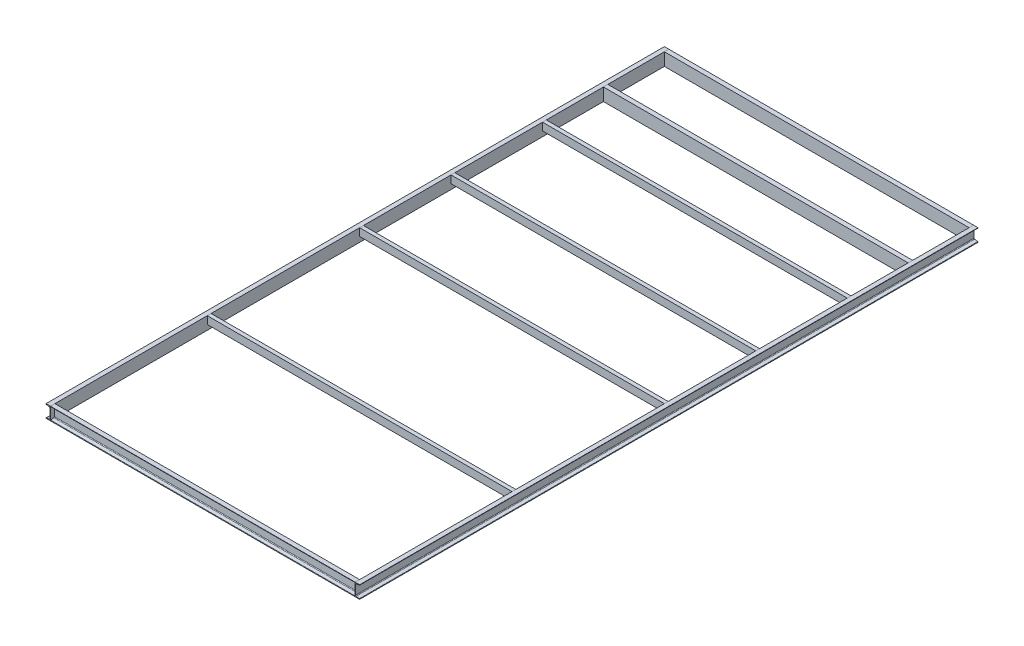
ISO-10303-21;
HEADER;
FILE_DESCRIPTION(('STEP AP214'),'2;1');
FILE_NAME('part.step','',(''),(''),'','','');
FILE_SCHEMA(('AUTOMOTIVE_DESIGN { 1 0 10303 214 1 1 1 1 }'));
ENDSEC;
DATA;
#1=APPLICATION_CONTEXT('core data for automotive mechanical design processes');
#2=APPLICATION_PROTOCOL_DEFINITION('international standard','automotive_design',2000,#1);
#3=PRODUCT_CONTEXT('',#1,'mechanical');
#4=PRODUCT('Part','Part','',(#3));
#5=PRODUCT_RELATED_PRODUCT_CATEGORY('part','',(#4));
#6=PRODUCT_DEFINITION_FORMATION('','',#4);
#7=PRODUCT_DEFINITION_CONTEXT('part definition',#1,'design');
#8=PRODUCT_DEFINITION('design','',#6,#7);
#9=PRODUCT_DEFINITION_SHAPE('','',#8);
#10=(LENGTH_UNIT() NAMED_UNIT(*) SI_UNIT(.MILLI.,.METRE.));
#11=(NAMED_UNIT(*) PLANE_ANGLE_UNIT() SI_UNIT($,.RADIAN.));
#12=(NAMED_UNIT(*) SI_UNIT($,.STERADIAN.) SOLID_ANGLE_UNIT());
#13=UNCERTAINTY_MEASURE_WITH_UNIT(LENGTH_MEASURE(1.E-05),#10,'distance_accuracy_value','');
#14=(GEOMETRIC_REPRESENTATION_CONTEXT(3) GLOBAL_UNCERTAINTY_ASSIGNED_CONTEXT((#13)) GLOBAL_UNIT_ASSIGNED_CONTEXT((#10,
#11,#12)) REPRESENTATION_CONTEXT('',''));
#15=CARTESIAN_POINT('',(0.,0.,0.));
#16=DIRECTION('',(0.,0.,1.));
#17=DIRECTION('',(1.,0.,0.));
#18=AXIS2_PLACEMENT_3D('',#15,#16,#17);
#19=CARTESIAN_POINT('',(3048.,-127.,-5486.4));
#20=DIRECTION('',(0.,1.,0.));
#21=DIRECTION('',(0.,0.,1.));
#22=AXIS2_PLACEMENT_3D('',#19,#20,#21);
#23=PLANE('',#22);
#24=DIRECTION('',(0.,0.,-1.));
#25=VECTOR('',#24,1.);
#26=CARTESIAN_POINT('',(0.,-127.,-5486.4));
#27=LINE('',#26,#25);
#28=CARTESIAN_POINT('',(0.,-127.,-5486.4));
#29=VERTEX_POINT('',#28);
#30=CARTESIAN_POINT('',(0.,-127.,-5530.85));
#31=VERTEX_POINT('',#30);
#32=EDGE_CURVE('E167',#29,#31,#27,.T.);
#33=ORIENTED_EDGE('',*,*,#32,.T.);
#34=DIRECTION('',(-1.,0.,0.));
#35=VECTOR('',#34,1.);
#36=CARTESIAN_POINT('',(3048.,-127.,-5530.85));
#37=LINE('',#36,#35);
#38=CARTESIAN_POINT('',(3048.,-127.,-5530.85));
#39=VERTEX_POINT('',#38);
#40=EDGE_CURVE('E12',#39,#31,#37,.T.);
#41=ORIENTED_EDGE('',*,*,#40,.F.);
#42=DIRECTION('',(0.,0.,-1.));
#43=VECTOR('',#42,1.);
#44=CARTESIAN_POINT('',(3048.,-127.,-5486.4));
#45=LINE('',#44,#43);
#46=CARTESIAN_POINT('',(3048.,-127.,-5486.4));
#47=VERTEX_POINT('',#46);
#48=EDGE_CURVE('E189',#47,#39,#45,.T.);
#49=ORIENTED_EDGE('',*,*,#48,.F.);
#50=DIRECTION('',(-1.,0.,0.));
#51=VECTOR('',#50,1.);
#52=CARTESIAN_POINT('',(3048.,-127.,-5486.4));
#53=LINE('',#52,#51);
#54=EDGE_CURVE('E163',#47,#29,#53,.T.);
#55=ORIENTED_EDGE('',*,*,#54,.T.);
#56=EDGE_LOOP('',(#33,#41,#49,#55));
#57=FACE_BOUND('',#56,.T.);
#58=ADVANCED_FACE('F47',(#57),#23,.F.);
#59=CARTESIAN_POINT('',(3048.,-127.,-5530.85));
#60=DIRECTION('',(0.,0.,1.));
#61=DIRECTION('',(1.,0.,0.));
#62=AXIS2_PLACEMENT_3D('',#59,#60,#61);
#63=PLANE('',#62);
#64=DIRECTION('',(0.,1.,0.));
#65=VECTOR('',#64,1.);
#66=CARTESIAN_POINT('',(0.,-127.,-5530.85));
#67=LINE('',#66,#65);
#68=CARTESIAN_POINT('',(0.,-124.54128,-5530.85));
#69=VERTEX_POINT('',#68);
#70=EDGE_CURVE('E170',#31,#69,#67,.T.);
#71=ORIENTED_EDGE('',*,*,#70,.T.);
#72=DIRECTION('',(-1.,0.,0.));
#73=VECTOR('',#72,1.);
#74=CARTESIAN_POINT('',(3048.,-124.54128,-5530.85));
#75=LINE('',#74,#73);
#76=CARTESIAN_POINT('',(3048.,-124.54128,-5530.85));
#77=VERTEX_POINT('',#76);
#78=EDGE_CURVE('E55',#77,#69,#75,.T.);
#79=ORIENTED_EDGE('',*,*,#78,.F.);
#80=DIRECTION('',(0.,1.,0.));
#81=VECTOR('',#80,1.);
#82=CARTESIAN_POINT('',(3048.,-127.,-5530.85));
#83=LINE('',#82,#81);
#84=EDGE_CURVE('E118',#39,#77,#83,.T.);
#85=ORIENTED_EDGE('',*,*,#84,.F.);
#86=ORIENTED_EDGE('',*,*,#40,.T.);
#87=EDGE_LOOP('',(#71,#79,#85,#86));
#88=FACE_BOUND('',#87,.T.);
#89=ADVANCED_FACE('F267',(#88),#63,.F.);
#90=CARTESIAN_POINT('',(3048.,-124.54128,-5528.056));
#91=DIRECTION('',(-1.,0.,0.));
#92=DIRECTION('',(0.,0.,1.));
#93=AXIS2_PLACEMENT_3D('',#90,#91,#92);
#94=CYLINDRICAL_SURFACE('',#93,2.79400000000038);
#95=CARTESIAN_POINT('',(0.,-124.54128,-5528.056));
#96=DIRECTION('',(1.,0.,0.));
#97=DIRECTION('',(0.,1.,0.));
#98=AXIS2_PLACEMENT_3D('',#95,#96,#97);
#99=CIRCLE('',#98,2.79400000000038);
#100=CARTESIAN_POINT('',(0.,-121.785300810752,-5528.51536337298));
#101=VERTEX_POINT('',#100);
#102=EDGE_CURVE('E172',#69,#101,#99,.T.);
#103=ORIENTED_EDGE('',*,*,#102,.T.);
#104=DIRECTION('',(-1.,0.,0.));
#105=VECTOR('',#104,1.);
#106=CARTESIAN_POINT('',(3048.,-121.785300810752,-5528.51536337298));
#107=LINE('',#106,#105);
#108=CARTESIAN_POINT('',(3048.,-121.785300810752,-5528.51536337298));
#109=VERTEX_POINT('',#108);
#110=EDGE_CURVE('E208',#109,#101,#107,.T.);
#111=ORIENTED_EDGE('',*,*,#110,.F.);
#112=CARTESIAN_POINT('',(3048.,-124.54128,-5528.056));
#113=DIRECTION('',(1.,0.,0.));
#114=DIRECTION('',(0.,1.,0.));
#115=AXIS2_PLACEMENT_3D('',#112,#113,#114);
#116=CIRCLE('',#115,2.79400000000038);
#117=EDGE_CURVE('E216',#77,#109,#116,.T.);
#118=ORIENTED_EDGE('',*,*,#117,.F.);
#119=ORIENTED_EDGE('',*,*,#78,.T.);
#120=EDGE_LOOP('',(#103,#111,#118,#119));
#121=FACE_BOUND('',#120,.T.);
#122=ADVANCED_FACE('F214',(#121),#94,.T.);
#123=CARTESIAN_POINT('',(3048.,-116.595853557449,-5497.38095110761));
#124=DIRECTION('',(0.,-0.986391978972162,0.164410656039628));
#125=DIRECTION('',(0.,-0.164410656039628,-0.986391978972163));
#126=AXIS2_PLACEMENT_3D('',#123,#124,#125);
#127=PLANE('',#126);
#128=DIRECTION('',(0.,0.164410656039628,0.986391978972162));
#129=VECTOR('',#128,1.);
#130=CARTESIAN_POINT('',(0.,-116.595853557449,-5497.38095110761));
#131=LINE('',#130,#129);
#132=CARTESIAN_POINT('',(0.,-116.595853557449,-5497.38095110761));
#133=VERTEX_POINT('',#132);
#134=EDGE_CURVE('E174',#101,#133,#131,.T.);
#135=ORIENTED_EDGE('',*,*,#134,.T.);
#136=DIRECTION('',(-1.,0.,0.));
#137=VECTOR('',#136,1.);
#138=CARTESIAN_POINT('',(3048.,-116.595853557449,-5497.38095110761));
#139=LINE('',#138,#137);
#140=CARTESIAN_POINT('',(3048.,-116.595853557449,-5497.38095110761));
#141=VERTEX_POINT('',#140);
#142=EDGE_CURVE('E205',#141,#133,#139,.T.);
#143=ORIENTED_EDGE('',*,*,#142,.F.);
#144=DIRECTION('',(0.,0.164410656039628,0.986391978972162));
#145=VECTOR('',#144,1.);
#146=CARTESIAN_POINT('',(3048.,-116.595853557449,-5497.38095110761));
#147=LINE('',#146,#145);
#148=EDGE_CURVE('E234',#109,#141,#147,.T.);
#149=ORIENTED_EDGE('',*,*,#148,.F.);
#150=ORIENTED_EDGE('',*,*,#110,.T.);
#151=EDGE_LOOP('',(#135,#143,#149,#150));
#152=FACE_BOUND('',#151,.T.);
#153=ADVANCED_FACE('F225',(#152),#127,.F.);
#154=CARTESIAN_POINT('',(3048.,-109.33009024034,-5498.592));
#155=DIRECTION('',(-1.,0.,0.));
#156=DIRECTION('',(0.,0.,1.));
#157=AXIS2_PLACEMENT_3D('',#154,#155,#156);
#158=CYLINDRICAL_SURFACE('',#157,7.36599999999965);
#159=CARTESIAN_POINT('',(0.,-109.33009024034,-5498.592));
#160=DIRECTION('',(-1.,0.,0.));
#161=DIRECTION('',(0.,1.,0.));
#162=AXIS2_PLACEMENT_3D('',#159,#160,#161);
#163=CIRCLE('',#162,7.36599999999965);
#164=CARTESIAN_POINT('',(0.,-109.33009024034,-5491.226));
#165=VERTEX_POINT('',#164);
#166=EDGE_CURVE('E176',#133,#165,#163,.T.);
#167=ORIENTED_EDGE('',*,*,#166,.T.);
#168=DIRECTION('',(-1.,0.,0.));
#169=VECTOR('',#168,1.);
#170=CARTESIAN_POINT('',(3048.,-109.33009024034,-5491.226));
#171=LINE('',#170,#169);
#172=CARTESIAN_POINT('',(3048.,-109.33009024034,-5491.226));
#173=VERTEX_POINT('',#172);
#174=EDGE_CURVE('E202',#173,#165,#171,.T.);
#175=ORIENTED_EDGE('',*,*,#174,.F.);
#176=CARTESIAN_POINT('',(3048.,-109.33009024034,-5498.592));
#177=DIRECTION('',(-1.,0.,0.));
#178=DIRECTION('',(0.,1.,0.));
#179=AXIS2_PLACEMENT_3D('',#176,#177,#178);
#180=CIRCLE('',#179,7.36599999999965);
#181=EDGE_CURVE('E231',#141,#173,#180,.T.);
#182=ORIENTED_EDGE('',*,*,#181,.F.);
#183=ORIENTED_EDGE('',*,*,#142,.T.);
#184=EDGE_LOOP('',(#167,#175,#182,#183));
#185=FACE_BOUND('',#184,.T.);
#186=ADVANCED_FACE('F229',(#185),#158,.F.);
#187=CARTESIAN_POINT('',(3048.,-17.6699097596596,-5491.226));
#188=DIRECTION('',(0.,0.,1.));
#189=DIRECTION('',(1.,0.,0.));
#190=AXIS2_PLACEMENT_3D('',#187,#188,#189);
#191=PLANE('',#190);
#192=DIRECTION('',(0.,1.,0.));
#193=VECTOR('',#192,1.);
#194=CARTESIAN_POINT('',(0.,-17.6699097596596,-5491.226));
#195=LINE('',#194,#193);
#196=CARTESIAN_POINT('',(0.,-17.6699097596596,-5491.226));
#197=VERTEX_POINT('',#196);
#198=EDGE_CURVE('E178',#165,#197,#195,.T.);
#199=ORIENTED_EDGE('',*,*,#198,.T.);
#200=DIRECTION('',(-1.,0.,0.));
#201=VECTOR('',#200,1.);
#202=CARTESIAN_POINT('',(3048.,-17.6699097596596,-5491.226));
#203=LINE('',#202,#201);
#204=CARTESIAN_POINT('',(3048.,-17.6699097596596,-5491.226));
#205=VERTEX_POINT('',#204);
#206=EDGE_CURVE('E199',#205,#197,#203,.T.);
#207=ORIENTED_EDGE('',*,*,#206,.F.);
#208=DIRECTION('',(0.,1.,0.));
#209=VECTOR('',#208,1.);
#210=CARTESIAN_POINT('',(3048.,-17.6699097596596,-5491.226));
#211=LINE('',#210,#209);
#212=EDGE_CURVE('E233',#173,#205,#211,.T.);
#213=ORIENTED_EDGE('',*,*,#212,.F.);
#214=ORIENTED_EDGE('',*,*,#174,.T.);
#215=EDGE_LOOP('',(#199,#207,#213,#214));
#216=FACE_BOUND('',#215,.T.);
#217=ADVANCED_FACE('F280',(#216),#191,.F.);
#218=CARTESIAN_POINT('',(3048.,-17.6699097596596,-5498.592));
#219=DIRECTION('',(-1.,0.,0.));
#220=DIRECTION('',(0.,0.,1.));
#221=AXIS2_PLACEMENT_3D('',#218,#219,#220);
#222=CYLINDRICAL_SURFACE('',#221,7.36599999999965);
#223=CARTESIAN_POINT('',(0.,-17.6699097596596,-5498.592));
#224=DIRECTION('',(-1.,0.,0.));
#225=DIRECTION('',(0.,-1.,0.));
#226=AXIS2_PLACEMENT_3D('',#223,#224,#225);
#227=CIRCLE('',#226,7.36599999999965);
#228=CARTESIAN_POINT('',(0.,-10.4041464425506,-5497.38095110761));
#229=VERTEX_POINT('',#228);
#230=EDGE_CURVE('E180',#197,#229,#227,.T.);
#231=ORIENTED_EDGE('',*,*,#230,.T.);
#232=DIRECTION('',(-1.,0.,0.));
#233=VECTOR('',#232,1.);
#234=CARTESIAN_POINT('',(3048.,-10.4041464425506,-5497.38095110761));
#235=LINE('',#234,#233);
#236=CARTESIAN_POINT('',(3048.,-10.4041464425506,-5497.38095110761));
#237=VERTEX_POINT('',#236);
#238=EDGE_CURVE('E196',#237,#229,#235,.T.);
#239=ORIENTED_EDGE('',*,*,#238,.F.);
#240=CARTESIAN_POINT('',(3048.,-17.6699097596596,-5498.592));
#241=DIRECTION('',(-1.,0.,0.));
#242=DIRECTION('',(0.,-1.,0.));
#243=AXIS2_PLACEMENT_3D('',#240,#241,#242);
#244=CIRCLE('',#243,7.36599999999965);
#245=EDGE_CURVE('E236',#205,#237,#244,.T.);
#246=ORIENTED_EDGE('',*,*,#245,.F.);
#247=ORIENTED_EDGE('',*,*,#206,.T.);
#248=EDGE_LOOP('',(#231,#239,#246,#247));
#249=FACE_BOUND('',#248,.T.);
#250=ADVANCED_FACE('F283',(#249),#222,.F.);
#251=CARTESIAN_POINT('',(3048.,-10.4041464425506,-5497.38095110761));
#252=DIRECTION('',(0.,0.986391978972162,0.164410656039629));
#253=DIRECTION('',(0.,-0.164410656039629,0.986391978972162));
#254=AXIS2_PLACEMENT_3D('',#251,#252,#253);
#255=PLANE('',#254);
#256=DIRECTION('',(0.,0.164410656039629,-0.986391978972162));
#257=VECTOR('',#256,1.);
#258=CARTESIAN_POINT('',(0.,-10.4041464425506,-5497.38095110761));
#259=LINE('',#258,#257);
#260=CARTESIAN_POINT('',(0.,-5.21469918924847,-5528.51536337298));
#261=VERTEX_POINT('',#260);
#262=EDGE_CURVE('E182',#229,#261,#259,.T.);
#263=ORIENTED_EDGE('',*,*,#262,.T.);
#264=DIRECTION('',(-1.,0.,0.));
#265=VECTOR('',#264,1.);
#266=CARTESIAN_POINT('',(3048.,-5.21469918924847,-5528.51536337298));
#267=LINE('',#266,#265);
#268=CARTESIAN_POINT('',(3048.,-5.21469918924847,-5528.51536337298));
#269=VERTEX_POINT('',#268);
#270=EDGE_CURVE('E193',#269,#261,#267,.T.);
#271=ORIENTED_EDGE('',*,*,#270,.F.);
#272=DIRECTION('',(0.,0.164410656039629,-0.986391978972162));
#273=VECTOR('',#272,1.);
#274=CARTESIAN_POINT('',(3048.,-10.4041464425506,-5497.38095110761));
#275=LINE('',#274,#273);
#276=EDGE_CURVE('E242',#237,#269,#275,.T.);
#277=ORIENTED_EDGE('',*,*,#276,.F.);
#278=ORIENTED_EDGE('',*,*,#238,.T.);
#279=EDGE_LOOP('',(#263,#271,#277,#278));
#280=FACE_BOUND('',#279,.T.);
#281=ADVANCED_FACE('F248',(#280),#255,.F.);
#282=CARTESIAN_POINT('',(3048.,-2.45872,-5528.056));
#283=DIRECTION('',(-1.,0.,0.));
#284=DIRECTION('',(0.,0.,1.));
#285=AXIS2_PLACEMENT_3D('',#282,#283,#284);
#286=CYLINDRICAL_SURFACE('',#285,2.79400000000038);
#287=CARTESIAN_POINT('',(0.,-2.45872,-5528.056));
#288=DIRECTION('',(1.,0.,0.));
#289=DIRECTION('',(0.,-1.,0.));
#290=AXIS2_PLACEMENT_3D('',#287,#288,#289);
#291=CIRCLE('',#290,2.79400000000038);
#292=CARTESIAN_POINT('',(0.,-2.45872,-5530.85));
#293=VERTEX_POINT('',#292);
#294=EDGE_CURVE('E184',#261,#293,#291,.T.);
#295=ORIENTED_EDGE('',*,*,#294,.T.);
#296=DIRECTION('',(-1.,0.,0.));
#297=VECTOR('',#296,1.);
#298=CARTESIAN_POINT('',(3048.,-2.45872,-5530.85));
#299=LINE('',#298,#297);
#300=CARTESIAN_POINT('',(3048.,-2.45872,-5530.85));
#301=VERTEX_POINT('',#300);
#302=EDGE_CURVE('E158',#301,#293,#299,.T.);
#303=ORIENTED_EDGE('',*,*,#302,.F.);
#304=CARTESIAN_POINT('',(3048.,-2.45872,-5528.056));
#305=DIRECTION('',(1.,0.,0.));
#306=DIRECTION('',(0.,-1.,0.));
#307=AXIS2_PLACEMENT_3D('',#304,#305,#306);
#308=CIRCLE('',#307,2.79400000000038);
#309=EDGE_CURVE('E149',#269,#301,#308,.T.);
#310=ORIENTED_EDGE('',*,*,#309,.F.);
#311=ORIENTED_EDGE('',*,*,#270,.T.);
#312=EDGE_LOOP('',(#295,#303,#310,#311));
#313=FACE_BOUND('',#312,.T.);
#314=ADVANCED_FACE('F252',(#313),#286,.T.);
#315=CARTESIAN_POINT('',(3048.,0.,-5530.85));
#316=DIRECTION('',(0.,0.,1.));
#317=DIRECTION('',(1.,0.,0.));
#318=AXIS2_PLACEMENT_3D('',#315,#316,#317);
#319=PLANE('',#318);
#320=DIRECTION('',(0.,1.,0.));
#321=VECTOR('',#320,1.);
#322=CARTESIAN_POINT('',(0.,0.,-5530.85));
#323=LINE('',#322,#321);
#324=CARTESIAN_POINT('',(0.,0.,-5530.85));
#325=VERTEX_POINT('',#324);
#326=EDGE_CURVE('E157',#293,#325,#323,.T.);
#327=ORIENTED_EDGE('',*,*,#326,.T.);
#328=DIRECTION('',(-1.,0.,0.));
#329=VECTOR('',#328,1.);
#330=CARTESIAN_POINT('',(3048.,0.,-5530.85));
#331=LINE('',#330,#329);
#332=CARTESIAN_POINT('',(3048.,0.,-5530.85));
#333=VERTEX_POINT('',#332);
#334=EDGE_CURVE('E154',#333,#325,#331,.T.);
#335=ORIENTED_EDGE('',*,*,#334,.F.);
#336=DIRECTION('',(0.,1.,0.));
#337=VECTOR('',#336,1.);
#338=CARTESIAN_POINT('',(3048.,0.,-5530.85));
#339=LINE('',#338,#337);
#340=EDGE_CURVE('E143',#301,#333,#339,.T.);
#341=ORIENTED_EDGE('',*,*,#340,.F.);
#342=ORIENTED_EDGE('',*,*,#302,.T.);
#343=EDGE_LOOP('',(#327,#335,#341,#342));
#344=FACE_BOUND('',#343,.T.);
#345=ADVANCED_FACE('F155',(#344),#319,.F.);
#346=CARTESIAN_POINT('',(3048.,0.,-5486.4));
#347=DIRECTION('',(0.,-1.,0.));
#348=DIRECTION('',(0.,0.,-1.));
#349=AXIS2_PLACEMENT_3D('',#346,#347,#348);
#350=PLANE('',#349);
#351=DIRECTION('',(0.,0.,1.));
#352=VECTOR('',#351,1.);
#353=CARTESIAN_POINT('',(0.,0.,-5486.4));
#354=LINE('',#353,#352);
#355=CARTESIAN_POINT('',(0.,0.,-5486.4));
#356=VERTEX_POINT('',#355);
#357=EDGE_CURVE('E104',#325,#356,#354,.T.);
#358=ORIENTED_EDGE('',*,*,#357,.T.);
#359=DIRECTION('',(-1.,0.,0.));
#360=VECTOR('',#359,1.);
#361=CARTESIAN_POINT('',(3048.,0.,-5486.4));
#362=LINE('',#361,#360);
#363=CARTESIAN_POINT('',(3048.,0.,-5486.4));
#364=VERTEX_POINT('',#363);
#365=EDGE_CURVE('E159',#364,#356,#362,.T.);
#366=ORIENTED_EDGE('',*,*,#365,.F.);
#367=DIRECTION('',(0.,0.,1.));
#368=VECTOR('',#367,1.);
#369=CARTESIAN_POINT('',(3048.,0.,-5486.4));
#370=LINE('',#369,#368);
#371=EDGE_CURVE('E147',#333,#364,#370,.T.);
#372=ORIENTED_EDGE('',*,*,#371,.F.);
#373=ORIENTED_EDGE('',*,*,#334,.T.);
#374=EDGE_LOOP('',(#358,#366,#372,#373));
#375=FACE_BOUND('',#374,.T.);
#376=ADVANCED_FACE('F161',(#375),#350,.F.);
#377=CARTESIAN_POINT('',(3048.,-127.,-5486.4));
#378=DIRECTION('',(0.,0.,-1.));
#379=DIRECTION('',(-1.,0.,0.));
#380=AXIS2_PLACEMENT_3D('',#377,#378,#379);
#381=PLANE('',#380);
#382=DIRECTION('',(0.,-1.,0.));
#383=VECTOR('',#382,1.);
#384=CARTESIAN_POINT('',(0.,-127.,-5486.4));
#385=LINE('',#384,#383);
#386=EDGE_CURVE('E110',#356,#29,#385,.T.);
#387=ORIENTED_EDGE('',*,*,#386,.T.);
#388=ORIENTED_EDGE('',*,*,#54,.F.);
#389=DIRECTION('',(0.,-1.,0.));
#390=VECTOR('',#389,1.);
#391=CARTESIAN_POINT('',(3048.,-127.,-5486.4));
#392=LINE('',#391,#390);
#393=EDGE_CURVE('E63',#364,#47,#392,.T.);
#394=ORIENTED_EDGE('',*,*,#393,.F.);
#395=ORIENTED_EDGE('',*,*,#365,.T.);
#396=EDGE_LOOP('',(#387,#388,#394,#395));
#397=FACE_BOUND('',#396,.T.);
#398=ADVANCED_FACE('F256',(#397),#381,.F.);
#399=CARTESIAN_POINT('',(3048.,-124.54128,-5528.056));
#400=DIRECTION('',(1.,0.,0.));
#401=DIRECTION('',(0.,1.,0.));
#402=AXIS2_PLACEMENT_3D('',#399,#400,#401);
#403=PLANE('',#402);
#404=ORIENTED_EDGE('',*,*,#48,.T.);
#405=ORIENTED_EDGE('',*,*,#84,.T.);
#406=ORIENTED_EDGE('',*,*,#117,.T.);
#407=ORIENTED_EDGE('',*,*,#148,.T.);
#408=ORIENTED_EDGE('',*,*,#181,.T.);
#409=ORIENTED_EDGE('',*,*,#212,.T.);
#410=ORIENTED_EDGE('',*,*,#245,.T.);
#411=ORIENTED_EDGE('',*,*,#276,.T.);
#412=ORIENTED_EDGE('',*,*,#309,.T.);
#413=ORIENTED_EDGE('',*,*,#340,.T.);
#414=ORIENTED_EDGE('',*,*,#371,.T.);
#415=ORIENTED_EDGE('',*,*,#393,.T.);
#416=EDGE_LOOP('',(#404,#405,#406,#407,#408,#409,#410,#411,#412,#413,#414,#415));
#417=FACE_BOUND('',#416,.T.);
#418=ADVANCED_FACE('F145',(#417),#403,.T.);
#419=CARTESIAN_POINT('',(0.,-124.54128,-5528.056));
#420=DIRECTION('',(1.,0.,0.));
#421=DIRECTION('',(0.,1.,0.));
#422=AXIS2_PLACEMENT_3D('',#419,#420,#421);
#423=PLANE('',#422);
#424=ORIENTED_EDGE('',*,*,#32,.F.);
#425=ORIENTED_EDGE('',*,*,#386,.F.);
#426=ORIENTED_EDGE('',*,*,#357,.F.);
#427=ORIENTED_EDGE('',*,*,#326,.F.);
#428=ORIENTED_EDGE('',*,*,#294,.F.);
#429=ORIENTED_EDGE('',*,*,#262,.F.);
#430=ORIENTED_EDGE('',*,*,#230,.F.);
#431=ORIENTED_EDGE('',*,*,#198,.F.);
#432=ORIENTED_EDGE('',*,*,#166,.F.);
#433=ORIENTED_EDGE('',*,*,#134,.F.);
#434=ORIENTED_EDGE('',*,*,#102,.F.);
#435=ORIENTED_EDGE('',*,*,#70,.F.);
#436=EDGE_LOOP('',(#424,#425,#426,#427,#428,#429,#430,#431,#432,#433,#434,#435));
#437=FACE_BOUND('',#436,.T.);
#438=ADVANCED_FACE('F220',(#437),#423,.F.);
#439=CLOSED_SHELL('',(#58,#89,#122,#153,#186,#217,#250,#281,#314,#345,#376,#398,#418,#438));
#440=MANIFOLD_SOLID_BREP('B2',#439);
#441=CARTESIAN_POINT('',(3048.,-76.2,-4876.8));
#442=DIRECTION('',(0.,1.,0.));
#443=DIRECTION('',(0.,0.,1.));
#444=AXIS2_PLACEMENT_3D('',#441,#442,#443);
#445=PLANE('',#444);
#446=DIRECTION('',(0.,0.,-1.));
#447=VECTOR('',#446,1.);
#448=CARTESIAN_POINT('',(0.,-76.2,-4876.8));
#449=LINE('',#448,#447);
#450=CARTESIAN_POINT('',(0.,-76.2,-4876.8));
#451=VERTEX_POINT('',#450);
#452=CARTESIAN_POINT('',(0.,-76.2,-4914.8492));
#453=VERTEX_POINT('',#452);
#454=EDGE_CURVE('E536',#451,#453,#449,.T.);
#455=ORIENTED_EDGE('',*,*,#454,.T.);
#456=DIRECTION('',(-1.,0.,0.));
#457=VECTOR('',#456,1.);
#458=CARTESIAN_POINT('',(3048.,-76.2,-4914.8492));
#459=LINE('',#458,#457);
#460=CARTESIAN_POINT('',(3048.,-76.2,-4914.8492));
#461=VERTEX_POINT('',#460);
#462=EDGE_CURVE('E45',#461,#453,#459,.T.);
#463=ORIENTED_EDGE('',*,*,#462,.F.);
#464=DIRECTION('',(0.,0.,-1.));
#465=VECTOR('',#464,1.);
#466=CARTESIAN_POINT('',(3048.,-76.2,-4876.8));
#467=LINE('',#466,#465);
#468=CARTESIAN_POINT('',(3048.,-76.2,-4876.8));
#469=VERTEX_POINT('',#468);
#470=EDGE_CURVE('E558',#469,#461,#467,.T.);
#471=ORIENTED_EDGE('',*,*,#470,.F.);
#472=DIRECTION('',(-1.,0.,0.));
#473=VECTOR('',#472,1.);
#474=CARTESIAN_POINT('',(3048.,-76.2,-4876.8));
#475=LINE('',#474,#473);
#476=EDGE_CURVE('E532',#469,#451,#475,.T.);
#477=ORIENTED_EDGE('',*,*,#476,.T.);
#478=EDGE_LOOP('',(#455,#463,#471,#477));
#479=FACE_BOUND('',#478,.T.);
#480=ADVANCED_FACE('F416',(#479),#445,.F.);
#481=CARTESIAN_POINT('',(3048.,-76.2,-4914.8492));
#482=DIRECTION('',(0.,0.,1.));
#483=DIRECTION('',(1.,0.,0.));
#484=AXIS2_PLACEMENT_3D('',#481,#482,#483);
#485=PLANE('',#484);
#486=DIRECTION('',(0.,1.,0.));
#487=VECTOR('',#486,1.);
#488=CARTESIAN_POINT('',(0.,-76.2,-4914.8492));
#489=LINE('',#488,#487);
#490=CARTESIAN_POINT('',(0.,-74.042335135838,-4914.8492));
#491=VERTEX_POINT('',#490);
#492=EDGE_CURVE('E539',#453,#491,#489,.T.);
#493=ORIENTED_EDGE('',*,*,#492,.T.);
#494=DIRECTION('',(-1.,0.,0.));
#495=VECTOR('',#494,1.);
#496=CARTESIAN_POINT('',(3048.,-74.042335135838,-4914.8492));
#497=LINE('',#496,#495);
#498=CARTESIAN_POINT('',(3048.,-74.042335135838,-4914.8492));
#499=VERTEX_POINT('',#498);
#500=EDGE_CURVE('E424',#499,#491,#497,.T.);
#501=ORIENTED_EDGE('',*,*,#500,.F.);
#502=DIRECTION('',(0.,1.,0.));
#503=VECTOR('',#502,1.);
#504=CARTESIAN_POINT('',(3048.,-76.2,-4914.8492));
#505=LINE('',#504,#503);
#506=EDGE_CURVE('E487',#461,#499,#505,.T.);
#507=ORIENTED_EDGE('',*,*,#506,.F.);
#508=ORIENTED_EDGE('',*,*,#462,.T.);
#509=EDGE_LOOP('',(#493,#501,#507,#508));
#510=FACE_BOUND('',#509,.T.);
#511=ADVANCED_FACE('F636',(#510),#485,.F.);
#512=CARTESIAN_POINT('',(3048.,-74.042335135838,-4912.3092));
#513=DIRECTION('',(-1.,0.,0.));
#514=DIRECTION('',(0.,0.,1.));
#515=AXIS2_PLACEMENT_3D('',#512,#513,#514);
#516=CYLINDRICAL_SURFACE('',#515,2.54000000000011);
#517=CARTESIAN_POINT('',(0.,-74.042335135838,-4912.3092));
#518=DIRECTION('',(1.,0.,0.));
#519=DIRECTION('',(0.,1.,0.));
#520=AXIS2_PLACEMENT_3D('',#517,#518,#519);
#521=CIRCLE('',#520,2.54000000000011);
#522=CARTESIAN_POINT('',(0.,-71.5368995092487,-4912.72680306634));
#523=VERTEX_POINT('',#522);
#524=EDGE_CURVE('E541',#491,#523,#521,.T.);
#525=ORIENTED_EDGE('',*,*,#524,.T.);
#526=DIRECTION('',(-1.,0.,0.));
#527=VECTOR('',#526,1.);
#528=CARTESIAN_POINT('',(3048.,-71.5368995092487,-4912.72680306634));
#529=LINE('',#528,#527);
#530=CARTESIAN_POINT('',(3048.,-71.5368995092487,-4912.72680306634));
#531=VERTEX_POINT('',#530);
#532=EDGE_CURVE('E577',#531,#523,#529,.T.);
#533=ORIENTED_EDGE('',*,*,#532,.F.);
#534=CARTESIAN_POINT('',(3048.,-74.042335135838,-4912.3092));
#535=DIRECTION('',(1.,0.,0.));
#536=DIRECTION('',(0.,1.,0.));
#537=AXIS2_PLACEMENT_3D('',#534,#535,#536);
#538=CIRCLE('',#537,2.54000000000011);
#539=EDGE_CURVE('E585',#499,#531,#538,.T.);
#540=ORIENTED_EDGE('',*,*,#539,.F.);
#541=ORIENTED_EDGE('',*,*,#500,.T.);
#542=EDGE_LOOP('',(#525,#533,#540,#541));
#543=FACE_BOUND('',#542,.T.);
#544=ADVANCED_FACE('F583',(#543),#516,.T.);
#545=CARTESIAN_POINT('',(3048.,-67.5960901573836,-4889.08367172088));
#546=DIRECTION('',(0.,-0.986391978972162,0.16441065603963));
#547=DIRECTION('',(0.,-0.16441065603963,-0.986391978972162));
#548=AXIS2_PLACEMENT_3D('',#545,#546,#547);
#549=PLANE('',#548);
#550=DIRECTION('',(0.,0.16441065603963,0.986391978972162));
#551=VECTOR('',#550,1.);
#552=CARTESIAN_POINT('',(0.,-67.5960901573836,-4889.08367172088));
#553=LINE('',#552,#551);
#554=CARTESIAN_POINT('',(0.,-67.5960901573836,-4889.08367172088));
#555=VERTEX_POINT('',#554);
#556=EDGE_CURVE('E543',#523,#555,#553,.T.);
#557=ORIENTED_EDGE('',*,*,#556,.T.);
#558=DIRECTION('',(-1.,0.,0.));
#559=VECTOR('',#558,1.);
#560=CARTESIAN_POINT('',(3048.,-67.5960901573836,-4889.08367172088));
#561=LINE('',#560,#559);
#562=CARTESIAN_POINT('',(3048.,-67.5960901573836,-4889.08367172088));
#563=VERTEX_POINT('',#562);
#564=EDGE_CURVE('E574',#563,#555,#561,.T.);
#565=ORIENTED_EDGE('',*,*,#564,.F.);
#566=DIRECTION('',(0.,0.16441065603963,0.986391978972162));
#567=VECTOR('',#566,1.);
#568=CARTESIAN_POINT('',(3048.,-67.5960901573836,-4889.08367172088));
#569=LINE('',#568,#567);
#570=EDGE_CURVE('E603',#531,#563,#569,.T.);
#571=ORIENTED_EDGE('',*,*,#570,.F.);
#572=ORIENTED_EDGE('',*,*,#532,.T.);
#573=EDGE_LOOP('',(#557,#565,#571,#572));
#574=FACE_BOUND('',#573,.T.);
#575=ADVANCED_FACE('F594',(#574),#549,.F.);
#576=CARTESIAN_POINT('',(3048.,-60.8314139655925,-4890.2112));
#577=DIRECTION('',(-1.,0.,0.));
#578=DIRECTION('',(0.,0.,1.));
#579=AXIS2_PLACEMENT_3D('',#576,#577,#578);
#580=CYLINDRICAL_SURFACE('',#579,6.85800000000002);
#581=CARTESIAN_POINT('',(0.,-60.8314139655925,-4890.2112));
#582=DIRECTION('',(-1.,0.,0.));
#583=DIRECTION('',(0.,1.,0.));
#584=AXIS2_PLACEMENT_3D('',#581,#582,#583);
#585=CIRCLE('',#584,6.85800000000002);
#586=CARTESIAN_POINT('',(0.,-60.8314139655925,-4883.3532));
#587=VERTEX_POINT('',#586);
#588=EDGE_CURVE('E545',#555,#587,#585,.T.);
#589=ORIENTED_EDGE('',*,*,#588,.T.);
#590=DIRECTION('',(-1.,0.,0.));
#591=VECTOR('',#590,1.);
#592=CARTESIAN_POINT('',(3048.,-60.8314139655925,-4883.3532));
#593=LINE('',#592,#591);
#594=CARTESIAN_POINT('',(3048.,-60.8314139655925,-4883.3532));
#595=VERTEX_POINT('',#594);
#596=EDGE_CURVE('E571',#595,#587,#593,.T.);
#597=ORIENTED_EDGE('',*,*,#596,.F.);
#598=CARTESIAN_POINT('',(3048.,-60.8314139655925,-4890.2112));
#599=DIRECTION('',(-1.,0.,0.));
#600=DIRECTION('',(0.,1.,0.));
#601=AXIS2_PLACEMENT_3D('',#598,#599,#600);
#602=CIRCLE('',#601,6.85800000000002);
#603=EDGE_CURVE('E600',#563,#595,#602,.T.);
#604=ORIENTED_EDGE('',*,*,#603,.F.);
#605=ORIENTED_EDGE('',*,*,#564,.T.);
#606=EDGE_LOOP('',(#589,#597,#604,#605));
#607=FACE_BOUND('',#606,.T.);
#608=ADVANCED_FACE('F598',(#607),#580,.F.);
#609=CARTESIAN_POINT('',(3048.,-15.3685860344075,-4883.3532));
#610=DIRECTION('',(0.,0.,1.));
#611=DIRECTION('',(1.,0.,0.));
#612=AXIS2_PLACEMENT_3D('',#609,#610,#611);
#613=PLANE('',#612);
#614=DIRECTION('',(0.,1.,0.));
#615=VECTOR('',#614,1.);
#616=CARTESIAN_POINT('',(0.,-15.3685860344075,-4883.3532));
#617=LINE('',#616,#615);
#618=CARTESIAN_POINT('',(0.,-15.3685860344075,-4883.3532));
#619=VERTEX_POINT('',#618);
#620=EDGE_CURVE('E547',#587,#619,#617,.T.);
#621=ORIENTED_EDGE('',*,*,#620,.T.);
#622=DIRECTION('',(-1.,0.,0.));
#623=VECTOR('',#622,1.);
#624=CARTESIAN_POINT('',(3048.,-15.3685860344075,-4883.3532));
#625=LINE('',#624,#623);
#626=CARTESIAN_POINT('',(3048.,-15.3685860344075,-4883.3532));
#627=VERTEX_POINT('',#626);
#628=EDGE_CURVE('E568',#627,#619,#625,.T.);
#629=ORIENTED_EDGE('',*,*,#628,.F.);
#630=DIRECTION('',(0.,1.,0.));
#631=VECTOR('',#630,1.);
#632=CARTESIAN_POINT('',(3048.,-15.3685860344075,-4883.3532));
#633=LINE('',#632,#631);
#634=EDGE_CURVE('E602',#595,#627,#633,.T.);
#635=ORIENTED_EDGE('',*,*,#634,.F.);
#636=ORIENTED_EDGE('',*,*,#596,.T.);
#637=EDGE_LOOP('',(#621,#629,#635,#636));
#638=FACE_BOUND('',#637,.T.);
#639=ADVANCED_FACE('F649',(#638),#613,.F.);
#640=CARTESIAN_POINT('',(3048.,-15.3685860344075,-4890.2112));
#641=DIRECTION('',(-1.,0.,0.));
#642=DIRECTION('',(0.,0.,1.));
#643=AXIS2_PLACEMENT_3D('',#640,#641,#642);
#644=CYLINDRICAL_SURFACE('',#643,6.85800000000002);
#645=CARTESIAN_POINT('',(0.,-15.3685860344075,-4890.2112));
#646=DIRECTION('',(-1.,0.,0.));
#647=DIRECTION('',(0.,-1.,0.));
#648=AXIS2_PLACEMENT_3D('',#645,#646,#647);
#649=CIRCLE('',#648,6.85800000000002);
#650=CARTESIAN_POINT('',(0.,-8.60390984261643,-4889.08367172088));
#651=VERTEX_POINT('',#650);
#652=EDGE_CURVE('E549',#619,#651,#649,.T.);
#653=ORIENTED_EDGE('',*,*,#652,.T.);
#654=DIRECTION('',(-1.,0.,0.));
#655=VECTOR('',#654,1.);
#656=CARTESIAN_POINT('',(3048.,-8.60390984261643,-4889.08367172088));
#657=LINE('',#656,#655);
#658=CARTESIAN_POINT('',(3048.,-8.60390984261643,-4889.08367172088));
#659=VERTEX_POINT('',#658);
#660=EDGE_CURVE('E565',#659,#651,#657,.T.);
#661=ORIENTED_EDGE('',*,*,#660,.F.);
#662=CARTESIAN_POINT('',(3048.,-15.3685860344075,-4890.2112));
#663=DIRECTION('',(-1.,0.,0.));
#664=DIRECTION('',(0.,-1.,0.));
#665=AXIS2_PLACEMENT_3D('',#662,#663,#664);
#666=CIRCLE('',#665,6.85800000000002);
#667=EDGE_CURVE('E605',#627,#659,#666,.T.);
#668=ORIENTED_EDGE('',*,*,#667,.F.);
#669=ORIENTED_EDGE('',*,*,#628,.T.);
#670=EDGE_LOOP('',(#653,#661,#668,#669));
#671=FACE_BOUND('',#670,.T.);
#672=ADVANCED_FACE('F652',(#671),#644,.F.);
#673=CARTESIAN_POINT('',(3048.,-8.60390984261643,-4889.08367172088));
#674=DIRECTION('',(0.,0.986391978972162,0.16441065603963));
#675=DIRECTION('',(0.,-0.16441065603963,0.986391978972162));
#676=AXIS2_PLACEMENT_3D('',#673,#674,#675);
#677=PLANE('',#676);
#678=DIRECTION('',(0.,0.16441065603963,-0.986391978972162));
#679=VECTOR('',#678,1.);
#680=CARTESIAN_POINT('',(0.,-8.60390984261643,-4889.08367172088));
#681=LINE('',#680,#679);
#682=CARTESIAN_POINT('',(0.,-4.66310049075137,-4912.72680306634));
#683=VERTEX_POINT('',#682);
#684=EDGE_CURVE('E551',#651,#683,#681,.T.);
#685=ORIENTED_EDGE('',*,*,#684,.T.);
#686=DIRECTION('',(-1.,0.,0.));
#687=VECTOR('',#686,1.);
#688=CARTESIAN_POINT('',(3048.,-4.66310049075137,-4912.72680306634));
#689=LINE('',#688,#687);
#690=CARTESIAN_POINT('',(3048.,-4.66310049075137,-4912.72680306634));
#691=VERTEX_POINT('',#690);
#692=EDGE_CURVE('E562',#691,#683,#689,.T.);
#693=ORIENTED_EDGE('',*,*,#692,.F.);
#694=DIRECTION('',(0.,0.16441065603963,-0.986391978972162));
#695=VECTOR('',#694,1.);
#696=CARTESIAN_POINT('',(3048.,-8.60390984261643,-4889.08367172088));
#697=LINE('',#696,#695);
#698=EDGE_CURVE('E611',#659,#691,#697,.T.);
#699=ORIENTED_EDGE('',*,*,#698,.F.);
#700=ORIENTED_EDGE('',*,*,#660,.T.);
#701=EDGE_LOOP('',(#685,#693,#699,#700));
#702=FACE_BOUND('',#701,.T.);
#703=ADVANCED_FACE('F617',(#702),#677,.F.);
#704=CARTESIAN_POINT('',(3048.,-2.15766486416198,-4912.3092));
#705=DIRECTION('',(-1.,0.,0.));
#706=DIRECTION('',(0.,0.,1.));
#707=AXIS2_PLACEMENT_3D('',#704,#705,#706);
#708=CYLINDRICAL_SURFACE('',#707,2.54000000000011);
#709=CARTESIAN_POINT('',(0.,-2.15766486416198,-4912.3092));
#710=DIRECTION('',(1.,0.,0.));
#711=DIRECTION('',(0.,-1.,0.));
#712=AXIS2_PLACEMENT_3D('',#709,#710,#711);
#713=CIRCLE('',#712,2.54000000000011);
#714=CARTESIAN_POINT('',(0.,-2.15766486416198,-4914.8492));
#715=VERTEX_POINT('',#714);
#716=EDGE_CURVE('E553',#683,#715,#713,.T.);
#717=ORIENTED_EDGE('',*,*,#716,.T.);
#718=DIRECTION('',(-1.,0.,0.));
#719=VECTOR('',#718,1.);
#720=CARTESIAN_POINT('',(3048.,-2.15766486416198,-4914.8492));
#721=LINE('',#720,#719);
#722=CARTESIAN_POINT('',(3048.,-2.15766486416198,-4914.8492));
#723=VERTEX_POINT('',#722);
#724=EDGE_CURVE('E527',#723,#715,#721,.T.);
#725=ORIENTED_EDGE('',*,*,#724,.F.);
#726=CARTESIAN_POINT('',(3048.,-2.15766486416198,-4912.3092));
#727=DIRECTION('',(1.,0.,0.));
#728=DIRECTION('',(0.,-1.,0.));
#729=AXIS2_PLACEMENT_3D('',#726,#727,#728);
#730=CIRCLE('',#729,2.54000000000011);
#731=EDGE_CURVE('E518',#691,#723,#730,.T.);
#732=ORIENTED_EDGE('',*,*,#731,.F.);
#733=ORIENTED_EDGE('',*,*,#692,.T.);
#734=EDGE_LOOP('',(#717,#725,#732,#733));
#735=FACE_BOUND('',#734,.T.);
#736=ADVANCED_FACE('F621',(#735),#708,.T.);
#737=CARTESIAN_POINT('',(3048.,0.,-4914.8492));
#738=DIRECTION('',(0.,0.,1.));
#739=DIRECTION('',(1.,0.,0.));
#740=AXIS2_PLACEMENT_3D('',#737,#738,#739);
#741=PLANE('',#740);
#742=DIRECTION('',(0.,1.,0.));
#743=VECTOR('',#742,1.);
#744=CARTESIAN_POINT('',(0.,0.,-4914.8492));
#745=LINE('',#744,#743);
#746=CARTESIAN_POINT('',(0.,0.,-4914.8492));
#747=VERTEX_POINT('',#746);
#748=EDGE_CURVE('E526',#715,#747,#745,.T.);
#749=ORIENTED_EDGE('',*,*,#748,.T.);
#750=DIRECTION('',(-1.,0.,0.));
#751=VECTOR('',#750,1.);
#752=CARTESIAN_POINT('',(3048.,0.,-4914.8492));
#753=LINE('',#752,#751);
#754=CARTESIAN_POINT('',(3048.,0.,-4914.8492));
#755=VERTEX_POINT('',#754);
#756=EDGE_CURVE('E523',#755,#747,#753,.T.);
#757=ORIENTED_EDGE('',*,*,#756,.F.);
#758=DIRECTION('',(0.,1.,0.));
#759=VECTOR('',#758,1.);
#760=CARTESIAN_POINT('',(3048.,0.,-4914.8492));
#761=LINE('',#760,#759);
#762=EDGE_CURVE('E512',#723,#755,#761,.T.);
#763=ORIENTED_EDGE('',*,*,#762,.F.);
#764=ORIENTED_EDGE('',*,*,#724,.T.);
#765=EDGE_LOOP('',(#749,#757,#763,#764));
#766=FACE_BOUND('',#765,.T.);
#767=ADVANCED_FACE('F524',(#766),#741,.F.);
#768=CARTESIAN_POINT('',(3048.,0.,-4876.8));
#769=DIRECTION('',(0.,-1.,0.));
#770=DIRECTION('',(0.,0.,-1.));
#771=AXIS2_PLACEMENT_3D('',#768,#769,#770);
#772=PLANE('',#771);
#773=DIRECTION('',(0.,0.,1.));
#774=VECTOR('',#773,1.);
#775=CARTESIAN_POINT('',(0.,0.,-4876.8));
#776=LINE('',#775,#774);
#777=CARTESIAN_POINT('',(0.,0.,-4876.8));
#778=VERTEX_POINT('',#777);
#779=EDGE_CURVE('E473',#747,#778,#776,.T.);
#780=ORIENTED_EDGE('',*,*,#779,.T.);
#781=DIRECTION('',(-1.,0.,0.));
#782=VECTOR('',#781,1.);
#783=CARTESIAN_POINT('',(3048.,0.,-4876.8));
#784=LINE('',#783,#782);
#785=CARTESIAN_POINT('',(3048.,0.,-4876.8));
#786=VERTEX_POINT('',#785);
#787=EDGE_CURVE('E528',#786,#778,#784,.T.);
#788=ORIENTED_EDGE('',*,*,#787,.F.);
#789=DIRECTION('',(0.,0.,1.));
#790=VECTOR('',#789,1.);
#791=CARTESIAN_POINT('',(3048.,0.,-4876.8));
#792=LINE('',#791,#790);
#793=EDGE_CURVE('E516',#755,#786,#792,.T.);
#794=ORIENTED_EDGE('',*,*,#793,.F.);
#795=ORIENTED_EDGE('',*,*,#756,.T.);
#796=EDGE_LOOP('',(#780,#788,#794,#795));
#797=FACE_BOUND('',#796,.T.);
#798=ADVANCED_FACE('F530',(#797),#772,.F.);
#799=CARTESIAN_POINT('',(3048.,-76.2,-4876.8));
#800=DIRECTION('',(0.,0.,-1.));
#801=DIRECTION('',(-1.,0.,0.));
#802=AXIS2_PLACEMENT_3D('',#799,#800,#801);
#803=PLANE('',#802);
#804=DIRECTION('',(0.,-1.,0.));
#805=VECTOR('',#804,1.);
#806=CARTESIAN_POINT('',(0.,-76.2,-4876.8));
#807=LINE('',#806,#805);
#808=EDGE_CURVE('E479',#778,#451,#807,.T.);
#809=ORIENTED_EDGE('',*,*,#808,.T.);
#810=ORIENTED_EDGE('',*,*,#476,.F.);
#811=DIRECTION('',(0.,-1.,0.));
#812=VECTOR('',#811,1.);
#813=CARTESIAN_POINT('',(3048.,-76.2,-4876.8));
#814=LINE('',#813,#812);
#815=EDGE_CURVE('E432',#786,#469,#814,.T.);
#816=ORIENTED_EDGE('',*,*,#815,.F.);
#817=ORIENTED_EDGE('',*,*,#787,.T.);
#818=EDGE_LOOP('',(#809,#810,#816,#817));
#819=FACE_BOUND('',#818,.T.);
#820=ADVANCED_FACE('F625',(#819),#803,.F.);
#821=CARTESIAN_POINT('',(3048.,-74.042335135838,-4912.3092));
#822=DIRECTION('',(1.,0.,0.));
#823=DIRECTION('',(0.,1.,0.));
#824=AXIS2_PLACEMENT_3D('',#821,#822,#823);
#825=PLANE('',#824);
#826=ORIENTED_EDGE('',*,*,#470,.T.);
#827=ORIENTED_EDGE('',*,*,#506,.T.);
#828=ORIENTED_EDGE('',*,*,#539,.T.);
#829=ORIENTED_EDGE('',*,*,#570,.T.);
#830=ORIENTED_EDGE('',*,*,#603,.T.);
#831=ORIENTED_EDGE('',*,*,#634,.T.);
#832=ORIENTED_EDGE('',*,*,#667,.T.);
#833=ORIENTED_EDGE('',*,*,#698,.T.);
#834=ORIENTED_EDGE('',*,*,#731,.T.);
#835=ORIENTED_EDGE('',*,*,#762,.T.);
#836=ORIENTED_EDGE('',*,*,#793,.T.);
#837=ORIENTED_EDGE('',*,*,#815,.T.);
#838=EDGE_LOOP('',(#826,#827,#828,#829,#830,#831,#832,#833,#834,#835,#836,#837));
#839=FACE_BOUND('',#838,.T.);
#840=ADVANCED_FACE('F514',(#839),#825,.T.);
#841=CARTESIAN_POINT('',(0.,-74.042335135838,-4912.3092));
#842=DIRECTION('',(1.,0.,0.));
#843=DIRECTION('',(0.,1.,0.));
#844=AXIS2_PLACEMENT_3D('',#841,#842,#843);
#845=PLANE('',#844);
#846=ORIENTED_EDGE('',*,*,#454,.F.);
#847=ORIENTED_EDGE('',*,*,#808,.F.);
#848=ORIENTED_EDGE('',*,*,#779,.F.);
#849=ORIENTED_EDGE('',*,*,#748,.F.);
#850=ORIENTED_EDGE('',*,*,#716,.F.);
#851=ORIENTED_EDGE('',*,*,#684,.F.);
#852=ORIENTED_EDGE('',*,*,#652,.F.);
#853=ORIENTED_EDGE('',*,*,#620,.F.);
#854=ORIENTED_EDGE('',*,*,#588,.F.);
#855=ORIENTED_EDGE('',*,*,#556,.F.);
#856=ORIENTED_EDGE('',*,*,#524,.F.);
#857=ORIENTED_EDGE('',*,*,#492,.F.);
#858=EDGE_LOOP('',(#846,#847,#848,#849,#850,#851,#852,#853,#854,#855,#856,#857));
#859=FACE_BOUND('',#858,.T.);
#860=ADVANCED_FACE('F589',(#859),#845,.F.);
#861=CLOSED_SHELL('',(#480,#511,#544,#575,#608,#639,#672,#703,#736,#767,#798,#820,#840,#860));
#862=MANIFOLD_SOLID_BREP('B6',#861);
#863=CARTESIAN_POINT('',(3048.,-76.2,-3962.4));
#864=DIRECTION('',(0.,1.,0.));
#865=DIRECTION('',(0.,0.,1.));
#866=AXIS2_PLACEMENT_3D('',#863,#864,#865);
#867=PLANE('',#866);
#868=DIRECTION('',(0.,0.,-1.));
#869=VECTOR('',#868,1.);
#870=CARTESIAN_POINT('',(0.,-76.2,-3962.4));
#871=LINE('',#870,#869);
#872=CARTESIAN_POINT('',(0.,-76.2,-3962.4));
#873=VERTEX_POINT('',#872);
#874=CARTESIAN_POINT('',(0.,-76.2,-4000.4492));
#875=VERTEX_POINT('',#874);
#876=EDGE_CURVE('E905',#873,#875,#871,.T.);
#877=ORIENTED_EDGE('',*,*,#876,.T.);
#878=DIRECTION('',(-1.,0.,0.));
#879=VECTOR('',#878,1.);
#880=CARTESIAN_POINT('',(3048.,-76.2,-4000.4492));
#881=LINE('',#880,#879);
#882=CARTESIAN_POINT('',(3048.,-76.2,-4000.4492));
#883=VERTEX_POINT('',#882);
#884=EDGE_CURVE('E414',#883,#875,#881,.T.);
#885=ORIENTED_EDGE('',*,*,#884,.F.);
#886=DIRECTION('',(0.,0.,-1.));
#887=VECTOR('',#886,1.);
#888=CARTESIAN_POINT('',(3048.,-76.2,-3962.4));
#889=LINE('',#888,#887);
#890=CARTESIAN_POINT('',(3048.,-76.2,-3962.4));
#891=VERTEX_POINT('',#890);
#892=EDGE_CURVE('E927',#891,#883,#889,.T.);
#893=ORIENTED_EDGE('',*,*,#892,.F.);
#894=DIRECTION('',(-1.,0.,0.));
#895=VECTOR('',#894,1.);
#896=CARTESIAN_POINT('',(3048.,-76.2,-3962.4));
#897=LINE('',#896,#895);
#898=EDGE_CURVE('E901',#891,#873,#897,.T.);
#899=ORIENTED_EDGE('',*,*,#898,.T.);
#900=EDGE_LOOP('',(#877,#885,#893,#899));
#901=FACE_BOUND('',#900,.T.);
#902=ADVANCED_FACE('F785',(#901),#867,.F.);
#903=CARTESIAN_POINT('',(3048.,-76.2,-4000.4492));
#904=DIRECTION('',(0.,0.,1.));
#905=DIRECTION('',(1.,0.,0.));
#906=AXIS2_PLACEMENT_3D('',#903,#904,#905);
#907=PLANE('',#906);
#908=DIRECTION('',(0.,1.,0.));
#909=VECTOR('',#908,1.);
#910=CARTESIAN_POINT('',(0.,-76.2,-4000.4492));
#911=LINE('',#910,#909);
#912=CARTESIAN_POINT('',(0.,-74.042335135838,-4000.4492));
#913=VERTEX_POINT('',#912);
#914=EDGE_CURVE('E908',#875,#913,#911,.T.);
#915=ORIENTED_EDGE('',*,*,#914,.T.);
#916=DIRECTION('',(-1.,0.,0.));
#917=VECTOR('',#916,1.);
#918=CARTESIAN_POINT('',(3048.,-74.042335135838,-4000.4492));
#919=LINE('',#918,#917);
#920=CARTESIAN_POINT('',(3048.,-74.042335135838,-4000.4492));
#921=VERTEX_POINT('',#920);
#922=EDGE_CURVE('E793',#921,#913,#919,.T.);
#923=ORIENTED_EDGE('',*,*,#922,.F.);
#924=DIRECTION('',(0.,1.,0.));
#925=VECTOR('',#924,1.);
#926=CARTESIAN_POINT('',(3048.,-76.2,-4000.4492));
#927=LINE('',#926,#925);
#928=EDGE_CURVE('E856',#883,#921,#927,.T.);
#929=ORIENTED_EDGE('',*,*,#928,.F.);
#930=ORIENTED_EDGE('',*,*,#884,.T.);
#931=EDGE_LOOP('',(#915,#923,#929,#930));
#932=FACE_BOUND('',#931,.T.);
#933=ADVANCED_FACE('F1005',(#932),#907,.F.);
#934=CARTESIAN_POINT('',(3048.,-74.042335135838,-3997.9092));
#935=DIRECTION('',(-1.,0.,0.));
#936=DIRECTION('',(0.,0.,1.));
#937=AXIS2_PLACEMENT_3D('',#934,#935,#936);
#938=CYLINDRICAL_SURFACE('',#937,2.54000000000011);
#939=CARTESIAN_POINT('',(0.,-74.042335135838,-3997.9092));
#940=DIRECTION('',(1.,0.,0.));
#941=DIRECTION('',(0.,1.,0.));
#942=AXIS2_PLACEMENT_3D('',#939,#940,#941);
#943=CIRCLE('',#942,2.54000000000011);
#944=CARTESIAN_POINT('',(0.,-71.5368995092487,-3998.32680306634));
#945=VERTEX_POINT('',#944);
#946=EDGE_CURVE('E910',#913,#945,#943,.T.);
#947=ORIENTED_EDGE('',*,*,#946,.T.);
#948=DIRECTION('',(-1.,0.,0.));
#949=VECTOR('',#948,1.);
#950=CARTESIAN_POINT('',(3048.,-71.5368995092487,-3998.32680306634));
#951=LINE('',#950,#949);
#952=CARTESIAN_POINT('',(3048.,-71.5368995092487,-3998.32680306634));
#953=VERTEX_POINT('',#952);
#954=EDGE_CURVE('E946',#953,#945,#951,.T.);
#955=ORIENTED_EDGE('',*,*,#954,.F.);
#956=CARTESIAN_POINT('',(3048.,-74.042335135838,-3997.9092));
#957=DIRECTION('',(1.,0.,0.));
#958=DIRECTION('',(0.,1.,0.));
#959=AXIS2_PLACEMENT_3D('',#956,#957,#958);
#960=CIRCLE('',#959,2.54000000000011);
#961=EDGE_CURVE('E954',#921,#953,#960,.T.);
#962=ORIENTED_EDGE('',*,*,#961,.F.);
#963=ORIENTED_EDGE('',*,*,#922,.T.);
#964=EDGE_LOOP('',(#947,#955,#962,#963));
#965=FACE_BOUND('',#964,.T.);
#966=ADVANCED_FACE('F952',(#965),#938,.T.);
#967=CARTESIAN_POINT('',(3048.,-67.5960901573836,-3974.68367172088));
#968=DIRECTION('',(0.,-0.986391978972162,0.16441065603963));
#969=DIRECTION('',(0.,-0.16441065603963,-0.986391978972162));
#970=AXIS2_PLACEMENT_3D('',#967,#968,#969);
#971=PLANE('',#970);
#972=DIRECTION('',(0.,0.16441065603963,0.986391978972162));
#973=VECTOR('',#972,1.);
#974=CARTESIAN_POINT('',(0.,-67.5960901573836,-3974.68367172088));
#975=LINE('',#974,#973);
#976=CARTESIAN_POINT('',(0.,-67.5960901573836,-3974.68367172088));
#977=VERTEX_POINT('',#976);
#978=EDGE_CURVE('E912',#945,#977,#975,.T.);
#979=ORIENTED_EDGE('',*,*,#978,.T.);
#980=DIRECTION('',(-1.,0.,0.));
#981=VECTOR('',#980,1.);
#982=CARTESIAN_POINT('',(3048.,-67.5960901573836,-3974.68367172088));
#983=LINE('',#982,#981);
#984=CARTESIAN_POINT('',(3048.,-67.5960901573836,-3974.68367172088));
#985=VERTEX_POINT('',#984);
#986=EDGE_CURVE('E943',#985,#977,#983,.T.);
#987=ORIENTED_EDGE('',*,*,#986,.F.);
#988=DIRECTION('',(0.,0.16441065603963,0.986391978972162));
#989=VECTOR('',#988,1.);
#990=CARTESIAN_POINT('',(3048.,-67.5960901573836,-3974.68367172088));
#991=LINE('',#990,#989);
#992=EDGE_CURVE('E972',#953,#985,#991,.T.);
#993=ORIENTED_EDGE('',*,*,#992,.F.);
#994=ORIENTED_EDGE('',*,*,#954,.T.);
#995=EDGE_LOOP('',(#979,#987,#993,#994));
#996=FACE_BOUND('',#995,.T.);
#997=ADVANCED_FACE('F963',(#996),#971,.F.);
#998=CARTESIAN_POINT('',(3048.,-60.8314139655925,-3975.8112));
#999=DIRECTION('',(-1.,0.,0.));
#1000=DIRECTION('',(0.,0.,1.));
#1001=AXIS2_PLACEMENT_3D('',#998,#999,#1000);
#1002=CYLINDRICAL_SURFACE('',#1001,6.85800000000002);
#1003=CARTESIAN_POINT('',(0.,-60.8314139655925,-3975.8112));
#1004=DIRECTION('',(-1.,0.,0.));
#1005=DIRECTION('',(0.,1.,0.));
#1006=AXIS2_PLACEMENT_3D('',#1003,#1004,#1005);
#1007=CIRCLE('',#1006,6.85800000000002);
#1008=CARTESIAN_POINT('',(0.,-60.8314139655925,-3968.9532));
#1009=VERTEX_POINT('',#1008);
#1010=EDGE_CURVE('E914',#977,#1009,#1007,.T.);
#1011=ORIENTED_EDGE('',*,*,#1010,.T.);
#1012=DIRECTION('',(-1.,0.,0.));
#1013=VECTOR('',#1012,1.);
#1014=CARTESIAN_POINT('',(3048.,-60.8314139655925,-3968.9532));
#1015=LINE('',#1014,#1013);
#1016=CARTESIAN_POINT('',(3048.,-60.8314139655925,-3968.9532));
#1017=VERTEX_POINT('',#1016);
#1018=EDGE_CURVE('E940',#1017,#1009,#1015,.T.);
#1019=ORIENTED_EDGE('',*,*,#1018,.F.);
#1020=CARTESIAN_POINT('',(3048.,-60.8314139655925,-3975.8112));
#1021=DIRECTION('',(-1.,0.,0.));
#1022=DIRECTION('',(0.,1.,0.));
#1023=AXIS2_PLACEMENT_3D('',#1020,#1021,#1022);
#1024=CIRCLE('',#1023,6.85800000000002);
#1025=EDGE_CURVE('E969',#985,#1017,#1024,.T.);
#1026=ORIENTED_EDGE('',*,*,#1025,.F.);
#1027=ORIENTED_EDGE('',*,*,#986,.T.);
#1028=EDGE_LOOP('',(#1011,#1019,#1026,#1027));
#1029=FACE_BOUND('',#1028,.T.);
#1030=ADVANCED_FACE('F967',(#1029),#1002,.F.);
#1031=CARTESIAN_POINT('',(3048.,-15.3685860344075,-3968.9532));
#1032=DIRECTION('',(0.,0.,1.));
#1033=DIRECTION('',(1.,0.,0.));
#1034=AXIS2_PLACEMENT_3D('',#1031,#1032,#1033);
#1035=PLANE('',#1034);
#1036=DIRECTION('',(0.,1.,0.));
#1037=VECTOR('',#1036,1.);
#1038=CARTESIAN_POINT('',(0.,-15.3685860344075,-3968.9532));
#1039=LINE('',#1038,#1037);
#1040=CARTESIAN_POINT('',(0.,-15.3685860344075,-3968.9532));
#1041=VERTEX_POINT('',#1040);
#1042=EDGE_CURVE('E916',#1009,#1041,#1039,.T.);
#1043=ORIENTED_EDGE('',*,*,#1042,.T.);
#1044=DIRECTION('',(-1.,0.,0.));
#1045=VECTOR('',#1044,1.);
#1046=CARTESIAN_POINT('',(3048.,-15.3685860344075,-3968.9532));
#1047=LINE('',#1046,#1045);
#1048=CARTESIAN_POINT('',(3048.,-15.3685860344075,-3968.9532));
#1049=VERTEX_POINT('',#1048);
#1050=EDGE_CURVE('E937',#1049,#1041,#1047,.T.);
#1051=ORIENTED_EDGE('',*,*,#1050,.F.);
#1052=DIRECTION('',(0.,1.,0.));
#1053=VECTOR('',#1052,1.);
#1054=CARTESIAN_POINT('',(3048.,-15.3685860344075,-3968.9532));
#1055=LINE('',#1054,#1053);
#1056=EDGE_CURVE('E971',#1017,#1049,#1055,.T.);
#1057=ORIENTED_EDGE('',*,*,#1056,.F.);
#1058=ORIENTED_EDGE('',*,*,#1018,.T.);
#1059=EDGE_LOOP('',(#1043,#1051,#1057,#1058));
#1060=FACE_BOUND('',#1059,.T.);
#1061=ADVANCED_FACE('F1018',(#1060),#1035,.F.);
#1062=CARTESIAN_POINT('',(3048.,-15.3685860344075,-3975.8112));
#1063=DIRECTION('',(-1.,0.,0.));
#1064=DIRECTION('',(0.,0.,1.));
#1065=AXIS2_PLACEMENT_3D('',#1062,#1063,#1064);
#1066=CYLINDRICAL_SURFACE('',#1065,6.85800000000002);
#1067=CARTESIAN_POINT('',(0.,-15.3685860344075,-3975.8112));
#1068=DIRECTION('',(-1.,0.,0.));
#1069=DIRECTION('',(0.,-1.,0.));
#1070=AXIS2_PLACEMENT_3D('',#1067,#1068,#1069);
#1071=CIRCLE('',#1070,6.85800000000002);
#1072=CARTESIAN_POINT('',(0.,-8.60390984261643,-3974.68367172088));
#1073=VERTEX_POINT('',#1072);
#1074=EDGE_CURVE('E918',#1041,#1073,#1071,.T.);
#1075=ORIENTED_EDGE('',*,*,#1074,.T.);
#1076=DIRECTION('',(-1.,0.,0.));
#1077=VECTOR('',#1076,1.);
#1078=CARTESIAN_POINT('',(3048.,-8.60390984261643,-3974.68367172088));
#1079=LINE('',#1078,#1077);
#1080=CARTESIAN_POINT('',(3048.,-8.60390984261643,-3974.68367172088));
#1081=VERTEX_POINT('',#1080);
#1082=EDGE_CURVE('E934',#1081,#1073,#1079,.T.);
#1083=ORIENTED_EDGE('',*,*,#1082,.F.);
#1084=CARTESIAN_POINT('',(3048.,-15.3685860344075,-3975.8112));
#1085=DIRECTION('',(-1.,0.,0.));
#1086=DIRECTION('',(0.,-1.,0.));
#1087=AXIS2_PLACEMENT_3D('',#1084,#1085,#1086);
#1088=CIRCLE('',#1087,6.85800000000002);
#1089=EDGE_CURVE('E974',#1049,#1081,#1088,.T.);
#1090=ORIENTED_EDGE('',*,*,#1089,.F.);
#1091=ORIENTED_EDGE('',*,*,#1050,.T.);
#1092=EDGE_LOOP('',(#1075,#1083,#1090,#1091));
#1093=FACE_BOUND('',#1092,.T.);
#1094=ADVANCED_FACE('F1021',(#1093),#1066,.F.);
#1095=CARTESIAN_POINT('',(3048.,-8.60390984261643,-3974.68367172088));
#1096=DIRECTION('',(0.,0.986391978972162,0.16441065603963));
#1097=DIRECTION('',(0.,-0.16441065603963,0.986391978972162));
#1098=AXIS2_PLACEMENT_3D('',#1095,#1096,#1097);
#1099=PLANE('',#1098);
#1100=DIRECTION('',(0.,0.16441065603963,-0.986391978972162));
#1101=VECTOR('',#1100,1.);
#1102=CARTESIAN_POINT('',(0.,-8.60390984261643,-3974.68367172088));
#1103=LINE('',#1102,#1101);
#1104=CARTESIAN_POINT('',(0.,-4.66310049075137,-3998.32680306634));
#1105=VERTEX_POINT('',#1104);
#1106=EDGE_CURVE('E920',#1073,#1105,#1103,.T.);
#1107=ORIENTED_EDGE('',*,*,#1106,.T.);
#1108=DIRECTION('',(-1.,0.,0.));
#1109=VECTOR('',#1108,1.);
#1110=CARTESIAN_POINT('',(3048.,-4.66310049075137,-3998.32680306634));
#1111=LINE('',#1110,#1109);
#1112=CARTESIAN_POINT('',(3048.,-4.66310049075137,-3998.32680306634));
#1113=VERTEX_POINT('',#1112);
#1114=EDGE_CURVE('E931',#1113,#1105,#1111,.T.);
#1115=ORIENTED_EDGE('',*,*,#1114,.F.);
#1116=DIRECTION('',(0.,0.16441065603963,-0.986391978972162));
#1117=VECTOR('',#1116,1.);
#1118=CARTESIAN_POINT('',(3048.,-8.60390984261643,-3974.68367172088));
#1119=LINE('',#1118,#1117);
#1120=EDGE_CURVE('E980',#1081,#1113,#1119,.T.);
#1121=ORIENTED_EDGE('',*,*,#1120,.F.);
#1122=ORIENTED_EDGE('',*,*,#1082,.T.);
#1123=EDGE_LOOP('',(#1107,#1115,#1121,#1122));
#1124=FACE_BOUND('',#1123,.T.);
#1125=ADVANCED_FACE('F986',(#1124),#1099,.F.);
#1126=CARTESIAN_POINT('',(3048.,-2.15766486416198,-3997.9092));
#1127=DIRECTION('',(-1.,0.,0.));
#1128=DIRECTION('',(0.,0.,1.));
#1129=AXIS2_PLACEMENT_3D('',#1126,#1127,#1128);
#1130=CYLINDRICAL_SURFACE('',#1129,2.54000000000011);
#1131=CARTESIAN_POINT('',(0.,-2.15766486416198,-3997.9092));
#1132=DIRECTION('',(1.,0.,0.));
#1133=DIRECTION('',(0.,-1.,0.));
#1134=AXIS2_PLACEMENT_3D('',#1131,#1132,#1133);
#1135=CIRCLE('',#1134,2.54000000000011);
#1136=CARTESIAN_POINT('',(0.,-2.15766486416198,-4000.4492));
#1137=VERTEX_POINT('',#1136);
#1138=EDGE_CURVE('E922',#1105,#1137,#1135,.T.);
#1139=ORIENTED_EDGE('',*,*,#1138,.T.);
#1140=DIRECTION('',(-1.,0.,0.));
#1141=VECTOR('',#1140,1.);
#1142=CARTESIAN_POINT('',(3048.,-2.15766486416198,-4000.4492));
#1143=LINE('',#1142,#1141);
#1144=CARTESIAN_POINT('',(3048.,-2.15766486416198,-4000.4492));
#1145=VERTEX_POINT('',#1144);
#1146=EDGE_CURVE('E896',#1145,#1137,#1143,.T.);
#1147=ORIENTED_EDGE('',*,*,#1146,.F.);
#1148=CARTESIAN_POINT('',(3048.,-2.15766486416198,-3997.9092));
#1149=DIRECTION('',(1.,0.,0.));
#1150=DIRECTION('',(0.,-1.,0.));
#1151=AXIS2_PLACEMENT_3D('',#1148,#1149,#1150);
#1152=CIRCLE('',#1151,2.54000000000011);
#1153=EDGE_CURVE('E887',#1113,#1145,#1152,.T.);
#1154=ORIENTED_EDGE('',*,*,#1153,.F.);
#1155=ORIENTED_EDGE('',*,*,#1114,.T.);
#1156=EDGE_LOOP('',(#1139,#1147,#1154,#1155));
#1157=FACE_BOUND('',#1156,.T.);
#1158=ADVANCED_FACE('F990',(#1157),#1130,.T.);
#1159=CARTESIAN_POINT('',(3048.,0.,-4000.4492));
#1160=DIRECTION('',(0.,0.,1.));
#1161=DIRECTION('',(1.,0.,0.));
#1162=AXIS2_PLACEMENT_3D('',#1159,#1160,#1161);
#1163=PLANE('',#1162);
#1164=DIRECTION('',(0.,1.,0.));
#1165=VECTOR('',#1164,1.);
#1166=CARTESIAN_POINT('',(0.,0.,-4000.4492));
#1167=LINE('',#1166,#1165);
#1168=CARTESIAN_POINT('',(0.,0.,-4000.4492));
#1169=VERTEX_POINT('',#1168);
#1170=EDGE_CURVE('E895',#1137,#1169,#1167,.T.);
#1171=ORIENTED_EDGE('',*,*,#1170,.T.);
#1172=DIRECTION('',(-1.,0.,0.));
#1173=VECTOR('',#1172,1.);
#1174=CARTESIAN_POINT('',(3048.,0.,-4000.4492));
#1175=LINE('',#1174,#1173);
#1176=CARTESIAN_POINT('',(3048.,0.,-4000.4492));
#1177=VERTEX_POINT('',#1176);
#1178=EDGE_CURVE('E892',#1177,#1169,#1175,.T.);
#1179=ORIENTED_EDGE('',*,*,#1178,.F.);
#1180=DIRECTION('',(0.,1.,0.));
#1181=VECTOR('',#1180,1.);
#1182=CARTESIAN_POINT('',(3048.,0.,-4000.4492));
#1183=LINE('',#1182,#1181);
#1184=EDGE_CURVE('E881',#1145,#1177,#1183,.T.);
#1185=ORIENTED_EDGE('',*,*,#1184,.F.);
#1186=ORIENTED_EDGE('',*,*,#1146,.T.);
#1187=EDGE_LOOP('',(#1171,#1179,#1185,#1186));
#1188=FACE_BOUND('',#1187,.T.);
#1189=ADVANCED_FACE('F893',(#1188),#1163,.F.);
#1190=CARTESIAN_POINT('',(3048.,0.,-3962.4));
#1191=DIRECTION('',(0.,-1.,0.));
#1192=DIRECTION('',(0.,0.,-1.));
#1193=AXIS2_PLACEMENT_3D('',#1190,#1191,#1192);
#1194=PLANE('',#1193);
#1195=DIRECTION('',(0.,0.,1.));
#1196=VECTOR('',#1195,1.);
#1197=CARTESIAN_POINT('',(0.,0.,-3962.4));
#1198=LINE('',#1197,#1196);
#1199=CARTESIAN_POINT('',(0.,0.,-3962.4));
#1200=VERTEX_POINT('',#1199);
#1201=EDGE_CURVE('E842',#1169,#1200,#1198,.T.);
#1202=ORIENTED_EDGE('',*,*,#1201,.T.);
#1203=DIRECTION('',(-1.,0.,0.));
#1204=VECTOR('',#1203,1.);
#1205=CARTESIAN_POINT('',(3048.,0.,-3962.4));
#1206=LINE('',#1205,#1204);
#1207=CARTESIAN_POINT('',(3048.,0.,-3962.4));
#1208=VERTEX_POINT('',#1207);
#1209=EDGE_CURVE('E897',#1208,#1200,#1206,.T.);
#1210=ORIENTED_EDGE('',*,*,#1209,.F.);
#1211=DIRECTION('',(0.,0.,1.));
#1212=VECTOR('',#1211,1.);
#1213=CARTESIAN_POINT('',(3048.,0.,-3962.4));
#1214=LINE('',#1213,#1212);
#1215=EDGE_CURVE('E885',#1177,#1208,#1214,.T.);
#1216=ORIENTED_EDGE('',*,*,#1215,.F.);
#1217=ORIENTED_EDGE('',*,*,#1178,.T.);
#1218=EDGE_LOOP('',(#1202,#1210,#1216,#1217));
#1219=FACE_BOUND('',#1218,.T.);
#1220=ADVANCED_FACE('F899',(#1219),#1194,.F.);
#1221=CARTESIAN_POINT('',(3048.,-76.2,-3962.4));
#1222=DIRECTION('',(0.,0.,-1.));
#1223=DIRECTION('',(-1.,0.,0.));
#1224=AXIS2_PLACEMENT_3D('',#1221,#1222,#1223);
#1225=PLANE('',#1224);
#1226=DIRECTION('',(0.,-1.,0.));
#1227=VECTOR('',#1226,1.);
#1228=CARTESIAN_POINT('',(0.,-76.2,-3962.4));
#1229=LINE('',#1228,#1227);
#1230=EDGE_CURVE('E848',#1200,#873,#1229,.T.);
#1231=ORIENTED_EDGE('',*,*,#1230,.T.);
#1232=ORIENTED_EDGE('',*,*,#898,.F.);
#1233=DIRECTION('',(0.,-1.,0.));
#1234=VECTOR('',#1233,1.);
#1235=CARTESIAN_POINT('',(3048.,-76.2,-3962.4));
#1236=LINE('',#1235,#1234);
#1237=EDGE_CURVE('E801',#1208,#891,#1236,.T.);
#1238=ORIENTED_EDGE('',*,*,#1237,.F.);
#1239=ORIENTED_EDGE('',*,*,#1209,.T.);
#1240=EDGE_LOOP('',(#1231,#1232,#1238,#1239));
#1241=FACE_BOUND('',#1240,.T.);
#1242=ADVANCED_FACE('F994',(#1241),#1225,.F.);
#1243=CARTESIAN_POINT('',(3048.,-74.042335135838,-3997.9092));
#1244=DIRECTION('',(1.,0.,0.));
#1245=DIRECTION('',(0.,1.,0.));
#1246=AXIS2_PLACEMENT_3D('',#1243,#1244,#1245);
#1247=PLANE('',#1246);
#1248=ORIENTED_EDGE('',*,*,#892,.T.);
#1249=ORIENTED_EDGE('',*,*,#928,.T.);
#1250=ORIENTED_EDGE('',*,*,#961,.T.);
#1251=ORIENTED_EDGE('',*,*,#992,.T.);
#1252=ORIENTED_EDGE('',*,*,#1025,.T.);
#1253=ORIENTED_EDGE('',*,*,#1056,.T.);
#1254=ORIENTED_EDGE('',*,*,#1089,.T.);
#1255=ORIENTED_EDGE('',*,*,#1120,.T.);
#1256=ORIENTED_EDGE('',*,*,#1153,.T.);
#1257=ORIENTED_EDGE('',*,*,#1184,.T.);
#1258=ORIENTED_EDGE('',*,*,#1215,.T.);
#1259=ORIENTED_EDGE('',*,*,#1237,.T.);
#1260=EDGE_LOOP('',(#1248,#1249,#1250,#1251,#1252,#1253,#1254,#1255,#1256,#1257,#1258,#1259));
#1261=FACE_BOUND('',#1260,.T.);
#1262=ADVANCED_FACE('F883',(#1261),#1247,.T.);
#1263=CARTESIAN_POINT('',(0.,-74.042335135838,-3997.9092));
#1264=DIRECTION('',(1.,0.,0.));
#1265=DIRECTION('',(0.,1.,0.));
#1266=AXIS2_PLACEMENT_3D('',#1263,#1264,#1265);
#1267=PLANE('',#1266);
#1268=ORIENTED_EDGE('',*,*,#876,.F.);
#1269=ORIENTED_EDGE('',*,*,#1230,.F.);
#1270=ORIENTED_EDGE('',*,*,#1201,.F.);
#1271=ORIENTED_EDGE('',*,*,#1170,.F.);
#1272=ORIENTED_EDGE('',*,*,#1138,.F.);
#1273=ORIENTED_EDGE('',*,*,#1106,.F.);
#1274=ORIENTED_EDGE('',*,*,#1074,.F.);
#1275=ORIENTED_EDGE('',*,*,#1042,.F.);
#1276=ORIENTED_EDGE('',*,*,#1010,.F.);
#1277=ORIENTED_EDGE('',*,*,#978,.F.);
#1278=ORIENTED_EDGE('',*,*,#946,.F.);
#1279=ORIENTED_EDGE('',*,*,#914,.F.);
#1280=EDGE_LOOP('',(#1268,#1269,#1270,#1271,#1272,#1273,#1274,#1275,#1276,#1277,#1278,#1279));
#1281=FACE_BOUND('',#1280,.T.);
#1282=ADVANCED_FACE('F958',(#1281),#1267,.F.);
#1283=CLOSED_SHELL('',(#902,#933,#966,#997,#1030,#1061,#1094,#1125,#1158,#1189,#1220,#1242,
#1262,#1282));
#1284=MANIFOLD_SOLID_BREP('B39',#1283);
#1285=CARTESIAN_POINT('',(3048.,-76.2,-3048.));
#1286=DIRECTION('',(0.,1.,0.));
#1287=DIRECTION('',(0.,0.,1.));
#1288=AXIS2_PLACEMENT_3D('',#1285,#1286,#1287);
#1289=PLANE('',#1288);
#1290=DIRECTION('',(0.,0.,-1.));
#1291=VECTOR('',#1290,1.);
#1292=CARTESIAN_POINT('',(0.,-76.2,-3048.));
#1293=LINE('',#1292,#1291);
#1294=CARTESIAN_POINT('',(0.,-76.2,-3048.));
#1295=VERTEX_POINT('',#1294);
#1296=CARTESIAN_POINT('',(0.,-76.2,-3086.0492));
#1297=VERTEX_POINT('',#1296);
#1298=EDGE_CURVE('E1274',#1295,#1297,#1293,.T.);
#1299=ORIENTED_EDGE('',*,*,#1298,.T.);
#1300=DIRECTION('',(-1.,0.,0.));
#1301=VECTOR('',#1300,1.);
#1302=CARTESIAN_POINT('',(3048.,-76.2,-3086.0492));
#1303=LINE('',#1302,#1301);
#1304=CARTESIAN_POINT('',(3048.,-76.2,-3086.0492));
#1305=VERTEX_POINT('',#1304);
#1306=EDGE_CURVE('E783',#1305,#1297,#1303,.T.);
#1307=ORIENTED_EDGE('',*,*,#1306,.F.);
#1308=DIRECTION('',(0.,0.,-1.));
#1309=VECTOR('',#1308,1.);
#1310=CARTESIAN_POINT('',(3048.,-76.2,-3048.));
#1311=LINE('',#1310,#1309);
#1312=CARTESIAN_POINT('',(3048.,-76.2,-3048.));
#1313=VERTEX_POINT('',#1312);
#1314=EDGE_CURVE('E1296',#1313,#1305,#1311,.T.);
#1315=ORIENTED_EDGE('',*,*,#1314,.F.);
#1316=DIRECTION('',(-1.,0.,0.));
#1317=VECTOR('',#1316,1.);
#1318=CARTESIAN_POINT('',(3048.,-76.2,-3048.));
#1319=LINE('',#1318,#1317);
#1320=EDGE_CURVE('E1270',#1313,#1295,#1319,.T.);
#1321=ORIENTED_EDGE('',*,*,#1320,.T.);
#1322=EDGE_LOOP('',(#1299,#1307,#1315,#1321));
#1323=FACE_BOUND('',#1322,.T.);
#1324=ADVANCED_FACE('F1154',(#1323),#1289,.F.);
#1325=CARTESIAN_POINT('',(3048.,-76.2,-3086.0492));
#1326=DIRECTION('',(0.,0.,1.));
#1327=DIRECTION('',(1.,0.,0.));
#1328=AXIS2_PLACEMENT_3D('',#1325,#1326,#1327);
#1329=PLANE('',#1328);
#1330=DIRECTION('',(0.,1.,0.));
#1331=VECTOR('',#1330,1.);
#1332=CARTESIAN_POINT('',(0.,-76.2,-3086.0492));
#1333=LINE('',#1332,#1331);
#1334=CARTESIAN_POINT('',(0.,-74.042335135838,-3086.0492));
#1335=VERTEX_POINT('',#1334);
#1336=EDGE_CURVE('E1277',#1297,#1335,#1333,.T.);
#1337=ORIENTED_EDGE('',*,*,#1336,.T.);
#1338=DIRECTION('',(-1.,0.,0.));
#1339=VECTOR('',#1338,1.);
#1340=CARTESIAN_POINT('',(3048.,-74.042335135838,-3086.0492));
#1341=LINE('',#1340,#1339);
#1342=CARTESIAN_POINT('',(3048.,-74.042335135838,-3086.0492));
#1343=VERTEX_POINT('',#1342);
#1344=EDGE_CURVE('E1162',#1343,#1335,#1341,.T.);
#1345=ORIENTED_EDGE('',*,*,#1344,.F.);
#1346=DIRECTION('',(0.,1.,0.));
#1347=VECTOR('',#1346,1.);
#1348=CARTESIAN_POINT('',(3048.,-76.2,-3086.0492));
#1349=LINE('',#1348,#1347);
#1350=EDGE_CURVE('E1225',#1305,#1343,#1349,.T.);
#1351=ORIENTED_EDGE('',*,*,#1350,.F.);
#1352=ORIENTED_EDGE('',*,*,#1306,.T.);
#1353=EDGE_LOOP('',(#1337,#1345,#1351,#1352));
#1354=FACE_BOUND('',#1353,.T.);
#1355=ADVANCED_FACE('F1374',(#1354),#1329,.F.);
#1356=CARTESIAN_POINT('',(3048.,-74.042335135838,-3083.5092));
#1357=DIRECTION('',(-1.,0.,0.));
#1358=DIRECTION('',(0.,0.,1.));
#1359=AXIS2_PLACEMENT_3D('',#1356,#1357,#1358);
#1360=CYLINDRICAL_SURFACE('',#1359,2.54000000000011);
#1361=CARTESIAN_POINT('',(0.,-74.042335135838,-3083.5092));
#1362=DIRECTION('',(1.,0.,0.));
#1363=DIRECTION('',(0.,1.,0.));
#1364=AXIS2_PLACEMENT_3D('',#1361,#1362,#1363);
#1365=CIRCLE('',#1364,2.54000000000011);
#1366=CARTESIAN_POINT('',(0.,-71.5368995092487,-3083.92680306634));
#1367=VERTEX_POINT('',#1366);
#1368=EDGE_CURVE('E1279',#1335,#1367,#1365,.T.);
#1369=ORIENTED_EDGE('',*,*,#1368,.T.);
#1370=DIRECTION('',(-1.,0.,0.));
#1371=VECTOR('',#1370,1.);
#1372=CARTESIAN_POINT('',(3048.,-71.5368995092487,-3083.92680306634));
#1373=LINE('',#1372,#1371);
#1374=CARTESIAN_POINT('',(3048.,-71.5368995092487,-3083.92680306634));
#1375=VERTEX_POINT('',#1374);
#1376=EDGE_CURVE('E1315',#1375,#1367,#1373,.T.);
#1377=ORIENTED_EDGE('',*,*,#1376,.F.);
#1378=CARTESIAN_POINT('',(3048.,-74.042335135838,-3083.5092));
#1379=DIRECTION('',(1.,0.,0.));
#1380=DIRECTION('',(0.,1.,0.));
#1381=AXIS2_PLACEMENT_3D('',#1378,#1379,#1380);
#1382=CIRCLE('',#1381,2.54000000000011);
#1383=EDGE_CURVE('E1323',#1343,#1375,#1382,.T.);
#1384=ORIENTED_EDGE('',*,*,#1383,.F.);
#1385=ORIENTED_EDGE('',*,*,#1344,.T.);
#1386=EDGE_LOOP('',(#1369,#1377,#1384,#1385));
#1387=FACE_BOUND('',#1386,.T.);
#1388=ADVANCED_FACE('F1321',(#1387),#1360,.T.);
#1389=CARTESIAN_POINT('',(3048.,-67.5960901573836,-3060.28367172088));
#1390=DIRECTION('',(0.,-0.986391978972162,0.16441065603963));
#1391=DIRECTION('',(0.,-0.16441065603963,-0.986391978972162));
#1392=AXIS2_PLACEMENT_3D('',#1389,#1390,#1391);
#1393=PLANE('',#1392);
#1394=DIRECTION('',(0.,0.16441065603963,0.986391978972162));
#1395=VECTOR('',#1394,1.);
#1396=CARTESIAN_POINT('',(0.,-67.5960901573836,-3060.28367172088));
#1397=LINE('',#1396,#1395);
#1398=CARTESIAN_POINT('',(0.,-67.5960901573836,-3060.28367172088));
#1399=VERTEX_POINT('',#1398);
#1400=EDGE_CURVE('E1281',#1367,#1399,#1397,.T.);
#1401=ORIENTED_EDGE('',*,*,#1400,.T.);
#1402=DIRECTION('',(-1.,0.,0.));
#1403=VECTOR('',#1402,1.);
#1404=CARTESIAN_POINT('',(3048.,-67.5960901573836,-3060.28367172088));
#1405=LINE('',#1404,#1403);
#1406=CARTESIAN_POINT('',(3048.,-67.5960901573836,-3060.28367172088));
#1407=VERTEX_POINT('',#1406);
#1408=EDGE_CURVE('E1312',#1407,#1399,#1405,.T.);
#1409=ORIENTED_EDGE('',*,*,#1408,.F.);
#1410=DIRECTION('',(0.,0.16441065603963,0.986391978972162));
#1411=VECTOR('',#1410,1.);
#1412=CARTESIAN_POINT('',(3048.,-67.5960901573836,-3060.28367172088));
#1413=LINE('',#1412,#1411);
#1414=EDGE_CURVE('E1341',#1375,#1407,#1413,.T.);
#1415=ORIENTED_EDGE('',*,*,#1414,.F.);
#1416=ORIENTED_EDGE('',*,*,#1376,.T.);
#1417=EDGE_LOOP('',(#1401,#1409,#1415,#1416));
#1418=FACE_BOUND('',#1417,.T.);
#1419=ADVANCED_FACE('F1332',(#1418),#1393,.F.);
#1420=CARTESIAN_POINT('',(3048.,-60.8314139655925,-3061.4112));
#1421=DIRECTION('',(-1.,0.,0.));
#1422=DIRECTION('',(0.,0.,1.));
#1423=AXIS2_PLACEMENT_3D('',#1420,#1421,#1422);
#1424=CYLINDRICAL_SURFACE('',#1423,6.85800000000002);
#1425=CARTESIAN_POINT('',(0.,-60.8314139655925,-3061.4112));
#1426=DIRECTION('',(-1.,0.,0.));
#1427=DIRECTION('',(0.,1.,0.));
#1428=AXIS2_PLACEMENT_3D('',#1425,#1426,#1427);
#1429=CIRCLE('',#1428,6.85800000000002);
#1430=CARTESIAN_POINT('',(0.,-60.8314139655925,-3054.5532));
#1431=VERTEX_POINT('',#1430);
#1432=EDGE_CURVE('E1283',#1399,#1431,#1429,.T.);
#1433=ORIENTED_EDGE('',*,*,#1432,.T.);
#1434=DIRECTION('',(-1.,0.,0.));
#1435=VECTOR('',#1434,1.);
#1436=CARTESIAN_POINT('',(3048.,-60.8314139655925,-3054.5532));
#1437=LINE('',#1436,#1435);
#1438=CARTESIAN_POINT('',(3048.,-60.8314139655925,-3054.5532));
#1439=VERTEX_POINT('',#1438);
#1440=EDGE_CURVE('E1309',#1439,#1431,#1437,.T.);
#1441=ORIENTED_EDGE('',*,*,#1440,.F.);
#1442=CARTESIAN_POINT('',(3048.,-60.8314139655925,-3061.4112));
#1443=DIRECTION('',(-1.,0.,0.));
#1444=DIRECTION('',(0.,1.,0.));
#1445=AXIS2_PLACEMENT_3D('',#1442,#1443,#1444);
#1446=CIRCLE('',#1445,6.85800000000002);
#1447=EDGE_CURVE('E1338',#1407,#1439,#1446,.T.);
#1448=ORIENTED_EDGE('',*,*,#1447,.F.);
#1449=ORIENTED_EDGE('',*,*,#1408,.T.);
#1450=EDGE_LOOP('',(#1433,#1441,#1448,#1449));
#1451=FACE_BOUND('',#1450,.T.);
#1452=ADVANCED_FACE('F1336',(#1451),#1424,.F.);
#1453=CARTESIAN_POINT('',(3048.,-15.3685860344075,-3054.5532));
#1454=DIRECTION('',(0.,0.,1.));
#1455=DIRECTION('',(1.,0.,0.));
#1456=AXIS2_PLACEMENT_3D('',#1453,#1454,#1455);
#1457=PLANE('',#1456);
#1458=DIRECTION('',(0.,1.,0.));
#1459=VECTOR('',#1458,1.);
#1460=CARTESIAN_POINT('',(0.,-15.3685860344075,-3054.5532));
#1461=LINE('',#1460,#1459);
#1462=CARTESIAN_POINT('',(0.,-15.3685860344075,-3054.5532));
#1463=VERTEX_POINT('',#1462);
#1464=EDGE_CURVE('E1285',#1431,#1463,#1461,.T.);
#1465=ORIENTED_EDGE('',*,*,#1464,.T.);
#1466=DIRECTION('',(-1.,0.,0.));
#1467=VECTOR('',#1466,1.);
#1468=CARTESIAN_POINT('',(3048.,-15.3685860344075,-3054.5532));
#1469=LINE('',#1468,#1467);
#1470=CARTESIAN_POINT('',(3048.,-15.3685860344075,-3054.5532));
#1471=VERTEX_POINT('',#1470);
#1472=EDGE_CURVE('E1306',#1471,#1463,#1469,.T.);
#1473=ORIENTED_EDGE('',*,*,#1472,.F.);
#1474=DIRECTION('',(0.,1.,0.));
#1475=VECTOR('',#1474,1.);
#1476=CARTESIAN_POINT('',(3048.,-15.3685860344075,-3054.5532));
#1477=LINE('',#1476,#1475);
#1478=EDGE_CURVE('E1340',#1439,#1471,#1477,.T.);
#1479=ORIENTED_EDGE('',*,*,#1478,.F.);
#1480=ORIENTED_EDGE('',*,*,#1440,.T.);
#1481=EDGE_LOOP('',(#1465,#1473,#1479,#1480));
#1482=FACE_BOUND('',#1481,.T.);
#1483=ADVANCED_FACE('F1387',(#1482),#1457,.F.);
#1484=CARTESIAN_POINT('',(3048.,-15.3685860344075,-3061.4112));
#1485=DIRECTION('',(-1.,0.,0.));
#1486=DIRECTION('',(0.,0.,1.));
#1487=AXIS2_PLACEMENT_3D('',#1484,#1485,#1486);
#1488=CYLINDRICAL_SURFACE('',#1487,6.85800000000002);
#1489=CARTESIAN_POINT('',(0.,-15.3685860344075,-3061.4112));
#1490=DIRECTION('',(-1.,0.,0.));
#1491=DIRECTION('',(0.,-1.,0.));
#1492=AXIS2_PLACEMENT_3D('',#1489,#1490,#1491);
#1493=CIRCLE('',#1492,6.85800000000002);
#1494=CARTESIAN_POINT('',(0.,-8.60390984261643,-3060.28367172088));
#1495=VERTEX_POINT('',#1494);
#1496=EDGE_CURVE('E1287',#1463,#1495,#1493,.T.);
#1497=ORIENTED_EDGE('',*,*,#1496,.T.);
#1498=DIRECTION('',(-1.,0.,0.));
#1499=VECTOR('',#1498,1.);
#1500=CARTESIAN_POINT('',(3048.,-8.60390984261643,-3060.28367172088));
#1501=LINE('',#1500,#1499);
#1502=CARTESIAN_POINT('',(3048.,-8.60390984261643,-3060.28367172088));
#1503=VERTEX_POINT('',#1502);
#1504=EDGE_CURVE('E1303',#1503,#1495,#1501,.T.);
#1505=ORIENTED_EDGE('',*,*,#1504,.F.);
#1506=CARTESIAN_POINT('',(3048.,-15.3685860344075,-3061.4112));
#1507=DIRECTION('',(-1.,0.,0.));
#1508=DIRECTION('',(0.,-1.,0.));
#1509=AXIS2_PLACEMENT_3D('',#1506,#1507,#1508);
#1510=CIRCLE('',#1509,6.85800000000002);
#1511=EDGE_CURVE('E1343',#1471,#1503,#1510,.T.);
#1512=ORIENTED_EDGE('',*,*,#1511,.F.);
#1513=ORIENTED_EDGE('',*,*,#1472,.T.);
#1514=EDGE_LOOP('',(#1497,#1505,#1512,#1513));
#1515=FACE_BOUND('',#1514,.T.);
#1516=ADVANCED_FACE('F1390',(#1515),#1488,.F.);
#1517=CARTESIAN_POINT('',(3048.,-8.60390984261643,-3060.28367172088));
#1518=DIRECTION('',(0.,0.986391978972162,0.16441065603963));
#1519=DIRECTION('',(0.,-0.16441065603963,0.986391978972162));
#1520=AXIS2_PLACEMENT_3D('',#1517,#1518,#1519);
#1521=PLANE('',#1520);
#1522=DIRECTION('',(0.,0.16441065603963,-0.986391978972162));
#1523=VECTOR('',#1522,1.);
#1524=CARTESIAN_POINT('',(0.,-8.60390984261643,-3060.28367172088));
#1525=LINE('',#1524,#1523);
#1526=CARTESIAN_POINT('',(0.,-4.66310049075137,-3083.92680306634));
#1527=VERTEX_POINT('',#1526);
#1528=EDGE_CURVE('E1289',#1495,#1527,#1525,.T.);
#1529=ORIENTED_EDGE('',*,*,#1528,.T.);
#1530=DIRECTION('',(-1.,0.,0.));
#1531=VECTOR('',#1530,1.);
#1532=CARTESIAN_POINT('',(3048.,-4.66310049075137,-3083.92680306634));
#1533=LINE('',#1532,#1531);
#1534=CARTESIAN_POINT('',(3048.,-4.66310049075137,-3083.92680306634));
#1535=VERTEX_POINT('',#1534);
#1536=EDGE_CURVE('E1300',#1535,#1527,#1533,.T.);
#1537=ORIENTED_EDGE('',*,*,#1536,.F.);
#1538=DIRECTION('',(0.,0.16441065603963,-0.986391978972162));
#1539=VECTOR('',#1538,1.);
#1540=CARTESIAN_POINT('',(3048.,-8.60390984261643,-3060.28367172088));
#1541=LINE('',#1540,#1539);
#1542=EDGE_CURVE('E1349',#1503,#1535,#1541,.T.);
#1543=ORIENTED_EDGE('',*,*,#1542,.F.);
#1544=ORIENTED_EDGE('',*,*,#1504,.T.);
#1545=EDGE_LOOP('',(#1529,#1537,#1543,#1544));
#1546=FACE_BOUND('',#1545,.T.);
#1547=ADVANCED_FACE('F1355',(#1546),#1521,.F.);
#1548=CARTESIAN_POINT('',(3048.,-2.15766486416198,-3083.5092));
#1549=DIRECTION('',(-1.,0.,0.));
#1550=DIRECTION('',(0.,0.,1.));
#1551=AXIS2_PLACEMENT_3D('',#1548,#1549,#1550);
#1552=CYLINDRICAL_SURFACE('',#1551,2.54000000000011);
#1553=CARTESIAN_POINT('',(0.,-2.15766486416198,-3083.5092));
#1554=DIRECTION('',(1.,0.,0.));
#1555=DIRECTION('',(0.,-1.,0.));
#1556=AXIS2_PLACEMENT_3D('',#1553,#1554,#1555);
#1557=CIRCLE('',#1556,2.54000000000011);
#1558=CARTESIAN_POINT('',(0.,-2.15766486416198,-3086.0492));
#1559=VERTEX_POINT('',#1558);
#1560=EDGE_CURVE('E1291',#1527,#1559,#1557,.T.);
#1561=ORIENTED_EDGE('',*,*,#1560,.T.);
#1562=DIRECTION('',(-1.,0.,0.));
#1563=VECTOR('',#1562,1.);
#1564=CARTESIAN_POINT('',(3048.,-2.15766486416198,-3086.0492));
#1565=LINE('',#1564,#1563);
#1566=CARTESIAN_POINT('',(3048.,-2.15766486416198,-3086.0492));
#1567=VERTEX_POINT('',#1566);
#1568=EDGE_CURVE('E1265',#1567,#1559,#1565,.T.);
#1569=ORIENTED_EDGE('',*,*,#1568,.F.);
#1570=CARTESIAN_POINT('',(3048.,-2.15766486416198,-3083.5092));
#1571=DIRECTION('',(1.,0.,0.));
#1572=DIRECTION('',(0.,-1.,0.));
#1573=AXIS2_PLACEMENT_3D('',#1570,#1571,#1572);
#1574=CIRCLE('',#1573,2.54000000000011);
#1575=EDGE_CURVE('E1256',#1535,#1567,#1574,.T.);
#1576=ORIENTED_EDGE('',*,*,#1575,.F.);
#1577=ORIENTED_EDGE('',*,*,#1536,.T.);
#1578=EDGE_LOOP('',(#1561,#1569,#1576,#1577));
#1579=FACE_BOUND('',#1578,.T.);
#1580=ADVANCED_FACE('F1359',(#1579),#1552,.T.);
#1581=CARTESIAN_POINT('',(3048.,0.,-3086.0492));
#1582=DIRECTION('',(0.,0.,1.));
#1583=DIRECTION('',(1.,0.,0.));
#1584=AXIS2_PLACEMENT_3D('',#1581,#1582,#1583);
#1585=PLANE('',#1584);
#1586=DIRECTION('',(0.,1.,0.));
#1587=VECTOR('',#1586,1.);
#1588=CARTESIAN_POINT('',(0.,0.,-3086.0492));
#1589=LINE('',#1588,#1587);
#1590=CARTESIAN_POINT('',(0.,0.,-3086.0492));
#1591=VERTEX_POINT('',#1590);
#1592=EDGE_CURVE('E1264',#1559,#1591,#1589,.T.);
#1593=ORIENTED_EDGE('',*,*,#1592,.T.);
#1594=DIRECTION('',(-1.,0.,0.));
#1595=VECTOR('',#1594,1.);
#1596=CARTESIAN_POINT('',(3048.,0.,-3086.0492));
#1597=LINE('',#1596,#1595);
#1598=CARTESIAN_POINT('',(3048.,0.,-3086.0492));
#1599=VERTEX_POINT('',#1598);
#1600=EDGE_CURVE('E1261',#1599,#1591,#1597,.T.);
#1601=ORIENTED_EDGE('',*,*,#1600,.F.);
#1602=DIRECTION('',(0.,1.,0.));
#1603=VECTOR('',#1602,1.);
#1604=CARTESIAN_POINT('',(3048.,0.,-3086.0492));
#1605=LINE('',#1604,#1603);
#1606=EDGE_CURVE('E1250',#1567,#1599,#1605,.T.);
#1607=ORIENTED_EDGE('',*,*,#1606,.F.);
#1608=ORIENTED_EDGE('',*,*,#1568,.T.);
#1609=EDGE_LOOP('',(#1593,#1601,#1607,#1608));
#1610=FACE_BOUND('',#1609,.T.);
#1611=ADVANCED_FACE('F1262',(#1610),#1585,.F.);
#1612=CARTESIAN_POINT('',(3048.,0.,-3048.));
#1613=DIRECTION('',(0.,-1.,0.));
#1614=DIRECTION('',(0.,0.,-1.));
#1615=AXIS2_PLACEMENT_3D('',#1612,#1613,#1614);
#1616=PLANE('',#1615);
#1617=DIRECTION('',(0.,0.,1.));
#1618=VECTOR('',#1617,1.);
#1619=CARTESIAN_POINT('',(0.,0.,-3048.));
#1620=LINE('',#1619,#1618);
#1621=CARTESIAN_POINT('',(0.,0.,-3048.));
#1622=VERTEX_POINT('',#1621);
#1623=EDGE_CURVE('E1211',#1591,#1622,#1620,.T.);
#1624=ORIENTED_EDGE('',*,*,#1623,.T.);
#1625=DIRECTION('',(-1.,0.,0.));
#1626=VECTOR('',#1625,1.);
#1627=CARTESIAN_POINT('',(3048.,0.,-3048.));
#1628=LINE('',#1627,#1626);
#1629=CARTESIAN_POINT('',(3048.,0.,-3048.));
#1630=VERTEX_POINT('',#1629);
#1631=EDGE_CURVE('E1266',#1630,#1622,#1628,.T.);
#1632=ORIENTED_EDGE('',*,*,#1631,.F.);
#1633=DIRECTION('',(0.,0.,1.));
#1634=VECTOR('',#1633,1.);
#1635=CARTESIAN_POINT('',(3048.,0.,-3048.));
#1636=LINE('',#1635,#1634);
#1637=EDGE_CURVE('E1254',#1599,#1630,#1636,.T.);
#1638=ORIENTED_EDGE('',*,*,#1637,.F.);
#1639=ORIENTED_EDGE('',*,*,#1600,.T.);
#1640=EDGE_LOOP('',(#1624,#1632,#1638,#1639));
#1641=FACE_BOUND('',#1640,.T.);
#1642=ADVANCED_FACE('F1268',(#1641),#1616,.F.);
#1643=CARTESIAN_POINT('',(3048.,-76.2,-3048.));
#1644=DIRECTION('',(0.,0.,-1.));
#1645=DIRECTION('',(-1.,0.,0.));
#1646=AXIS2_PLACEMENT_3D('',#1643,#1644,#1645);
#1647=PLANE('',#1646);
#1648=DIRECTION('',(0.,-1.,0.));
#1649=VECTOR('',#1648,1.);
#1650=CARTESIAN_POINT('',(0.,-76.2,-3048.));
#1651=LINE('',#1650,#1649);
#1652=EDGE_CURVE('E1217',#1622,#1295,#1651,.T.);
#1653=ORIENTED_EDGE('',*,*,#1652,.T.);
#1654=ORIENTED_EDGE('',*,*,#1320,.F.);
#1655=DIRECTION('',(0.,-1.,0.));
#1656=VECTOR('',#1655,1.);
#1657=CARTESIAN_POINT('',(3048.,-76.2,-3048.));
#1658=LINE('',#1657,#1656);
#1659=EDGE_CURVE('E1170',#1630,#1313,#1658,.T.);
#1660=ORIENTED_EDGE('',*,*,#1659,.F.);
#1661=ORIENTED_EDGE('',*,*,#1631,.T.);
#1662=EDGE_LOOP('',(#1653,#1654,#1660,#1661));
#1663=FACE_BOUND('',#1662,.T.);
#1664=ADVANCED_FACE('F1363',(#1663),#1647,.F.);
#1665=CARTESIAN_POINT('',(3048.,-74.042335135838,-3083.5092));
#1666=DIRECTION('',(1.,0.,0.));
#1667=DIRECTION('',(0.,1.,0.));
#1668=AXIS2_PLACEMENT_3D('',#1665,#1666,#1667);
#1669=PLANE('',#1668);
#1670=ORIENTED_EDGE('',*,*,#1314,.T.);
#1671=ORIENTED_EDGE('',*,*,#1350,.T.);
#1672=ORIENTED_EDGE('',*,*,#1383,.T.);
#1673=ORIENTED_EDGE('',*,*,#1414,.T.);
#1674=ORIENTED_EDGE('',*,*,#1447,.T.);
#1675=ORIENTED_EDGE('',*,*,#1478,.T.);
#1676=ORIENTED_EDGE('',*,*,#1511,.T.);
#1677=ORIENTED_EDGE('',*,*,#1542,.T.);
#1678=ORIENTED_EDGE('',*,*,#1575,.T.);
#1679=ORIENTED_EDGE('',*,*,#1606,.T.);
#1680=ORIENTED_EDGE('',*,*,#1637,.T.);
#1681=ORIENTED_EDGE('',*,*,#1659,.T.);
#1682=EDGE_LOOP('',(#1670,#1671,#1672,#1673,#1674,#1675,#1676,#1677,#1678,#1679,#1680,#1681));
#1683=FACE_BOUND('',#1682,.T.);
#1684=ADVANCED_FACE('F1252',(#1683),#1669,.T.);
#1685=CARTESIAN_POINT('',(0.,-74.042335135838,-3083.5092));
#1686=DIRECTION('',(1.,0.,0.));
#1687=DIRECTION('',(0.,1.,0.));
#1688=AXIS2_PLACEMENT_3D('',#1685,#1686,#1687);
#1689=PLANE('',#1688);
#1690=ORIENTED_EDGE('',*,*,#1298,.F.);
#1691=ORIENTED_EDGE('',*,*,#1652,.F.);
#1692=ORIENTED_EDGE('',*,*,#1623,.F.);
#1693=ORIENTED_EDGE('',*,*,#1592,.F.);
#1694=ORIENTED_EDGE('',*,*,#1560,.F.);
#1695=ORIENTED_EDGE('',*,*,#1528,.F.);
#1696=ORIENTED_EDGE('',*,*,#1496,.F.);
#1697=ORIENTED_EDGE('',*,*,#1464,.F.);
#1698=ORIENTED_EDGE('',*,*,#1432,.F.);
#1699=ORIENTED_EDGE('',*,*,#1400,.F.);
#1700=ORIENTED_EDGE('',*,*,#1368,.F.);
#1701=ORIENTED_EDGE('',*,*,#1336,.F.);
#1702=EDGE_LOOP('',(#1690,#1691,#1692,#1693,#1694,#1695,#1696,#1697,#1698,#1699,#1700,#1701));
#1703=FACE_BOUND('',#1702,.T.);
#1704=ADVANCED_FACE('F1327',(#1703),#1689,.F.);
#1705=CLOSED_SHELL('',(#1324,#1355,#1388,#1419,#1452,#1483,#1516,#1547,#1580,#1611,#1642,#1664,
#1684,#1704));
#1706=MANIFOLD_SOLID_BREP('B408',#1705);
#1707=CARTESIAN_POINT('',(3048.,-76.2,-1524.));
#1708=DIRECTION('',(0.,1.,0.));
#1709=DIRECTION('',(0.,0.,1.));
#1710=AXIS2_PLACEMENT_3D('',#1707,#1708,#1709);
#1711=PLANE('',#1710);
#1712=DIRECTION('',(0.,0.,-1.));
#1713=VECTOR('',#1712,1.);
#1714=CARTESIAN_POINT('',(0.,-76.2,-1524.));
#1715=LINE('',#1714,#1713);
#1716=CARTESIAN_POINT('',(0.,-76.2,-1524.));
#1717=VERTEX_POINT('',#1716);
#1718=CARTESIAN_POINT('',(0.,-76.2,-1562.0492));
#1719=VERTEX_POINT('',#1718);
#1720=EDGE_CURVE('E1643',#1717,#1719,#1715,.T.);
#1721=ORIENTED_EDGE('',*,*,#1720,.T.);
#1722=DIRECTION('',(-1.,0.,0.));
#1723=VECTOR('',#1722,1.);
#1724=CARTESIAN_POINT('',(3048.,-76.2,-1562.0492));
#1725=LINE('',#1724,#1723);
#1726=CARTESIAN_POINT('',(3048.,-76.2,-1562.0492));
#1727=VERTEX_POINT('',#1726);
#1728=EDGE_CURVE('E1152',#1727,#1719,#1725,.T.);
#1729=ORIENTED_EDGE('',*,*,#1728,.F.);
#1730=DIRECTION('',(0.,0.,-1.));
#1731=VECTOR('',#1730,1.);
#1732=CARTESIAN_POINT('',(3048.,-76.2,-1524.));
#1733=LINE('',#1732,#1731);
#1734=CARTESIAN_POINT('',(3048.,-76.2,-1524.));
#1735=VERTEX_POINT('',#1734);
#1736=EDGE_CURVE('E1665',#1735,#1727,#1733,.T.);
#1737=ORIENTED_EDGE('',*,*,#1736,.F.);
#1738=DIRECTION('',(-1.,0.,0.));
#1739=VECTOR('',#1738,1.);
#1740=CARTESIAN_POINT('',(3048.,-76.2,-1524.));
#1741=LINE('',#1740,#1739);
#1742=EDGE_CURVE('E1639',#1735,#1717,#1741,.T.);
#1743=ORIENTED_EDGE('',*,*,#1742,.T.);
#1744=EDGE_LOOP('',(#1721,#1729,#1737,#1743));
#1745=FACE_BOUND('',#1744,.T.);
#1746=ADVANCED_FACE('F1523',(#1745),#1711,.F.);
#1747=CARTESIAN_POINT('',(3048.,-76.2,-1562.0492));
#1748=DIRECTION('',(0.,0.,1.));
#1749=DIRECTION('',(1.,0.,0.));
#1750=AXIS2_PLACEMENT_3D('',#1747,#1748,#1749);
#1751=PLANE('',#1750);
#1752=DIRECTION('',(0.,1.,0.));
#1753=VECTOR('',#1752,1.);
#1754=CARTESIAN_POINT('',(0.,-76.2,-1562.0492));
#1755=LINE('',#1754,#1753);
#1756=CARTESIAN_POINT('',(0.,-74.042335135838,-1562.0492));
#1757=VERTEX_POINT('',#1756);
#1758=EDGE_CURVE('E1646',#1719,#1757,#1755,.T.);
#1759=ORIENTED_EDGE('',*,*,#1758,.T.);
#1760=DIRECTION('',(-1.,0.,0.));
#1761=VECTOR('',#1760,1.);
#1762=CARTESIAN_POINT('',(3048.,-74.042335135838,-1562.0492));
#1763=LINE('',#1762,#1761);
#1764=CARTESIAN_POINT('',(3048.,-74.042335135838,-1562.0492));
#1765=VERTEX_POINT('',#1764);
#1766=EDGE_CURVE('E1531',#1765,#1757,#1763,.T.);
#1767=ORIENTED_EDGE('',*,*,#1766,.F.);
#1768=DIRECTION('',(0.,1.,0.));
#1769=VECTOR('',#1768,1.);
#1770=CARTESIAN_POINT('',(3048.,-76.2,-1562.0492));
#1771=LINE('',#1770,#1769);
#1772=EDGE_CURVE('E1594',#1727,#1765,#1771,.T.);
#1773=ORIENTED_EDGE('',*,*,#1772,.F.);
#1774=ORIENTED_EDGE('',*,*,#1728,.T.);
#1775=EDGE_LOOP('',(#1759,#1767,#1773,#1774));
#1776=FACE_BOUND('',#1775,.T.);
#1777=ADVANCED_FACE('F1743',(#1776),#1751,.F.);
#1778=CARTESIAN_POINT('',(3048.,-74.042335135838,-1559.5092));
#1779=DIRECTION('',(-1.,0.,0.));
#1780=DIRECTION('',(0.,0.,1.));
#1781=AXIS2_PLACEMENT_3D('',#1778,#1779,#1780);
#1782=CYLINDRICAL_SURFACE('',#1781,2.54000000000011);
#1783=CARTESIAN_POINT('',(0.,-74.042335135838,-1559.5092));
#1784=DIRECTION('',(1.,0.,0.));
#1785=DIRECTION('',(0.,1.,0.));
#1786=AXIS2_PLACEMENT_3D('',#1783,#1784,#1785);
#1787=CIRCLE('',#1786,2.54000000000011);
#1788=CARTESIAN_POINT('',(0.,-71.5368995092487,-1559.92680306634));
#1789=VERTEX_POINT('',#1788);
#1790=EDGE_CURVE('E1648',#1757,#1789,#1787,.T.);
#1791=ORIENTED_EDGE('',*,*,#1790,.T.);
#1792=DIRECTION('',(-1.,0.,0.));
#1793=VECTOR('',#1792,1.);
#1794=CARTESIAN_POINT('',(3048.,-71.5368995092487,-1559.92680306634));
#1795=LINE('',#1794,#1793);
#1796=CARTESIAN_POINT('',(3048.,-71.5368995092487,-1559.92680306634));
#1797=VERTEX_POINT('',#1796);
#1798=EDGE_CURVE('E1684',#1797,#1789,#1795,.T.);
#1799=ORIENTED_EDGE('',*,*,#1798,.F.);
#1800=CARTESIAN_POINT('',(3048.,-74.042335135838,-1559.5092));
#1801=DIRECTION('',(1.,0.,0.));
#1802=DIRECTION('',(0.,1.,0.));
#1803=AXIS2_PLACEMENT_3D('',#1800,#1801,#1802);
#1804=CIRCLE('',#1803,2.54000000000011);
#1805=EDGE_CURVE('E1692',#1765,#1797,#1804,.T.);
#1806=ORIENTED_EDGE('',*,*,#1805,.F.);
#1807=ORIENTED_EDGE('',*,*,#1766,.T.);
#1808=EDGE_LOOP('',(#1791,#1799,#1806,#1807));
#1809=FACE_BOUND('',#1808,.T.);
#1810=ADVANCED_FACE('F1690',(#1809),#1782,.T.);
#1811=CARTESIAN_POINT('',(3048.,-67.5960901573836,-1536.28367172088));
#1812=DIRECTION('',(0.,-0.986391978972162,0.16441065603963));
#1813=DIRECTION('',(0.,-0.16441065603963,-0.986391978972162));
#1814=AXIS2_PLACEMENT_3D('',#1811,#1812,#1813);
#1815=PLANE('',#1814);
#1816=DIRECTION('',(0.,0.16441065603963,0.986391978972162));
#1817=VECTOR('',#1816,1.);
#1818=CARTESIAN_POINT('',(0.,-67.5960901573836,-1536.28367172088));
#1819=LINE('',#1818,#1817);
#1820=CARTESIAN_POINT('',(0.,-67.5960901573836,-1536.28367172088));
#1821=VERTEX_POINT('',#1820);
#1822=EDGE_CURVE('E1650',#1789,#1821,#1819,.T.);
#1823=ORIENTED_EDGE('',*,*,#1822,.T.);
#1824=DIRECTION('',(-1.,0.,0.));
#1825=VECTOR('',#1824,1.);
#1826=CARTESIAN_POINT('',(3048.,-67.5960901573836,-1536.28367172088));
#1827=LINE('',#1826,#1825);
#1828=CARTESIAN_POINT('',(3048.,-67.5960901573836,-1536.28367172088));
#1829=VERTEX_POINT('',#1828);
#1830=EDGE_CURVE('E1681',#1829,#1821,#1827,.T.);
#1831=ORIENTED_EDGE('',*,*,#1830,.F.);
#1832=DIRECTION('',(0.,0.16441065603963,0.986391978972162));
#1833=VECTOR('',#1832,1.);
#1834=CARTESIAN_POINT('',(3048.,-67.5960901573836,-1536.28367172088));
#1835=LINE('',#1834,#1833);
#1836=EDGE_CURVE('E1710',#1797,#1829,#1835,.T.);
#1837=ORIENTED_EDGE('',*,*,#1836,.F.);
#1838=ORIENTED_EDGE('',*,*,#1798,.T.);
#1839=EDGE_LOOP('',(#1823,#1831,#1837,#1838));
#1840=FACE_BOUND('',#1839,.T.);
#1841=ADVANCED_FACE('F1701',(#1840),#1815,.F.);
#1842=CARTESIAN_POINT('',(3048.,-60.8314139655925,-1537.4112));
#1843=DIRECTION('',(-1.,0.,0.));
#1844=DIRECTION('',(0.,0.,1.));
#1845=AXIS2_PLACEMENT_3D('',#1842,#1843,#1844);
#1846=CYLINDRICAL_SURFACE('',#1845,6.85800000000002);
#1847=CARTESIAN_POINT('',(0.,-60.8314139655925,-1537.4112));
#1848=DIRECTION('',(-1.,0.,0.));
#1849=DIRECTION('',(0.,1.,0.));
#1850=AXIS2_PLACEMENT_3D('',#1847,#1848,#1849);
#1851=CIRCLE('',#1850,6.85800000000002);
#1852=CARTESIAN_POINT('',(0.,-60.8314139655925,-1530.5532));
#1853=VERTEX_POINT('',#1852);
#1854=EDGE_CURVE('E1652',#1821,#1853,#1851,.T.);
#1855=ORIENTED_EDGE('',*,*,#1854,.T.);
#1856=DIRECTION('',(-1.,0.,0.));
#1857=VECTOR('',#1856,1.);
#1858=CARTESIAN_POINT('',(3048.,-60.8314139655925,-1530.5532));
#1859=LINE('',#1858,#1857);
#1860=CARTESIAN_POINT('',(3048.,-60.8314139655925,-1530.5532));
#1861=VERTEX_POINT('',#1860);
#1862=EDGE_CURVE('E1678',#1861,#1853,#1859,.T.);
#1863=ORIENTED_EDGE('',*,*,#1862,.F.);
#1864=CARTESIAN_POINT('',(3048.,-60.8314139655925,-1537.4112));
#1865=DIRECTION('',(-1.,0.,0.));
#1866=DIRECTION('',(0.,1.,0.));
#1867=AXIS2_PLACEMENT_3D('',#1864,#1865,#1866);
#1868=CIRCLE('',#1867,6.85800000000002);
#1869=EDGE_CURVE('E1707',#1829,#1861,#1868,.T.);
#1870=ORIENTED_EDGE('',*,*,#1869,.F.);
#1871=ORIENTED_EDGE('',*,*,#1830,.T.);
#1872=EDGE_LOOP('',(#1855,#1863,#1870,#1871));
#1873=FACE_BOUND('',#1872,.T.);
#1874=ADVANCED_FACE('F1705',(#1873),#1846,.F.);
#1875=CARTESIAN_POINT('',(3048.,-15.3685860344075,-1530.5532));
#1876=DIRECTION('',(0.,0.,1.));
#1877=DIRECTION('',(1.,0.,0.));
#1878=AXIS2_PLACEMENT_3D('',#1875,#1876,#1877);
#1879=PLANE('',#1878);
#1880=DIRECTION('',(0.,1.,0.));
#1881=VECTOR('',#1880,1.);
#1882=CARTESIAN_POINT('',(0.,-15.3685860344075,-1530.5532));
#1883=LINE('',#1882,#1881);
#1884=CARTESIAN_POINT('',(0.,-15.3685860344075,-1530.5532));
#1885=VERTEX_POINT('',#1884);
#1886=EDGE_CURVE('E1654',#1853,#1885,#1883,.T.);
#1887=ORIENTED_EDGE('',*,*,#1886,.T.);
#1888=DIRECTION('',(-1.,0.,0.));
#1889=VECTOR('',#1888,1.);
#1890=CARTESIAN_POINT('',(3048.,-15.3685860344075,-1530.5532));
#1891=LINE('',#1890,#1889);
#1892=CARTESIAN_POINT('',(3048.,-15.3685860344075,-1530.5532));
#1893=VERTEX_POINT('',#1892);
#1894=EDGE_CURVE('E1675',#1893,#1885,#1891,.T.);
#1895=ORIENTED_EDGE('',*,*,#1894,.F.);
#1896=DIRECTION('',(0.,1.,0.));
#1897=VECTOR('',#1896,1.);
#1898=CARTESIAN_POINT('',(3048.,-15.3685860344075,-1530.5532));
#1899=LINE('',#1898,#1897);
#1900=EDGE_CURVE('E1709',#1861,#1893,#1899,.T.);
#1901=ORIENTED_EDGE('',*,*,#1900,.F.);
#1902=ORIENTED_EDGE('',*,*,#1862,.T.);
#1903=EDGE_LOOP('',(#1887,#1895,#1901,#1902));
#1904=FACE_BOUND('',#1903,.T.);
#1905=ADVANCED_FACE('F1756',(#1904),#1879,.F.);
#1906=CARTESIAN_POINT('',(3048.,-15.3685860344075,-1537.4112));
#1907=DIRECTION('',(-1.,0.,0.));
#1908=DIRECTION('',(0.,0.,1.));
#1909=AXIS2_PLACEMENT_3D('',#1906,#1907,#1908);
#1910=CYLINDRICAL_SURFACE('',#1909,6.85800000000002);
#1911=CARTESIAN_POINT('',(0.,-15.3685860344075,-1537.4112));
#1912=DIRECTION('',(-1.,0.,0.));
#1913=DIRECTION('',(0.,-1.,0.));
#1914=AXIS2_PLACEMENT_3D('',#1911,#1912,#1913);
#1915=CIRCLE('',#1914,6.85800000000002);
#1916=CARTESIAN_POINT('',(0.,-8.60390984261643,-1536.28367172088));
#1917=VERTEX_POINT('',#1916);
#1918=EDGE_CURVE('E1656',#1885,#1917,#1915,.T.);
#1919=ORIENTED_EDGE('',*,*,#1918,.T.);
#1920=DIRECTION('',(-1.,0.,0.));
#1921=VECTOR('',#1920,1.);
#1922=CARTESIAN_POINT('',(3048.,-8.60390984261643,-1536.28367172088));
#1923=LINE('',#1922,#1921);
#1924=CARTESIAN_POINT('',(3048.,-8.60390984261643,-1536.28367172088));
#1925=VERTEX_POINT('',#1924);
#1926=EDGE_CURVE('E1672',#1925,#1917,#1923,.T.);
#1927=ORIENTED_EDGE('',*,*,#1926,.F.);
#1928=CARTESIAN_POINT('',(3048.,-15.3685860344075,-1537.4112));
#1929=DIRECTION('',(-1.,0.,0.));
#1930=DIRECTION('',(0.,-1.,0.));
#1931=AXIS2_PLACEMENT_3D('',#1928,#1929,#1930);
#1932=CIRCLE('',#1931,6.85800000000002);
#1933=EDGE_CURVE('E1712',#1893,#1925,#1932,.T.);
#1934=ORIENTED_EDGE('',*,*,#1933,.F.);
#1935=ORIENTED_EDGE('',*,*,#1894,.T.);
#1936=EDGE_LOOP('',(#1919,#1927,#1934,#1935));
#1937=FACE_BOUND('',#1936,.T.);
#1938=ADVANCED_FACE('F1759',(#1937),#1910,.F.);
#1939=CARTESIAN_POINT('',(3048.,-8.60390984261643,-1536.28367172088));
#1940=DIRECTION('',(0.,0.986391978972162,0.16441065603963));
#1941=DIRECTION('',(0.,-0.16441065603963,0.986391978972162));
#1942=AXIS2_PLACEMENT_3D('',#1939,#1940,#1941);
#1943=PLANE('',#1942);
#1944=DIRECTION('',(0.,0.16441065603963,-0.986391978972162));
#1945=VECTOR('',#1944,1.);
#1946=CARTESIAN_POINT('',(0.,-8.60390984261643,-1536.28367172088));
#1947=LINE('',#1946,#1945);
#1948=CARTESIAN_POINT('',(0.,-4.66310049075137,-1559.92680306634));
#1949=VERTEX_POINT('',#1948);
#1950=EDGE_CURVE('E1658',#1917,#1949,#1947,.T.);
#1951=ORIENTED_EDGE('',*,*,#1950,.T.);
#1952=DIRECTION('',(-1.,0.,0.));
#1953=VECTOR('',#1952,1.);
#1954=CARTESIAN_POINT('',(3048.,-4.66310049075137,-1559.92680306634));
#1955=LINE('',#1954,#1953);
#1956=CARTESIAN_POINT('',(3048.,-4.66310049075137,-1559.92680306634));
#1957=VERTEX_POINT('',#1956);
#1958=EDGE_CURVE('E1669',#1957,#1949,#1955,.T.);
#1959=ORIENTED_EDGE('',*,*,#1958,.F.);
#1960=DIRECTION('',(0.,0.16441065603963,-0.986391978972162));
#1961=VECTOR('',#1960,1.);
#1962=CARTESIAN_POINT('',(3048.,-8.60390984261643,-1536.28367172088));
#1963=LINE('',#1962,#1961);
#1964=EDGE_CURVE('E1718',#1925,#1957,#1963,.T.);
#1965=ORIENTED_EDGE('',*,*,#1964,.F.);
#1966=ORIENTED_EDGE('',*,*,#1926,.T.);
#1967=EDGE_LOOP('',(#1951,#1959,#1965,#1966));
#1968=FACE_BOUND('',#1967,.T.);
#1969=ADVANCED_FACE('F1724',(#1968),#1943,.F.);
#1970=CARTESIAN_POINT('',(3048.,-2.15766486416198,-1559.5092));
#1971=DIRECTION('',(-1.,0.,0.));
#1972=DIRECTION('',(0.,0.,1.));
#1973=AXIS2_PLACEMENT_3D('',#1970,#1971,#1972);
#1974=CYLINDRICAL_SURFACE('',#1973,2.54000000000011);
#1975=CARTESIAN_POINT('',(0.,-2.15766486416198,-1559.5092));
#1976=DIRECTION('',(1.,0.,0.));
#1977=DIRECTION('',(0.,-1.,0.));
#1978=AXIS2_PLACEMENT_3D('',#1975,#1976,#1977);
#1979=CIRCLE('',#1978,2.54000000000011);
#1980=CARTESIAN_POINT('',(0.,-2.15766486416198,-1562.0492));
#1981=VERTEX_POINT('',#1980);
#1982=EDGE_CURVE('E1660',#1949,#1981,#1979,.T.);
#1983=ORIENTED_EDGE('',*,*,#1982,.T.);
#1984=DIRECTION('',(-1.,0.,0.));
#1985=VECTOR('',#1984,1.);
#1986=CARTESIAN_POINT('',(3048.,-2.15766486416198,-1562.0492));
#1987=LINE('',#1986,#1985);
#1988=CARTESIAN_POINT('',(3048.,-2.15766486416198,-1562.0492));
#1989=VERTEX_POINT('',#1988);
#1990=EDGE_CURVE('E1634',#1989,#1981,#1987,.T.);
#1991=ORIENTED_EDGE('',*,*,#1990,.F.);
#1992=CARTESIAN_POINT('',(3048.,-2.15766486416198,-1559.5092));
#1993=DIRECTION('',(1.,0.,0.));
#1994=DIRECTION('',(0.,-1.,0.));
#1995=AXIS2_PLACEMENT_3D('',#1992,#1993,#1994);
#1996=CIRCLE('',#1995,2.54000000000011);
#1997=EDGE_CURVE('E1625',#1957,#1989,#1996,.T.);
#1998=ORIENTED_EDGE('',*,*,#1997,.F.);
#1999=ORIENTED_EDGE('',*,*,#1958,.T.);
#2000=EDGE_LOOP('',(#1983,#1991,#1998,#1999));
#2001=FACE_BOUND('',#2000,.T.);
#2002=ADVANCED_FACE('F1728',(#2001),#1974,.T.);
#2003=CARTESIAN_POINT('',(3048.,0.,-1562.0492));
#2004=DIRECTION('',(0.,0.,1.));
#2005=DIRECTION('',(1.,0.,0.));
#2006=AXIS2_PLACEMENT_3D('',#2003,#2004,#2005);
#2007=PLANE('',#2006);
#2008=DIRECTION('',(0.,1.,0.));
#2009=VECTOR('',#2008,1.);
#2010=CARTESIAN_POINT('',(0.,0.,-1562.0492));
#2011=LINE('',#2010,#2009);
#2012=CARTESIAN_POINT('',(0.,0.,-1562.0492));
#2013=VERTEX_POINT('',#2012);
#2014=EDGE_CURVE('E1633',#1981,#2013,#2011,.T.);
#2015=ORIENTED_EDGE('',*,*,#2014,.T.);
#2016=DIRECTION('',(-1.,0.,0.));
#2017=VECTOR('',#2016,1.);
#2018=CARTESIAN_POINT('',(3048.,0.,-1562.0492));
#2019=LINE('',#2018,#2017);
#2020=CARTESIAN_POINT('',(3048.,0.,-1562.0492));
#2021=VERTEX_POINT('',#2020);
#2022=EDGE_CURVE('E1630',#2021,#2013,#2019,.T.);
#2023=ORIENTED_EDGE('',*,*,#2022,.F.);
#2024=DIRECTION('',(0.,1.,0.));
#2025=VECTOR('',#2024,1.);
#2026=CARTESIAN_POINT('',(3048.,0.,-1562.0492));
#2027=LINE('',#2026,#2025);
#2028=EDGE_CURVE('E1619',#1989,#2021,#2027,.T.);
#2029=ORIENTED_EDGE('',*,*,#2028,.F.);
#2030=ORIENTED_EDGE('',*,*,#1990,.T.);
#2031=EDGE_LOOP('',(#2015,#2023,#2029,#2030));
#2032=FACE_BOUND('',#2031,.T.);
#2033=ADVANCED_FACE('F1631',(#2032),#2007,.F.);
#2034=CARTESIAN_POINT('',(3048.,0.,-1524.));
#2035=DIRECTION('',(0.,-1.,0.));
#2036=DIRECTION('',(0.,0.,-1.));
#2037=AXIS2_PLACEMENT_3D('',#2034,#2035,#2036);
#2038=PLANE('',#2037);
#2039=DIRECTION('',(0.,0.,1.));
#2040=VECTOR('',#2039,1.);
#2041=CARTESIAN_POINT('',(0.,0.,-1524.));
#2042=LINE('',#2041,#2040);
#2043=CARTESIAN_POINT('',(0.,0.,-1524.));
#2044=VERTEX_POINT('',#2043);
#2045=EDGE_CURVE('E1580',#2013,#2044,#2042,.T.);
#2046=ORIENTED_EDGE('',*,*,#2045,.T.);
#2047=DIRECTION('',(-1.,0.,0.));
#2048=VECTOR('',#2047,1.);
#2049=CARTESIAN_POINT('',(3048.,0.,-1524.));
#2050=LINE('',#2049,#2048);
#2051=CARTESIAN_POINT('',(3048.,0.,-1524.));
#2052=VERTEX_POINT('',#2051);
#2053=EDGE_CURVE('E1635',#2052,#2044,#2050,.T.);
#2054=ORIENTED_EDGE('',*,*,#2053,.F.);
#2055=DIRECTION('',(0.,0.,1.));
#2056=VECTOR('',#2055,1.);
#2057=CARTESIAN_POINT('',(3048.,0.,-1524.));
#2058=LINE('',#2057,#2056);
#2059=EDGE_CURVE('E1623',#2021,#2052,#2058,.T.);
#2060=ORIENTED_EDGE('',*,*,#2059,.F.);
#2061=ORIENTED_EDGE('',*,*,#2022,.T.);
#2062=EDGE_LOOP('',(#2046,#2054,#2060,#2061));
#2063=FACE_BOUND('',#2062,.T.);
#2064=ADVANCED_FACE('F1637',(#2063),#2038,.F.);
#2065=CARTESIAN_POINT('',(3048.,-76.2,-1524.));
#2066=DIRECTION('',(0.,0.,-1.));
#2067=DIRECTION('',(-1.,0.,0.));
#2068=AXIS2_PLACEMENT_3D('',#2065,#2066,#2067);
#2069=PLANE('',#2068);
#2070=DIRECTION('',(0.,-1.,0.));
#2071=VECTOR('',#2070,1.);
#2072=CARTESIAN_POINT('',(0.,-76.2,-1524.));
#2073=LINE('',#2072,#2071);
#2074=EDGE_CURVE('E1586',#2044,#1717,#2073,.T.);
#2075=ORIENTED_EDGE('',*,*,#2074,.T.);
#2076=ORIENTED_EDGE('',*,*,#1742,.F.);
#2077=DIRECTION('',(0.,-1.,0.));
#2078=VECTOR('',#2077,1.);
#2079=CARTESIAN_POINT('',(3048.,-76.2,-1524.));
#2080=LINE('',#2079,#2078);
#2081=EDGE_CURVE('E1539',#2052,#1735,#2080,.T.);
#2082=ORIENTED_EDGE('',*,*,#2081,.F.);
#2083=ORIENTED_EDGE('',*,*,#2053,.T.);
#2084=EDGE_LOOP('',(#2075,#2076,#2082,#2083));
#2085=FACE_BOUND('',#2084,.T.);
#2086=ADVANCED_FACE('F1732',(#2085),#2069,.F.);
#2087=CARTESIAN_POINT('',(3048.,-74.042335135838,-1559.5092));
#2088=DIRECTION('',(1.,0.,0.));
#2089=DIRECTION('',(0.,1.,0.));
#2090=AXIS2_PLACEMENT_3D('',#2087,#2088,#2089);
#2091=PLANE('',#2090);
#2092=ORIENTED_EDGE('',*,*,#1736,.T.);
#2093=ORIENTED_EDGE('',*,*,#1772,.T.);
#2094=ORIENTED_EDGE('',*,*,#1805,.T.);
#2095=ORIENTED_EDGE('',*,*,#1836,.T.);
#2096=ORIENTED_EDGE('',*,*,#1869,.T.);
#2097=ORIENTED_EDGE('',*,*,#1900,.T.);
#2098=ORIENTED_EDGE('',*,*,#1933,.T.);
#2099=ORIENTED_EDGE('',*,*,#1964,.T.);
#2100=ORIENTED_EDGE('',*,*,#1997,.T.);
#2101=ORIENTED_EDGE('',*,*,#2028,.T.);
#2102=ORIENTED_EDGE('',*,*,#2059,.T.);
#2103=ORIENTED_EDGE('',*,*,#2081,.T.);
#2104=EDGE_LOOP('',(#2092,#2093,#2094,#2095,#2096,#2097,#2098,#2099,#2100,#2101,#2102,#2103));
#2105=FACE_BOUND('',#2104,.T.);
#2106=ADVANCED_FACE('F1621',(#2105),#2091,.T.);
#2107=CARTESIAN_POINT('',(0.,-74.042335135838,-1559.5092));
#2108=DIRECTION('',(1.,0.,0.));
#2109=DIRECTION('',(0.,1.,0.));
#2110=AXIS2_PLACEMENT_3D('',#2107,#2108,#2109);
#2111=PLANE('',#2110);
#2112=ORIENTED_EDGE('',*,*,#1720,.F.);
#2113=ORIENTED_EDGE('',*,*,#2074,.F.);
#2114=ORIENTED_EDGE('',*,*,#2045,.F.);
#2115=ORIENTED_EDGE('',*,*,#2014,.F.);
#2116=ORIENTED_EDGE('',*,*,#1982,.F.);
#2117=ORIENTED_EDGE('',*,*,#1950,.F.);
#2118=ORIENTED_EDGE('',*,*,#1918,.F.);
#2119=ORIENTED_EDGE('',*,*,#1886,.F.);
#2120=ORIENTED_EDGE('',*,*,#1854,.F.);
#2121=ORIENTED_EDGE('',*,*,#1822,.F.);
#2122=ORIENTED_EDGE('',*,*,#1790,.F.);
#2123=ORIENTED_EDGE('',*,*,#1758,.F.);
#2124=EDGE_LOOP('',(#2112,#2113,#2114,#2115,#2116,#2117,#2118,#2119,#2120,#2121,#2122,#2123));
#2125=FACE_BOUND('',#2124,.T.);
#2126=ADVANCED_FACE('F1696',(#2125),#2111,.F.);
#2127=CLOSED_SHELL('',(#1746,#1777,#1810,#1841,#1874,#1905,#1938,#1969,#2002,#2033,#2064,#2086,
#2106,#2126));
#2128=MANIFOLD_SOLID_BREP('B777',#2127);
#2129=CARTESIAN_POINT('',(0.,-127.,-6096.));
#2130=DIRECTION('',(0.,1.,0.));
#2131=DIRECTION('',(0.,0.,1.));
#2132=AXIS2_PLACEMENT_3D('',#2129,#2130,#2131);
#2133=PLANE('',#2132);
#2134=DIRECTION('',(1.,0.,0.));
#2135=VECTOR('',#2134,1.);
#2136=CARTESIAN_POINT('',(-3.75994121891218E-13,-127.,44.4500000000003));
#2137=LINE('',#2136,#2135);
#2138=CARTESIAN_POINT('',(-44.45,-127.,44.4500000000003));
#2139=VERTEX_POINT('',#2138);
#2140=CARTESIAN_POINT('',(0.,-127.,44.4500000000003));
#2141=VERTEX_POINT('',#2140);
#2142=EDGE_CURVE('E1982',#2139,#2141,#2137,.T.);
#2143=ORIENTED_EDGE('',*,*,#2142,.F.);
#2144=DIRECTION('',(0.,0.,1.));
#2145=VECTOR('',#2144,1.);
#2146=CARTESIAN_POINT('',(-44.45,-127.,-6096.));
#2147=LINE('',#2146,#2145);
#2148=CARTESIAN_POINT('',(-44.45,-127.,-6140.45));
#2149=VERTEX_POINT('',#2148);
#2150=EDGE_CURVE('E2037',#2149,#2139,#2147,.T.);
#2151=ORIENTED_EDGE('',*,*,#2150,.F.);
#2152=DIRECTION('',(-1.,0.,0.));
#2153=VECTOR('',#2152,1.);
#2154=CARTESIAN_POINT('',(0.,-127.,-6140.45));
#2155=LINE('',#2154,#2153);
#2156=CARTESIAN_POINT('',(0.,-127.,-6140.45));
#2157=VERTEX_POINT('',#2156);
#2158=EDGE_CURVE('E1973',#2157,#2149,#2155,.T.);
#2159=ORIENTED_EDGE('',*,*,#2158,.F.);
#2160=DIRECTION('',(0.,0.,1.));
#2161=VECTOR('',#2160,1.);
#2162=CARTESIAN_POINT('',(0.,-127.,-6096.));
#2163=LINE('',#2162,#2161);
#2164=EDGE_CURVE('E1896',#2157,#2141,#2163,.T.);
#2165=ORIENTED_EDGE('',*,*,#2164,.T.);
#2166=EDGE_LOOP('',(#2143,#2151,#2159,#2165));
#2167=FACE_BOUND('',#2166,.T.);
#2168=ADVANCED_FACE('F1892',(#2167),#2133,.F.);
#2169=CARTESIAN_POINT('',(-44.45,-127.,-6096.));
#2170=DIRECTION('',(1.,0.,0.));
#2171=DIRECTION('',(0.,0.,-1.));
#2172=AXIS2_PLACEMENT_3D('',#2169,#2170,#2171);
#2173=PLANE('',#2172);
#2174=DIRECTION('',(0.,-1.,0.));
#2175=VECTOR('',#2174,1.);
#2176=CARTESIAN_POINT('',(-44.45,-127.,44.4500000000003));
#2177=LINE('',#2176,#2175);
#2178=CARTESIAN_POINT('',(-44.45,-124.54128,44.4500000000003));
#2179=VERTEX_POINT('',#2178);
#2180=EDGE_CURVE('E1979',#2179,#2139,#2177,.T.);
#2181=ORIENTED_EDGE('',*,*,#2180,.F.);
#2182=DIRECTION('',(0.,0.,1.));
#2183=VECTOR('',#2182,1.);
#2184=CARTESIAN_POINT('',(-44.45,-124.54128,-6096.));
#2185=LINE('',#2184,#2183);
#2186=CARTESIAN_POINT('',(-44.45,-124.54128,-6140.45));
#2187=VERTEX_POINT('',#2186);
#2188=EDGE_CURVE('E2035',#2187,#2179,#2185,.T.);
#2189=ORIENTED_EDGE('',*,*,#2188,.F.);
#2190=DIRECTION('',(0.,1.,0.));
#2191=VECTOR('',#2190,1.);
#2192=CARTESIAN_POINT('',(-44.45,-127.,-6140.45));
#2193=LINE('',#2192,#2191);
#2194=EDGE_CURVE('E2061',#2149,#2187,#2193,.T.);
#2195=ORIENTED_EDGE('',*,*,#2194,.F.);
#2196=ORIENTED_EDGE('',*,*,#2150,.T.);
#2197=EDGE_LOOP('',(#2181,#2189,#2195,#2196));
#2198=FACE_BOUND('',#2197,.T.);
#2199=ADVANCED_FACE('F2051',(#2198),#2173,.F.);
#2200=CARTESIAN_POINT('',(-41.656,-124.54128,-6096.));
#2201=DIRECTION('',(0.,0.,1.));
#2202=DIRECTION('',(1.,0.,0.));
#2203=AXIS2_PLACEMENT_3D('',#2200,#2201,#2202);
#2204=CYLINDRICAL_SURFACE('',#2203,2.79399999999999);
#2205=CARTESIAN_POINT('',(-41.656,-124.54128,44.4500000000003));
#2206=DIRECTION('',(0.,0.,1.));
#2207=DIRECTION('',(1.,0.,0.));
#2208=AXIS2_PLACEMENT_3D('',#2205,#2206,#2207);
#2209=CIRCLE('',#2208,2.79399999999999);
#2210=CARTESIAN_POINT('',(-42.1153633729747,-121.785300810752,44.4500000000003));
#2211=VERTEX_POINT('',#2210);
#2212=EDGE_CURVE('E1521',#2211,#2179,#2209,.T.);
#2213=ORIENTED_EDGE('',*,*,#2212,.F.);
#2214=DIRECTION('',(0.,0.,1.));
#2215=VECTOR('',#2214,1.);
#2216=CARTESIAN_POINT('',(-42.1153633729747,-121.785300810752,-6096.));
#2217=LINE('',#2216,#2215);
#2218=CARTESIAN_POINT('',(-42.1153633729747,-121.785300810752,-6140.45));
#2219=VERTEX_POINT('',#2218);
#2220=EDGE_CURVE('E2032',#2219,#2211,#2217,.T.);
#2221=ORIENTED_EDGE('',*,*,#2220,.F.);
#2222=CARTESIAN_POINT('',(-41.656,-124.54128,-6140.45));
#2223=DIRECTION('',(0.,0.,-1.));
#2224=DIRECTION('',(-1.,0.,0.));
#2225=AXIS2_PLACEMENT_3D('',#2222,#2223,#2224);
#2226=CIRCLE('',#2225,2.79399999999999);
#2227=EDGE_CURVE('E2058',#2187,#2219,#2226,.T.);
#2228=ORIENTED_EDGE('',*,*,#2227,.F.);
#2229=ORIENTED_EDGE('',*,*,#2188,.T.);
#2230=EDGE_LOOP('',(#2213,#2221,#2228,#2229));
#2231=FACE_BOUND('',#2230,.T.);
#2232=ADVANCED_FACE('F2055',(#2231),#2204,.T.);
#2233=CARTESIAN_POINT('',(-10.9809511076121,-116.595853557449,-6096.));
#2234=DIRECTION('',(0.16441065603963,-0.986391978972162,0.));
#2235=DIRECTION('',(0.986391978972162,0.16441065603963,0.));
#2236=AXIS2_PLACEMENT_3D('',#2233,#2234,#2235);
#2237=PLANE('',#2236);
#2238=DIRECTION('',(-0.986391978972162,-0.16441065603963,0.));
#2239=VECTOR('',#2238,1.);
#2240=CARTESIAN_POINT('',(-10.9809511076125,-116.595853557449,44.4500000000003));
#2241=LINE('',#2240,#2239);
#2242=CARTESIAN_POINT('',(-10.9809511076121,-116.595853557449,44.4500000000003));
#2243=VERTEX_POINT('',#2242);
#2244=EDGE_CURVE('E1901',#2243,#2211,#2241,.T.);
#2245=ORIENTED_EDGE('',*,*,#2244,.F.);
#2246=DIRECTION('',(0.,0.,1.));
#2247=VECTOR('',#2246,1.);
#2248=CARTESIAN_POINT('',(-10.9809511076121,-116.595853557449,-6096.));
#2249=LINE('',#2248,#2247);
#2250=CARTESIAN_POINT('',(-10.9809511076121,-116.595853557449,-6140.45));
#2251=VERTEX_POINT('',#2250);
#2252=EDGE_CURVE('E2029',#2251,#2243,#2249,.T.);
#2253=ORIENTED_EDGE('',*,*,#2252,.F.);
#2254=DIRECTION('',(0.986391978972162,0.16441065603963,0.));
#2255=VECTOR('',#2254,1.);
#2256=CARTESIAN_POINT('',(-10.9809511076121,-116.595853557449,-6140.45));
#2257=LINE('',#2256,#2255);
#2258=EDGE_CURVE('E2060',#2219,#2251,#2257,.T.);
#2259=ORIENTED_EDGE('',*,*,#2258,.F.);
#2260=ORIENTED_EDGE('',*,*,#2220,.T.);
#2261=EDGE_LOOP('',(#2245,#2253,#2259,#2260));
#2262=FACE_BOUND('',#2261,.T.);
#2263=ADVANCED_FACE('F2112',(#2262),#2237,.F.);
#2264=CARTESIAN_POINT('',(-12.192,-109.33009024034,-6096.));
#2265=DIRECTION('',(0.,0.,1.));
#2266=DIRECTION('',(1.,0.,0.));
#2267=AXIS2_PLACEMENT_3D('',#2264,#2265,#2266);
#2268=CYLINDRICAL_SURFACE('',#2267,7.36600000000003);
#2269=CARTESIAN_POINT('',(-12.192,-109.33009024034,44.4500000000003));
#2270=DIRECTION('',(0.,0.,1.));
#2271=DIRECTION('',(1.,0.,0.));
#2272=AXIS2_PLACEMENT_3D('',#2269,#2270,#2271);
#2273=CIRCLE('',#2272,7.36600000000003);
#2274=CARTESIAN_POINT('',(-4.82600000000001,-109.33009024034,44.4500000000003));
#2275=VERTEX_POINT('',#2274);
#2276=EDGE_CURVE('E1993',#2275,#2243,#2273,.F.);
#2277=ORIENTED_EDGE('',*,*,#2276,.F.);
#2278=DIRECTION('',(0.,0.,1.));
#2279=VECTOR('',#2278,1.);
#2280=CARTESIAN_POINT('',(-4.82600000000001,-109.33009024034,-6096.));
#2281=LINE('',#2280,#2279);
#2282=CARTESIAN_POINT('',(-4.82600000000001,-109.33009024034,-6140.45));
#2283=VERTEX_POINT('',#2282);
#2284=EDGE_CURVE('E2026',#2283,#2275,#2281,.T.);
#2285=ORIENTED_EDGE('',*,*,#2284,.F.);
#2286=CARTESIAN_POINT('',(-12.192,-109.33009024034,-6140.45));
#2287=DIRECTION('',(0.,0.,-1.));
#2288=DIRECTION('',(-1.,0.,0.));
#2289=AXIS2_PLACEMENT_3D('',#2286,#2287,#2288);
#2290=CIRCLE('',#2289,7.36600000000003);
#2291=EDGE_CURVE('E2063',#2251,#2283,#2290,.F.);
#2292=ORIENTED_EDGE('',*,*,#2291,.F.);
#2293=ORIENTED_EDGE('',*,*,#2252,.T.);
#2294=EDGE_LOOP('',(#2277,#2285,#2292,#2293));
#2295=FACE_BOUND('',#2294,.T.);
#2296=ADVANCED_FACE('F2115',(#2295),#2268,.F.);
#2297=CARTESIAN_POINT('',(-4.82600000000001,-17.6699097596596,-6096.));
#2298=DIRECTION('',(1.,0.,0.));
#2299=DIRECTION('',(0.,0.,-1.));
#2300=AXIS2_PLACEMENT_3D('',#2297,#2298,#2299);
#2301=PLANE('',#2300);
#2302=DIRECTION('',(0.,-1.,0.));
#2303=VECTOR('',#2302,1.);
#2304=CARTESIAN_POINT('',(-4.82600000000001,-17.6699097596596,44.4500000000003));
#2305=LINE('',#2304,#2303);
#2306=CARTESIAN_POINT('',(-4.82599999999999,-17.6699097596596,44.4500000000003));
#2307=VERTEX_POINT('',#2306);
#2308=EDGE_CURVE('E1996',#2307,#2275,#2305,.T.);
#2309=ORIENTED_EDGE('',*,*,#2308,.F.);
#2310=DIRECTION('',(0.,0.,1.));
#2311=VECTOR('',#2310,1.);
#2312=CARTESIAN_POINT('',(-4.82599999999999,-17.6699097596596,-6096.));
#2313=LINE('',#2312,#2311);
#2314=CARTESIAN_POINT('',(-4.82599999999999,-17.6699097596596,-6140.45));
#2315=VERTEX_POINT('',#2314);
#2316=EDGE_CURVE('E2023',#2315,#2307,#2313,.T.);
#2317=ORIENTED_EDGE('',*,*,#2316,.F.);
#2318=DIRECTION('',(0.,1.,0.));
#2319=VECTOR('',#2318,1.);
#2320=CARTESIAN_POINT('',(-4.82600000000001,-17.6699097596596,-6140.45));
#2321=LINE('',#2320,#2319);
#2322=EDGE_CURVE('E2070',#2283,#2315,#2321,.T.);
#2323=ORIENTED_EDGE('',*,*,#2322,.F.);
#2324=ORIENTED_EDGE('',*,*,#2284,.T.);
#2325=EDGE_LOOP('',(#2309,#2317,#2323,#2324));
#2326=FACE_BOUND('',#2325,.T.);
#2327=ADVANCED_FACE('F2119',(#2326),#2301,.F.);
#2328=CARTESIAN_POINT('',(-12.192,-17.6699097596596,-6096.));
#2329=DIRECTION('',(0.,0.,1.));
#2330=DIRECTION('',(1.,0.,0.));
#2331=AXIS2_PLACEMENT_3D('',#2328,#2329,#2330);
#2332=CYLINDRICAL_SURFACE('',#2331,7.36600000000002);
#2333=CARTESIAN_POINT('',(-12.192,-17.6699097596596,44.4500000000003));
#2334=DIRECTION('',(0.,0.,1.));
#2335=DIRECTION('',(1.,0.,0.));
#2336=AXIS2_PLACEMENT_3D('',#2333,#2334,#2335);
#2337=CIRCLE('',#2336,7.36600000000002);
#2338=CARTESIAN_POINT('',(-10.9809511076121,-10.4041464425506,44.4500000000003));
#2339=VERTEX_POINT('',#2338);
#2340=EDGE_CURVE('E1999',#2339,#2307,#2337,.F.);
#2341=ORIENTED_EDGE('',*,*,#2340,.F.);
#2342=DIRECTION('',(0.,0.,1.));
#2343=VECTOR('',#2342,1.);
#2344=CARTESIAN_POINT('',(-10.9809511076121,-10.4041464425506,-6096.));
#2345=LINE('',#2344,#2343);
#2346=CARTESIAN_POINT('',(-10.9809511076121,-10.4041464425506,-6140.45));
#2347=VERTEX_POINT('',#2346);
#2348=EDGE_CURVE('E2020',#2347,#2339,#2345,.T.);
#2349=ORIENTED_EDGE('',*,*,#2348,.F.);
#2350=CARTESIAN_POINT('',(-12.192,-17.6699097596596,-6140.45));
#2351=DIRECTION('',(0.,0.,-1.));
#2352=DIRECTION('',(-1.,0.,0.));
#2353=AXIS2_PLACEMENT_3D('',#2350,#2351,#2352);
#2354=CIRCLE('',#2353,7.36600000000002);
#2355=EDGE_CURVE('E2073',#2315,#2347,#2354,.F.);
#2356=ORIENTED_EDGE('',*,*,#2355,.F.);
#2357=ORIENTED_EDGE('',*,*,#2316,.T.);
#2358=EDGE_LOOP('',(#2341,#2349,#2356,#2357));
#2359=FACE_BOUND('',#2358,.T.);
#2360=ADVANCED_FACE('F2123',(#2359),#2332,.F.);
#2361=CARTESIAN_POINT('',(-10.9809511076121,-10.4041464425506,-6096.));
#2362=DIRECTION('',(0.16441065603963,0.986391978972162,0.));
#2363=DIRECTION('',(-0.986391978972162,0.16441065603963,0.));
#2364=AXIS2_PLACEMENT_3D('',#2361,#2362,#2363);
#2365=PLANE('',#2364);
#2366=DIRECTION('',(0.986391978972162,-0.16441065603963,0.));
#2367=VECTOR('',#2366,1.);
#2368=CARTESIAN_POINT('',(-10.9809511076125,-10.4041464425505,44.4500000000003));
#2369=LINE('',#2368,#2367);
#2370=CARTESIAN_POINT('',(-42.1153633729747,-5.21469918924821,44.4500000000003));
#2371=VERTEX_POINT('',#2370);
#2372=EDGE_CURVE('E2002',#2371,#2339,#2369,.T.);
#2373=ORIENTED_EDGE('',*,*,#2372,.F.);
#2374=DIRECTION('',(0.,0.,1.));
#2375=VECTOR('',#2374,1.);
#2376=CARTESIAN_POINT('',(-42.1153633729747,-5.21469918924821,-6096.));
#2377=LINE('',#2376,#2375);
#2378=CARTESIAN_POINT('',(-42.1153633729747,-5.21469918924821,-6140.45));
#2379=VERTEX_POINT('',#2378);
#2380=EDGE_CURVE('E2017',#2379,#2371,#2377,.T.);
#2381=ORIENTED_EDGE('',*,*,#2380,.F.);
#2382=DIRECTION('',(-0.986391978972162,0.16441065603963,0.));
#2383=VECTOR('',#2382,1.);
#2384=CARTESIAN_POINT('',(-10.9809511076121,-10.4041464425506,-6140.45));
#2385=LINE('',#2384,#2383);
#2386=EDGE_CURVE('E2076',#2347,#2379,#2385,.T.);
#2387=ORIENTED_EDGE('',*,*,#2386,.F.);
#2388=ORIENTED_EDGE('',*,*,#2348,.T.);
#2389=EDGE_LOOP('',(#2373,#2381,#2387,#2388));
#2390=FACE_BOUND('',#2389,.T.);
#2391=ADVANCED_FACE('F2085',(#2390),#2365,.F.);
#2392=CARTESIAN_POINT('',(-41.656,-2.45872,-6096.));
#2393=DIRECTION('',(0.,0.,1.));
#2394=DIRECTION('',(1.,0.,0.));
#2395=AXIS2_PLACEMENT_3D('',#2392,#2393,#2394);
#2396=CYLINDRICAL_SURFACE('',#2395,2.79399999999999);
#2397=CARTESIAN_POINT('',(-41.656,-2.45872,44.4500000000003));
#2398=DIRECTION('',(0.,0.,1.));
#2399=DIRECTION('',(1.,0.,0.));
#2400=AXIS2_PLACEMENT_3D('',#2397,#2398,#2399);
#2401=CIRCLE('',#2400,2.79399999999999);
#2402=CARTESIAN_POINT('',(-44.45,-2.45872,44.4500000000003));
#2403=VERTEX_POINT('',#2402);
#2404=EDGE_CURVE('E2005',#2403,#2371,#2401,.T.);
#2405=ORIENTED_EDGE('',*,*,#2404,.F.);
#2406=DIRECTION('',(0.,0.,1.));
#2407=VECTOR('',#2406,1.);
#2408=CARTESIAN_POINT('',(-44.45,-2.45872,-6096.));
#2409=LINE('',#2408,#2407);
#2410=CARTESIAN_POINT('',(-44.45,-2.45872,-6140.45));
#2411=VERTEX_POINT('',#2410);
#2412=EDGE_CURVE('E2014',#2411,#2403,#2409,.T.);
#2413=ORIENTED_EDGE('',*,*,#2412,.F.);
#2414=CARTESIAN_POINT('',(-41.656,-2.45872,-6140.45));
#2415=DIRECTION('',(0.,0.,-1.));
#2416=DIRECTION('',(-1.,0.,0.));
#2417=AXIS2_PLACEMENT_3D('',#2414,#2415,#2416);
#2418=CIRCLE('',#2417,2.79399999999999);
#2419=EDGE_CURVE('E1984',#2379,#2411,#2418,.T.);
#2420=ORIENTED_EDGE('',*,*,#2419,.F.);
#2421=ORIENTED_EDGE('',*,*,#2380,.T.);
#2422=EDGE_LOOP('',(#2405,#2413,#2420,#2421));
#2423=FACE_BOUND('',#2422,.T.);
#2424=ADVANCED_FACE('F2082',(#2423),#2396,.T.);
#2425=CARTESIAN_POINT('',(-44.45,0.,-6096.));
#2426=DIRECTION('',(1.,0.,0.));
#2427=DIRECTION('',(0.,0.,-1.));
#2428=AXIS2_PLACEMENT_3D('',#2425,#2426,#2427);
#2429=PLANE('',#2428);
#2430=DIRECTION('',(0.,-1.,0.));
#2431=VECTOR('',#2430,1.);
#2432=CARTESIAN_POINT('',(-44.45,0.,44.4500000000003));
#2433=LINE('',#2432,#2431);
#2434=CARTESIAN_POINT('',(-44.45,0.,44.4500000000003));
#2435=VERTEX_POINT('',#2434);
#2436=EDGE_CURVE('E2008',#2435,#2403,#2433,.T.);
#2437=ORIENTED_EDGE('',*,*,#2436,.F.);
#2438=DIRECTION('',(0.,0.,1.));
#2439=VECTOR('',#2438,1.);
#2440=CARTESIAN_POINT('',(-44.45,0.,-6096.));
#2441=LINE('',#2440,#2439);
#2442=CARTESIAN_POINT('',(-44.45,0.,-6140.45));
#2443=VERTEX_POINT('',#2442);
#2444=EDGE_CURVE('E1967',#2443,#2435,#2441,.T.);
#2445=ORIENTED_EDGE('',*,*,#2444,.F.);
#2446=DIRECTION('',(0.,1.,0.));
#2447=VECTOR('',#2446,1.);
#2448=CARTESIAN_POINT('',(-44.45,0.,-6140.45));
#2449=LINE('',#2448,#2447);
#2450=EDGE_CURVE('E1978',#2411,#2443,#2449,.T.);
#2451=ORIENTED_EDGE('',*,*,#2450,.F.);
#2452=ORIENTED_EDGE('',*,*,#2412,.T.);
#2453=EDGE_LOOP('',(#2437,#2445,#2451,#2452));
#2454=FACE_BOUND('',#2453,.T.);
#2455=ADVANCED_FACE('F2095',(#2454),#2429,.F.);
#2456=CARTESIAN_POINT('',(0.,0.,-6096.));
#2457=DIRECTION('',(0.,-1.,0.));
#2458=DIRECTION('',(0.,0.,-1.));
#2459=AXIS2_PLACEMENT_3D('',#2456,#2457,#2458);
#2460=PLANE('',#2459);
#2461=DIRECTION('',(-1.,0.,0.));
#2462=VECTOR('',#2461,1.);
#2463=CARTESIAN_POINT('',(-3.75994121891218E-13,0.,44.4500000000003));
#2464=LINE('',#2463,#2462);
#2465=CARTESIAN_POINT('',(0.,0.,44.4500000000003));
#2466=VERTEX_POINT('',#2465);
#2467=EDGE_CURVE('E1964',#2466,#2435,#2464,.T.);
#2468=ORIENTED_EDGE('',*,*,#2467,.F.);
#2469=DIRECTION('',(0.,0.,1.));
#2470=VECTOR('',#2469,1.);
#2471=CARTESIAN_POINT('',(0.,0.,-6096.));
#2472=LINE('',#2471,#2470);
#2473=CARTESIAN_POINT('',(0.,0.,-6140.45));
#2474=VERTEX_POINT('',#2473);
#2475=EDGE_CURVE('E1909',#2474,#2466,#2472,.T.);
#2476=ORIENTED_EDGE('',*,*,#2475,.F.);
#2477=DIRECTION('',(1.,0.,0.));
#2478=VECTOR('',#2477,1.);
#2479=CARTESIAN_POINT('',(0.,0.,-6140.45));
#2480=LINE('',#2479,#2478);
#2481=EDGE_CURVE('E1961',#2443,#2474,#2480,.T.);
#2482=ORIENTED_EDGE('',*,*,#2481,.F.);
#2483=ORIENTED_EDGE('',*,*,#2444,.T.);
#2484=EDGE_LOOP('',(#2468,#2476,#2482,#2483));
#2485=FACE_BOUND('',#2484,.T.);
#2486=ADVANCED_FACE('F1958',(#2485),#2460,.F.);
#2487=CARTESIAN_POINT('',(0.,-127.,-6096.));
#2488=DIRECTION('',(-1.,0.,0.));
#2489=DIRECTION('',(0.,0.,1.));
#2490=AXIS2_PLACEMENT_3D('',#2487,#2488,#2489);
#2491=PLANE('',#2490);
#2492=DIRECTION('',(0.,1.,0.));
#2493=VECTOR('',#2492,1.);
#2494=CARTESIAN_POINT('',(0.,-127.,44.4500000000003));
#2495=LINE('',#2494,#2493);
#2496=EDGE_CURVE('E1989',#2141,#2466,#2495,.T.);
#2497=ORIENTED_EDGE('',*,*,#2496,.F.);
#2498=ORIENTED_EDGE('',*,*,#2164,.F.);
#2499=DIRECTION('',(0.,-1.,0.));
#2500=VECTOR('',#2499,1.);
#2501=CARTESIAN_POINT('',(0.,-127.,-6140.45));
#2502=LINE('',#2501,#2500);
#2503=EDGE_CURVE('E1966',#2474,#2157,#2502,.T.);
#2504=ORIENTED_EDGE('',*,*,#2503,.F.);
#2505=ORIENTED_EDGE('',*,*,#2475,.T.);
#2506=EDGE_LOOP('',(#2497,#2498,#2504,#2505));
#2507=FACE_BOUND('',#2506,.T.);
#2508=ADVANCED_FACE('F1970',(#2507),#2491,.F.);
#2509=CARTESIAN_POINT('',(0.,-127.,-6140.45));
#2510=DIRECTION('',(0.,0.,-1.));
#2511=DIRECTION('',(-1.,0.,0.));
#2512=AXIS2_PLACEMENT_3D('',#2509,#2510,#2511);
#2513=PLANE('',#2512);
#2514=ORIENTED_EDGE('',*,*,#2503,.T.);
#2515=ORIENTED_EDGE('',*,*,#2158,.T.);
#2516=ORIENTED_EDGE('',*,*,#2194,.T.);
#2517=ORIENTED_EDGE('',*,*,#2227,.T.);
#2518=ORIENTED_EDGE('',*,*,#2258,.T.);
#2519=ORIENTED_EDGE('',*,*,#2291,.T.);
#2520=ORIENTED_EDGE('',*,*,#2322,.T.);
#2521=ORIENTED_EDGE('',*,*,#2355,.T.);
#2522=ORIENTED_EDGE('',*,*,#2386,.T.);
#2523=ORIENTED_EDGE('',*,*,#2419,.T.);
#2524=ORIENTED_EDGE('',*,*,#2450,.T.);
#2525=ORIENTED_EDGE('',*,*,#2481,.T.);
#2526=EDGE_LOOP('',(#2514,#2515,#2516,#2517,#2518,#2519,#2520,#2521,#2522,#2523,#2524,#2525));
#2527=FACE_BOUND('',#2526,.T.);
#2528=ADVANCED_FACE('F1976',(#2527),#2513,.T.);
#2529=CARTESIAN_POINT('',(0.,0.,44.45));
#2530=DIRECTION('',(0.,0.,1.));
#2531=DIRECTION('',(1.,0.,0.));
#2532=AXIS2_PLACEMENT_3D('',#2529,#2530,#2531);
#2533=PLANE('',#2532);
#2534=ORIENTED_EDGE('',*,*,#2180,.T.);
#2535=ORIENTED_EDGE('',*,*,#2142,.T.);
#2536=ORIENTED_EDGE('',*,*,#2496,.T.);
#2537=ORIENTED_EDGE('',*,*,#2467,.T.);
#2538=ORIENTED_EDGE('',*,*,#2436,.T.);
#2539=ORIENTED_EDGE('',*,*,#2404,.T.);
#2540=ORIENTED_EDGE('',*,*,#2372,.T.);
#2541=ORIENTED_EDGE('',*,*,#2340,.T.);
#2542=ORIENTED_EDGE('',*,*,#2308,.T.);
#2543=ORIENTED_EDGE('',*,*,#2276,.T.);
#2544=ORIENTED_EDGE('',*,*,#2244,.T.);
#2545=ORIENTED_EDGE('',*,*,#2212,.T.);
#2546=EDGE_LOOP('',(#2534,#2535,#2536,#2537,#2538,#2539,#2540,#2541,#2542,#2543,#2544,#2545));
#2547=FACE_BOUND('',#2546,.T.);
#2548=ADVANCED_FACE('F1894',(#2547),#2533,.T.);
#2549=CLOSED_SHELL('',(#2168,#2199,#2232,#2263,#2296,#2327,#2360,#2391,#2424,#2455,#2486,#2508,
#2528,#2548));
#2550=MANIFOLD_SOLID_BREP('B1146',#2549);
#2551=CARTESIAN_POINT('',(0.,-127.,0.));
#2552=DIRECTION('',(0.,1.,0.));
#2553=DIRECTION('',(0.,0.,1.));
#2554=AXIS2_PLACEMENT_3D('',#2551,#2552,#2553);
#2555=PLANE('',#2554);
#2556=DIRECTION('',(0.,0.,1.));
#2557=VECTOR('',#2556,1.);
#2558=CARTESIAN_POINT('',(0.,-127.,-6096.));
#2559=LINE('',#2558,#2557);
#2560=CARTESIAN_POINT('',(0.,-127.,0.));
#2561=VERTEX_POINT('',#2560);
#2562=CARTESIAN_POINT('',(0.,-127.,44.4500000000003));
#2563=VERTEX_POINT('',#2562);
#2564=EDGE_CURVE('E1890',#2561,#2563,#2559,.T.);
#2565=ORIENTED_EDGE('',*,*,#2564,.F.);
#2566=DIRECTION('',(1.,0.,0.));
#2567=VECTOR('',#2566,1.);
#2568=CARTESIAN_POINT('',(0.,-127.,0.));
#2569=LINE('',#2568,#2567);
#2570=CARTESIAN_POINT('',(3048.,-127.,0.));
#2571=VERTEX_POINT('',#2570);
#2572=EDGE_CURVE('E2264',#2561,#2571,#2569,.T.);
#2573=ORIENTED_EDGE('',*,*,#2572,.T.);
#2574=DIRECTION('',(0.,0.,-1.));
#2575=VECTOR('',#2574,1.);
#2576=CARTESIAN_POINT('',(3048.,-127.,8.88178419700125E-13));
#2577=LINE('',#2576,#2575);
#2578=CARTESIAN_POINT('',(3048.,-127.,44.45));
#2579=VERTEX_POINT('',#2578);
#2580=EDGE_CURVE('E2395',#2579,#2571,#2577,.T.);
#2581=ORIENTED_EDGE('',*,*,#2580,.F.);
#2582=DIRECTION('',(1.,0.,0.));
#2583=VECTOR('',#2582,1.);
#2584=CARTESIAN_POINT('',(0.,-127.,44.45));
#2585=LINE('',#2584,#2583);
#2586=EDGE_CURVE('E2386',#2563,#2579,#2585,.T.);
#2587=ORIENTED_EDGE('',*,*,#2586,.F.);
#2588=EDGE_LOOP('',(#2565,#2573,#2581,#2587));
#2589=FACE_BOUND('',#2588,.T.);
#2590=ADVANCED_FACE('F2261',(#2589),#2555,.F.);
#2591=CARTESIAN_POINT('',(0.,-127.,44.45));
#2592=DIRECTION('',(0.,0.,-1.));
#2593=DIRECTION('',(-1.,0.,0.));
#2594=AXIS2_PLACEMENT_3D('',#2591,#2592,#2593);
#2595=PLANE('',#2594);
#2596=DIRECTION('',(0.,1.,0.));
#2597=VECTOR('',#2596,1.);
#2598=CARTESIAN_POINT('',(0.,-127.,44.45));
#2599=LINE('',#2598,#2597);
#2600=CARTESIAN_POINT('',(0.,-124.54128,44.45));
#2601=VERTEX_POINT('',#2600);
#2602=EDGE_CURVE('E2412',#2563,#2601,#2599,.T.);
#2603=ORIENTED_EDGE('',*,*,#2602,.F.);
#2604=ORIENTED_EDGE('',*,*,#2586,.T.);
#2605=DIRECTION('',(0.,-1.,0.));
#2606=VECTOR('',#2605,1.);
#2607=CARTESIAN_POINT('',(3048.,-127.,44.45));
#2608=LINE('',#2607,#2606);
#2609=CARTESIAN_POINT('',(3048.,-124.54128,44.45));
#2610=VERTEX_POINT('',#2609);
#2611=EDGE_CURVE('E2403',#2610,#2579,#2608,.T.);
#2612=ORIENTED_EDGE('',*,*,#2611,.F.);
#2613=DIRECTION('',(1.,0.,0.));
#2614=VECTOR('',#2613,1.);
#2615=CARTESIAN_POINT('',(0.,-124.54128,44.45));
#2616=LINE('',#2615,#2614);
#2617=EDGE_CURVE('E2385',#2601,#2610,#2616,.T.);
#2618=ORIENTED_EDGE('',*,*,#2617,.F.);
#2619=EDGE_LOOP('',(#2603,#2604,#2612,#2618));
#2620=FACE_BOUND('',#2619,.T.);
#2621=ADVANCED_FACE('F2460',(#2620),#2595,.F.);
#2622=CARTESIAN_POINT('',(0.,-124.54128,41.656));
#2623=DIRECTION('',(1.,0.,0.));
#2624=DIRECTION('',(0.,0.,-1.));
#2625=AXIS2_PLACEMENT_3D('',#2622,#2623,#2624);
#2626=CYLINDRICAL_SURFACE('',#2625,2.79399999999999);
#2627=CARTESIAN_POINT('',(0.,-124.54128,41.656));
#2628=DIRECTION('',(-1.,0.,0.));
#2629=DIRECTION('',(0.,0.,1.));
#2630=AXIS2_PLACEMENT_3D('',#2627,#2628,#2629);
#2631=CIRCLE('',#2630,2.79399999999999);
#2632=CARTESIAN_POINT('',(0.,-121.785300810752,42.1153633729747));
#2633=VERTEX_POINT('',#2632);
#2634=EDGE_CURVE('E2414',#2601,#2633,#2631,.T.);
#2635=ORIENTED_EDGE('',*,*,#2634,.F.);
#2636=ORIENTED_EDGE('',*,*,#2617,.T.);
#2637=CARTESIAN_POINT('',(3048.,-124.54128,41.656));
#2638=DIRECTION('',(1.,0.,0.));
#2639=DIRECTION('',(0.,0.,-1.));
#2640=AXIS2_PLACEMENT_3D('',#2637,#2638,#2639);
#2641=CIRCLE('',#2640,2.79399999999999);
#2642=CARTESIAN_POINT('',(3048.,-121.785300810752,42.1153633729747));
#2643=VERTEX_POINT('',#2642);
#2644=EDGE_CURVE('E2415',#2643,#2610,#2641,.T.);
#2645=ORIENTED_EDGE('',*,*,#2644,.F.);
#2646=DIRECTION('',(1.,0.,0.));
#2647=VECTOR('',#2646,1.);
#2648=CARTESIAN_POINT('',(0.,-121.785300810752,42.1153633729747));
#2649=LINE('',#2648,#2647);
#2650=EDGE_CURVE('E2383',#2633,#2643,#2649,.T.);
#2651=ORIENTED_EDGE('',*,*,#2650,.F.);
#2652=EDGE_LOOP('',(#2635,#2636,#2645,#2651));
#2653=FACE_BOUND('',#2652,.T.);
#2654=ADVANCED_FACE('F2462',(#2653),#2626,.T.);
#2655=CARTESIAN_POINT('',(0.,-116.595853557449,10.9809511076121));
#2656=DIRECTION('',(0.,-0.986391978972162,-0.16441065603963));
#2657=DIRECTION('',(0.,0.16441065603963,-0.986391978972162));
#2658=AXIS2_PLACEMENT_3D('',#2655,#2656,#2657);
#2659=PLANE('',#2658);
#2660=DIRECTION('',(0.,0.16441065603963,-0.986391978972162));
#2661=VECTOR('',#2660,1.);
#2662=CARTESIAN_POINT('',(0.,-116.595853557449,10.9809511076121));
#2663=LINE('',#2662,#2661);
#2664=CARTESIAN_POINT('',(0.,-116.595853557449,10.9809511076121));
#2665=VERTEX_POINT('',#2664);
#2666=EDGE_CURVE('E2417',#2633,#2665,#2663,.T.);
#2667=ORIENTED_EDGE('',*,*,#2666,.F.);
#2668=ORIENTED_EDGE('',*,*,#2650,.T.);
#2669=DIRECTION('',(0.,-0.16441065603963,0.986391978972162));
#2670=VECTOR('',#2669,1.);
#2671=CARTESIAN_POINT('',(3048.,-116.595853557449,10.9809511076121));
#2672=LINE('',#2671,#2670);
#2673=CARTESIAN_POINT('',(3048.,-116.595853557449,10.9809511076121));
#2674=VERTEX_POINT('',#2673);
#2675=EDGE_CURVE('E2453',#2674,#2643,#2672,.T.);
#2676=ORIENTED_EDGE('',*,*,#2675,.F.);
#2677=DIRECTION('',(1.,0.,0.));
#2678=VECTOR('',#2677,1.);
#2679=CARTESIAN_POINT('',(0.,-116.595853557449,10.9809511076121));
#2680=LINE('',#2679,#2678);
#2681=EDGE_CURVE('E2381',#2665,#2674,#2680,.T.);
#2682=ORIENTED_EDGE('',*,*,#2681,.F.);
#2683=EDGE_LOOP('',(#2667,#2668,#2676,#2682));
#2684=FACE_BOUND('',#2683,.T.);
#2685=ADVANCED_FACE('F2467',(#2684),#2659,.F.);
#2686=CARTESIAN_POINT('',(0.,-109.33009024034,12.192));
#2687=DIRECTION('',(1.,0.,0.));
#2688=DIRECTION('',(0.,0.,-1.));
#2689=AXIS2_PLACEMENT_3D('',#2686,#2687,#2688);
#2690=CYLINDRICAL_SURFACE('',#2689,7.36600000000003);
#2691=CARTESIAN_POINT('',(0.,-109.33009024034,12.192));
#2692=DIRECTION('',(-1.,0.,0.));
#2693=DIRECTION('',(0.,0.,1.));
#2694=AXIS2_PLACEMENT_3D('',#2691,#2692,#2693);
#2695=CIRCLE('',#2694,7.36600000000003);
#2696=CARTESIAN_POINT('',(0.,-109.33009024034,4.82600000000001));
#2697=VERTEX_POINT('',#2696);
#2698=EDGE_CURVE('E2419',#2665,#2697,#2695,.F.);
#2699=ORIENTED_EDGE('',*,*,#2698,.F.);
#2700=ORIENTED_EDGE('',*,*,#2681,.T.);
#2701=CARTESIAN_POINT('',(3048.,-109.33009024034,12.192));
#2702=DIRECTION('',(1.,0.,0.));
#2703=DIRECTION('',(0.,0.,-1.));
#2704=AXIS2_PLACEMENT_3D('',#2701,#2702,#2703);
#2705=CIRCLE('',#2704,7.36600000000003);
#2706=CARTESIAN_POINT('',(3048.,-109.33009024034,4.82600000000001));
#2707=VERTEX_POINT('',#2706);
#2708=EDGE_CURVE('E2450',#2707,#2674,#2705,.F.);
#2709=ORIENTED_EDGE('',*,*,#2708,.F.);
#2710=DIRECTION('',(1.,0.,0.));
#2711=VECTOR('',#2710,1.);
#2712=CARTESIAN_POINT('',(0.,-109.33009024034,4.82600000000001));
#2713=LINE('',#2712,#2711);
#2714=EDGE_CURVE('E2379',#2697,#2707,#2713,.T.);
#2715=ORIENTED_EDGE('',*,*,#2714,.F.);
#2716=EDGE_LOOP('',(#2699,#2700,#2709,#2715));
#2717=FACE_BOUND('',#2716,.T.);
#2718=ADVANCED_FACE('F2470',(#2717),#2690,.F.);
#2719=CARTESIAN_POINT('',(0.,-17.6699097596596,4.82600000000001));
#2720=DIRECTION('',(0.,0.,-1.));
#2721=DIRECTION('',(-1.,0.,0.));
#2722=AXIS2_PLACEMENT_3D('',#2719,#2720,#2721);
#2723=PLANE('',#2722);
#2724=DIRECTION('',(0.,1.,0.));
#2725=VECTOR('',#2724,1.);
#2726=CARTESIAN_POINT('',(0.,-17.6699097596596,4.82600000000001));
#2727=LINE('',#2726,#2725);
#2728=CARTESIAN_POINT('',(0.,-17.6699097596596,4.82599999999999));
#2729=VERTEX_POINT('',#2728);
#2730=EDGE_CURVE('E2421',#2697,#2729,#2727,.T.);
#2731=ORIENTED_EDGE('',*,*,#2730,.F.);
#2732=ORIENTED_EDGE('',*,*,#2714,.T.);
#2733=DIRECTION('',(0.,-1.,0.));
#2734=VECTOR('',#2733,1.);
#2735=CARTESIAN_POINT('',(3048.,-17.6699097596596,4.82600000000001));
#2736=LINE('',#2735,#2734);
#2737=CARTESIAN_POINT('',(3048.,-17.6699097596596,4.82599999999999));
#2738=VERTEX_POINT('',#2737);
#2739=EDGE_CURVE('E2444',#2738,#2707,#2736,.T.);
#2740=ORIENTED_EDGE('',*,*,#2739,.F.);
#2741=DIRECTION('',(1.,0.,0.));
#2742=VECTOR('',#2741,1.);
#2743=CARTESIAN_POINT('',(0.,-17.6699097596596,4.82599999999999));
#2744=LINE('',#2743,#2742);
#2745=EDGE_CURVE('E2377',#2729,#2738,#2744,.T.);
#2746=ORIENTED_EDGE('',*,*,#2745,.F.);
#2747=EDGE_LOOP('',(#2731,#2732,#2740,#2746));
#2748=FACE_BOUND('',#2747,.T.);
#2749=ADVANCED_FACE('F2476',(#2748),#2723,.F.);
#2750=CARTESIAN_POINT('',(0.,-17.6699097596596,12.192));
#2751=DIRECTION('',(1.,0.,0.));
#2752=DIRECTION('',(0.,0.,-1.));
#2753=AXIS2_PLACEMENT_3D('',#2750,#2751,#2752);
#2754=CYLINDRICAL_SURFACE('',#2753,7.36600000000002);
#2755=CARTESIAN_POINT('',(0.,-17.6699097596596,12.192));
#2756=DIRECTION('',(-1.,0.,0.));
#2757=DIRECTION('',(0.,0.,1.));
#2758=AXIS2_PLACEMENT_3D('',#2755,#2756,#2757);
#2759=CIRCLE('',#2758,7.36600000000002);
#2760=CARTESIAN_POINT('',(0.,-10.4041464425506,10.9809511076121));
#2761=VERTEX_POINT('',#2760);
#2762=EDGE_CURVE('E2423',#2729,#2761,#2759,.F.);
#2763=ORIENTED_EDGE('',*,*,#2762,.F.);
#2764=ORIENTED_EDGE('',*,*,#2745,.T.);
#2765=CARTESIAN_POINT('',(3048.,-17.6699097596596,12.192));
#2766=DIRECTION('',(1.,0.,0.));
#2767=DIRECTION('',(0.,0.,-1.));
#2768=AXIS2_PLACEMENT_3D('',#2765,#2766,#2767);
#2769=CIRCLE('',#2768,7.36600000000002);
#2770=CARTESIAN_POINT('',(3048.,-10.4041464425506,10.9809511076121));
#2771=VERTEX_POINT('',#2770);
#2772=EDGE_CURVE('E2442',#2771,#2738,#2769,.F.);
#2773=ORIENTED_EDGE('',*,*,#2772,.F.);
#2774=DIRECTION('',(1.,0.,0.));
#2775=VECTOR('',#2774,1.);
#2776=CARTESIAN_POINT('',(0.,-10.4041464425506,10.9809511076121));
#2777=LINE('',#2776,#2775);
#2778=EDGE_CURVE('E2375',#2761,#2771,#2777,.T.);
#2779=ORIENTED_EDGE('',*,*,#2778,.F.);
#2780=EDGE_LOOP('',(#2763,#2764,#2773,#2779));
#2781=FACE_BOUND('',#2780,.T.);
#2782=ADVANCED_FACE('F2478',(#2781),#2754,.F.);
#2783=CARTESIAN_POINT('',(0.,-10.4041464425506,10.9809511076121));
#2784=DIRECTION('',(0.,0.986391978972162,-0.16441065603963));
#2785=DIRECTION('',(0.,0.16441065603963,0.986391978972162));
#2786=AXIS2_PLACEMENT_3D('',#2783,#2784,#2785);
#2787=PLANE('',#2786);
#2788=DIRECTION('',(0.,0.16441065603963,0.986391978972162));
#2789=VECTOR('',#2788,1.);
#2790=CARTESIAN_POINT('',(0.,-10.4041464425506,10.9809511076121));
#2791=LINE('',#2790,#2789);
#2792=CARTESIAN_POINT('',(0.,-5.21469918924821,42.1153633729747));
#2793=VERTEX_POINT('',#2792);
#2794=EDGE_CURVE('E2425',#2761,#2793,#2791,.T.);
#2795=ORIENTED_EDGE('',*,*,#2794,.F.);
#2796=ORIENTED_EDGE('',*,*,#2778,.T.);
#2797=DIRECTION('',(0.,-0.16441065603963,-0.986391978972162));
#2798=VECTOR('',#2797,1.);
#2799=CARTESIAN_POINT('',(3048.,-10.4041464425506,10.9809511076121));
#2800=LINE('',#2799,#2798);
#2801=CARTESIAN_POINT('',(3048.,-5.21469918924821,42.1153633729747));
#2802=VERTEX_POINT('',#2801);
#2803=EDGE_CURVE('E2439',#2802,#2771,#2800,.T.);
#2804=ORIENTED_EDGE('',*,*,#2803,.F.);
#2805=DIRECTION('',(1.,0.,0.));
#2806=VECTOR('',#2805,1.);
#2807=CARTESIAN_POINT('',(0.,-5.21469918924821,42.1153633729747));
#2808=LINE('',#2807,#2806);
#2809=EDGE_CURVE('E2373',#2793,#2802,#2808,.T.);
#2810=ORIENTED_EDGE('',*,*,#2809,.F.);
#2811=EDGE_LOOP('',(#2795,#2796,#2804,#2810));
#2812=FACE_BOUND('',#2811,.T.);
#2813=ADVANCED_FACE('F2437',(#2812),#2787,.F.);
#2814=CARTESIAN_POINT('',(0.,-2.45872,41.656));
#2815=DIRECTION('',(1.,0.,0.));
#2816=DIRECTION('',(0.,0.,-1.));
#2817=AXIS2_PLACEMENT_3D('',#2814,#2815,#2816);
#2818=CYLINDRICAL_SURFACE('',#2817,2.79399999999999);
#2819=CARTESIAN_POINT('',(0.,-2.45872,41.656));
#2820=DIRECTION('',(-1.,0.,0.));
#2821=DIRECTION('',(0.,0.,1.));
#2822=AXIS2_PLACEMENT_3D('',#2819,#2820,#2821);
#2823=CIRCLE('',#2822,2.79399999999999);
#2824=CARTESIAN_POINT('',(0.,-2.45872,44.45));
#2825=VERTEX_POINT('',#2824);
#2826=EDGE_CURVE('E2349',#2793,#2825,#2823,.T.);
#2827=ORIENTED_EDGE('',*,*,#2826,.F.);
#2828=ORIENTED_EDGE('',*,*,#2809,.T.);
#2829=CARTESIAN_POINT('',(3048.,-2.45872,41.656));
#2830=DIRECTION('',(1.,0.,0.));
#2831=DIRECTION('',(0.,0.,-1.));
#2832=AXIS2_PLACEMENT_3D('',#2829,#2830,#2831);
#2833=CIRCLE('',#2832,2.79399999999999);
#2834=CARTESIAN_POINT('',(3048.,-2.45872,44.45));
#2835=VERTEX_POINT('',#2834);
#2836=EDGE_CURVE('E2407',#2835,#2802,#2833,.T.);
#2837=ORIENTED_EDGE('',*,*,#2836,.F.);
#2838=DIRECTION('',(1.,0.,0.));
#2839=VECTOR('',#2838,1.);
#2840=CARTESIAN_POINT('',(0.,-2.45872,44.45));
#2841=LINE('',#2840,#2839);
#2842=EDGE_CURVE('E2361',#2825,#2835,#2841,.T.);
#2843=ORIENTED_EDGE('',*,*,#2842,.F.);
#2844=EDGE_LOOP('',(#2827,#2828,#2837,#2843));
#2845=FACE_BOUND('',#2844,.T.);
#2846=ADVANCED_FACE('F2433',(#2845),#2818,.T.);
#2847=CARTESIAN_POINT('',(0.,0.,44.45));
#2848=DIRECTION('',(0.,0.,-1.));
#2849=DIRECTION('',(-1.,0.,0.));
#2850=AXIS2_PLACEMENT_3D('',#2847,#2848,#2849);
#2851=PLANE('',#2850);
#2852=DIRECTION('',(0.,1.,0.));
#2853=VECTOR('',#2852,1.);
#2854=CARTESIAN_POINT('',(0.,0.,44.45));
#2855=LINE('',#2854,#2853);
#2856=CARTESIAN_POINT('',(0.,0.,44.4500000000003));
#2857=VERTEX_POINT('',#2856);
#2858=EDGE_CURVE('E2346',#2825,#2857,#2855,.T.);
#2859=ORIENTED_EDGE('',*,*,#2858,.F.);
#2860=ORIENTED_EDGE('',*,*,#2842,.T.);
#2861=DIRECTION('',(0.,-1.,0.));
#2862=VECTOR('',#2861,1.);
#2863=CARTESIAN_POINT('',(3048.,0.,44.45));
#2864=LINE('',#2863,#2862);
#2865=CARTESIAN_POINT('',(3048.,0.,44.45));
#2866=VERTEX_POINT('',#2865);
#2867=EDGE_CURVE('E2366',#2866,#2835,#2864,.T.);
#2868=ORIENTED_EDGE('',*,*,#2867,.F.);
#2869=DIRECTION('',(1.,0.,0.));
#2870=VECTOR('',#2869,1.);
#2871=CARTESIAN_POINT('',(0.,0.,44.45));
#2872=LINE('',#2871,#2870);
#2873=EDGE_CURVE('E2358',#2857,#2866,#2872,.T.);
#2874=ORIENTED_EDGE('',*,*,#2873,.F.);
#2875=EDGE_LOOP('',(#2859,#2860,#2868,#2874));
#2876=FACE_BOUND('',#2875,.T.);
#2877=ADVANCED_FACE('F2364',(#2876),#2851,.F.);
#2878=CARTESIAN_POINT('',(0.,0.,0.));
#2879=DIRECTION('',(0.,-1.,0.));
#2880=DIRECTION('',(0.,0.,-1.));
#2881=AXIS2_PLACEMENT_3D('',#2878,#2879,#2880);
#2882=PLANE('',#2881);
#2883=DIRECTION('',(0.,0.,1.));
#2884=VECTOR('',#2883,1.);
#2885=CARTESIAN_POINT('',(0.,0.,-6096.));
#2886=LINE('',#2885,#2884);
#2887=CARTESIAN_POINT('',(0.,0.,0.));
#2888=VERTEX_POINT('',#2887);
#2889=EDGE_CURVE('E2343',#2888,#2857,#2886,.T.);
#2890=ORIENTED_EDGE('',*,*,#2889,.T.);
#2891=ORIENTED_EDGE('',*,*,#2873,.T.);
#2892=DIRECTION('',(0.,0.,-1.));
#2893=VECTOR('',#2892,1.);
#2894=CARTESIAN_POINT('',(3048.,0.,8.88178419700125E-13));
#2895=LINE('',#2894,#2893);
#2896=CARTESIAN_POINT('',(3048.,0.,0.));
#2897=VERTEX_POINT('',#2896);
#2898=EDGE_CURVE('E2367',#2866,#2897,#2895,.T.);
#2899=ORIENTED_EDGE('',*,*,#2898,.T.);
#2900=DIRECTION('',(1.,0.,0.));
#2901=VECTOR('',#2900,1.);
#2902=CARTESIAN_POINT('',(0.,0.,0.));
#2903=LINE('',#2902,#2901);
#2904=EDGE_CURVE('E2360',#2888,#2897,#2903,.T.);
#2905=ORIENTED_EDGE('',*,*,#2904,.F.);
#2906=EDGE_LOOP('',(#2890,#2891,#2899,#2905));
#2907=FACE_BOUND('',#2906,.T.);
#2908=ADVANCED_FACE('F2356',(#2907),#2882,.F.);
#2909=CARTESIAN_POINT('',(0.,-127.,0.));
#2910=DIRECTION('',(0.,0.,1.));
#2911=DIRECTION('',(1.,0.,0.));
#2912=AXIS2_PLACEMENT_3D('',#2909,#2910,#2911);
#2913=PLANE('',#2912);
#2914=DIRECTION('',(0.,-1.,0.));
#2915=VECTOR('',#2914,1.);
#2916=CARTESIAN_POINT('',(0.,-127.,0.));
#2917=LINE('',#2916,#2915);
#2918=EDGE_CURVE('E2270',#2888,#2561,#2917,.T.);
#2919=ORIENTED_EDGE('',*,*,#2918,.F.);
#2920=ORIENTED_EDGE('',*,*,#2904,.T.);
#2921=DIRECTION('',(0.,1.,0.));
#2922=VECTOR('',#2921,1.);
#2923=CARTESIAN_POINT('',(3048.,-127.,0.));
#2924=LINE('',#2923,#2922);
#2925=EDGE_CURVE('E2401',#2571,#2897,#2924,.T.);
#2926=ORIENTED_EDGE('',*,*,#2925,.F.);
#2927=ORIENTED_EDGE('',*,*,#2572,.F.);
#2928=EDGE_LOOP('',(#2919,#2920,#2926,#2927));
#2929=FACE_BOUND('',#2928,.T.);
#2930=ADVANCED_FACE('F2405',(#2929),#2913,.F.);
#2931=CARTESIAN_POINT('',(3048.,-127.,8.88178419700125E-13));
#2932=DIRECTION('',(1.,0.,0.));
#2933=DIRECTION('',(0.,0.,-1.));
#2934=AXIS2_PLACEMENT_3D('',#2931,#2932,#2933);
#2935=PLANE('',#2934);
#2936=ORIENTED_EDGE('',*,*,#2611,.T.);
#2937=ORIENTED_EDGE('',*,*,#2580,.T.);
#2938=ORIENTED_EDGE('',*,*,#2925,.T.);
#2939=ORIENTED_EDGE('',*,*,#2898,.F.);
#2940=ORIENTED_EDGE('',*,*,#2867,.T.);
#2941=ORIENTED_EDGE('',*,*,#2836,.T.);
#2942=ORIENTED_EDGE('',*,*,#2803,.T.);
#2943=ORIENTED_EDGE('',*,*,#2772,.T.);
#2944=ORIENTED_EDGE('',*,*,#2739,.T.);
#2945=ORIENTED_EDGE('',*,*,#2708,.T.);
#2946=ORIENTED_EDGE('',*,*,#2675,.T.);
#2947=ORIENTED_EDGE('',*,*,#2644,.T.);
#2948=EDGE_LOOP('',(#2936,#2937,#2938,#2939,#2940,#2941,#2942,#2943,#2944,#2945,#2946,#2947));
#2949=FACE_BOUND('',#2948,.T.);
#2950=ADVANCED_FACE('F2400',(#2949),#2935,.T.);
#2951=CARTESIAN_POINT('',(0.,-127.,-6096.));
#2952=DIRECTION('',(-1.,0.,0.));
#2953=DIRECTION('',(0.,0.,1.));
#2954=AXIS2_PLACEMENT_3D('',#2951,#2952,#2953);
#2955=PLANE('',#2954);
#2956=ORIENTED_EDGE('',*,*,#2602,.T.);
#2957=ORIENTED_EDGE('',*,*,#2634,.T.);
#2958=ORIENTED_EDGE('',*,*,#2666,.T.);
#2959=ORIENTED_EDGE('',*,*,#2698,.T.);
#2960=ORIENTED_EDGE('',*,*,#2730,.T.);
#2961=ORIENTED_EDGE('',*,*,#2762,.T.);
#2962=ORIENTED_EDGE('',*,*,#2794,.T.);
#2963=ORIENTED_EDGE('',*,*,#2826,.T.);
#2964=ORIENTED_EDGE('',*,*,#2858,.T.);
#2965=ORIENTED_EDGE('',*,*,#2889,.F.);
#2966=ORIENTED_EDGE('',*,*,#2918,.T.);
#2967=ORIENTED_EDGE('',*,*,#2564,.T.);
#2968=EDGE_LOOP('',(#2956,#2957,#2958,#2959,#2960,#2961,#2962,#2963,#2964,#2965,#2966,#2967));
#2969=FACE_BOUND('',#2968,.T.);
#2970=ADVANCED_FACE('F2347',(#2969),#2955,.T.);
#2971=CLOSED_SHELL('',(#2590,#2621,#2654,#2685,#2718,#2749,#2782,#2813,#2846,#2877,#2908,#2930,
#2950,#2970));
#2972=MANIFOLD_SOLID_BREP('B1515',#2971);
#2973=CARTESIAN_POINT('',(3048.,-127.,8.88178419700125E-13));
#2974=DIRECTION('',(0.,1.,0.));
#2975=DIRECTION('',(0.,0.,1.));
#2976=AXIS2_PLACEMENT_3D('',#2973,#2974,#2975);
#2977=PLANE('',#2976);
#2978=DIRECTION('',(1.,0.,0.));
#2979=VECTOR('',#2978,1.);
#2980=CARTESIAN_POINT('',(3048.,-127.,44.45));
#2981=LINE('',#2980,#2979);
#2982=CARTESIAN_POINT('',(3048.,-127.,44.45));
#2983=VERTEX_POINT('',#2982);
#2984=CARTESIAN_POINT('',(3092.45,-127.,44.45));
#2985=VERTEX_POINT('',#2984);
#2986=EDGE_CURVE('E2779',#2983,#2985,#2981,.T.);
#2987=ORIENTED_EDGE('',*,*,#2986,.F.);
#2988=DIRECTION('',(0.,0.,-1.));
#2989=VECTOR('',#2988,1.);
#2990=CARTESIAN_POINT('',(3048.,-127.,8.88178419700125E-13));
#2991=LINE('',#2990,#2989);
#2992=CARTESIAN_POINT('',(3048.,-127.,-6140.45));
#2993=VERTEX_POINT('',#2992);
#2994=EDGE_CURVE('E2648',#2983,#2993,#2991,.T.);
#2995=ORIENTED_EDGE('',*,*,#2994,.T.);
#2996=DIRECTION('',(-1.,0.,0.));
#2997=VECTOR('',#2996,1.);
#2998=CARTESIAN_POINT('',(3048.,-127.,-6140.45));
#2999=LINE('',#2998,#2997);
#3000=CARTESIAN_POINT('',(3092.45,-127.,-6140.45));
#3001=VERTEX_POINT('',#3000);
#3002=EDGE_CURVE('E2806',#3001,#2993,#2999,.T.);
#3003=ORIENTED_EDGE('',*,*,#3002,.F.);
#3004=DIRECTION('',(0.,0.,-1.));
#3005=VECTOR('',#3004,1.);
#3006=CARTESIAN_POINT('',(3092.45,-127.,8.88178419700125E-13));
#3007=LINE('',#3006,#3005);
#3008=EDGE_CURVE('E2800',#2985,#3001,#3007,.T.);
#3009=ORIENTED_EDGE('',*,*,#3008,.F.);
#3010=EDGE_LOOP('',(#2987,#2995,#3003,#3009));
#3011=FACE_BOUND('',#3010,.T.);
#3012=ADVANCED_FACE('F2644',(#3011),#2977,.F.);
#3013=CARTESIAN_POINT('',(3092.45,-127.,8.88178419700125E-13));
#3014=DIRECTION('',(-1.,0.,0.));
#3015=DIRECTION('',(0.,0.,1.));
#3016=AXIS2_PLACEMENT_3D('',#3013,#3014,#3015);
#3017=PLANE('',#3016);
#3018=DIRECTION('',(0.,1.,0.));
#3019=VECTOR('',#3018,1.);
#3020=CARTESIAN_POINT('',(3092.45,-127.,44.45));
#3021=LINE('',#3020,#3019);
#3022=CARTESIAN_POINT('',(3092.45,-124.54128,44.45));
#3023=VERTEX_POINT('',#3022);
#3024=EDGE_CURVE('E2719',#2985,#3023,#3021,.T.);
#3025=ORIENTED_EDGE('',*,*,#3024,.F.);
#3026=ORIENTED_EDGE('',*,*,#3008,.T.);
#3027=DIRECTION('',(0.,-1.,0.));
#3028=VECTOR('',#3027,1.);
#3029=CARTESIAN_POINT('',(3092.45,-127.,-6140.45));
#3030=LINE('',#3029,#3028);
#3031=CARTESIAN_POINT('',(3092.45,-124.54128,-6140.45));
#3032=VERTEX_POINT('',#3031);
#3033=EDGE_CURVE('E2786',#3032,#3001,#3030,.T.);
#3034=ORIENTED_EDGE('',*,*,#3033,.F.);
#3035=DIRECTION('',(0.,0.,-1.));
#3036=VECTOR('',#3035,1.);
#3037=CARTESIAN_POINT('',(3092.45,-124.54128,8.88178419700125E-13));
#3038=LINE('',#3037,#3036);
#3039=EDGE_CURVE('E2799',#3023,#3032,#3038,.T.);
#3040=ORIENTED_EDGE('',*,*,#3039,.F.);
#3041=EDGE_LOOP('',(#3025,#3026,#3034,#3040));
#3042=FACE_BOUND('',#3041,.T.);
#3043=ADVANCED_FACE('F2802',(#3042),#3017,.F.);
#3044=CARTESIAN_POINT('',(3089.656,-124.54128,8.88178419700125E-13));
#3045=DIRECTION('',(0.,0.,-1.));
#3046=DIRECTION('',(-1.,0.,0.));
#3047=AXIS2_PLACEMENT_3D('',#3044,#3045,#3046);
#3048=CYLINDRICAL_SURFACE('',#3047,2.79399999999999);
#3049=CARTESIAN_POINT('',(3089.656,-124.54128,44.45));
#3050=DIRECTION('',(0.,0.,1.));
#3051=DIRECTION('',(1.,0.,0.));
#3052=AXIS2_PLACEMENT_3D('',#3049,#3050,#3051);
#3053=CIRCLE('',#3052,2.79399999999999);
#3054=CARTESIAN_POINT('',(3090.11536337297,-121.785300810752,44.45));
#3055=VERTEX_POINT('',#3054);
#3056=EDGE_CURVE('E2775',#3023,#3055,#3053,.T.);
#3057=ORIENTED_EDGE('',*,*,#3056,.F.);
#3058=ORIENTED_EDGE('',*,*,#3039,.T.);
#3059=CARTESIAN_POINT('',(3089.656,-124.54128,-6140.45));
#3060=DIRECTION('',(0.,0.,-1.));
#3061=DIRECTION('',(-1.,0.,0.));
#3062=AXIS2_PLACEMENT_3D('',#3059,#3060,#3061);
#3063=CIRCLE('',#3062,2.79399999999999);
#3064=CARTESIAN_POINT('',(3090.11536337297,-121.785300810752,-6140.45));
#3065=VERTEX_POINT('',#3064);
#3066=EDGE_CURVE('E2784',#3065,#3032,#3063,.T.);
#3067=ORIENTED_EDGE('',*,*,#3066,.F.);
#3068=DIRECTION('',(0.,0.,-1.));
#3069=VECTOR('',#3068,1.);
#3070=CARTESIAN_POINT('',(3090.11536337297,-121.785300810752,8.88178419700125E-13));
#3071=LINE('',#3070,#3069);
#3072=EDGE_CURVE('E2797',#3055,#3065,#3071,.T.);
#3073=ORIENTED_EDGE('',*,*,#3072,.F.);
#3074=EDGE_LOOP('',(#3057,#3058,#3067,#3073));
#3075=FACE_BOUND('',#3074,.T.);
#3076=ADVANCED_FACE('F2852',(#3075),#3048,.T.);
#3077=CARTESIAN_POINT('',(3058.98095110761,-116.595853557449,8.88178419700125E-13));
#3078=DIRECTION('',(-0.16441065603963,-0.986391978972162,0.));
#3079=DIRECTION('',(0.986391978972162,-0.16441065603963,0.));
#3080=AXIS2_PLACEMENT_3D('',#3077,#3078,#3079);
#3081=PLANE('',#3080);
#3082=DIRECTION('',(-0.986391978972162,0.16441065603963,0.));
#3083=VECTOR('',#3082,1.);
#3084=CARTESIAN_POINT('',(3058.98095110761,-116.595853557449,44.45));
#3085=LINE('',#3084,#3083);
#3086=CARTESIAN_POINT('',(3058.98095110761,-116.595853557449,44.45));
#3087=VERTEX_POINT('',#3086);
#3088=EDGE_CURVE('E2772',#3055,#3087,#3085,.T.);
#3089=ORIENTED_EDGE('',*,*,#3088,.F.);
#3090=ORIENTED_EDGE('',*,*,#3072,.T.);
#3091=DIRECTION('',(0.986391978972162,-0.16441065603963,0.));
#3092=VECTOR('',#3091,1.);
#3093=CARTESIAN_POINT('',(3058.98095110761,-116.595853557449,-6140.45));
#3094=LINE('',#3093,#3092);
#3095=CARTESIAN_POINT('',(3058.98095110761,-116.595853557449,-6140.45));
#3096=VERTEX_POINT('',#3095);
#3097=EDGE_CURVE('E2817',#3096,#3065,#3094,.T.);
#3098=ORIENTED_EDGE('',*,*,#3097,.F.);
#3099=DIRECTION('',(0.,0.,-1.));
#3100=VECTOR('',#3099,1.);
#3101=CARTESIAN_POINT('',(3058.98095110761,-116.595853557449,8.88178419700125E-13));
#3102=LINE('',#3101,#3100);
#3103=EDGE_CURVE('E2795',#3087,#3096,#3102,.T.);
#3104=ORIENTED_EDGE('',*,*,#3103,.F.);
#3105=EDGE_LOOP('',(#3089,#3090,#3098,#3104));
#3106=FACE_BOUND('',#3105,.T.);
#3107=ADVANCED_FACE('F2857',(#3106),#3081,.F.);
#3108=CARTESIAN_POINT('',(3060.192,-109.33009024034,8.88178419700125E-13));
#3109=DIRECTION('',(0.,0.,-1.));
#3110=DIRECTION('',(-1.,0.,0.));
#3111=AXIS2_PLACEMENT_3D('',#3108,#3109,#3110);
#3112=CYLINDRICAL_SURFACE('',#3111,7.36600000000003);
#3113=CARTESIAN_POINT('',(3060.192,-109.33009024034,44.45));
#3114=DIRECTION('',(0.,0.,1.));
#3115=DIRECTION('',(1.,0.,0.));
#3116=AXIS2_PLACEMENT_3D('',#3113,#3114,#3115);
#3117=CIRCLE('',#3116,7.36600000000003);
#3118=CARTESIAN_POINT('',(3052.826,-109.33009024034,44.45));
#3119=VERTEX_POINT('',#3118);
#3120=EDGE_CURVE('E2769',#3087,#3119,#3117,.F.);
#3121=ORIENTED_EDGE('',*,*,#3120,.F.);
#3122=ORIENTED_EDGE('',*,*,#3103,.T.);
#3123=CARTESIAN_POINT('',(3060.192,-109.33009024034,-6140.45));
#3124=DIRECTION('',(0.,0.,-1.));
#3125=DIRECTION('',(-1.,0.,0.));
#3126=AXIS2_PLACEMENT_3D('',#3123,#3124,#3125);
#3127=CIRCLE('',#3126,7.36600000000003);
#3128=CARTESIAN_POINT('',(3052.826,-109.33009024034,-6140.45));
#3129=VERTEX_POINT('',#3128);
#3130=EDGE_CURVE('E2819',#3129,#3096,#3127,.F.);
#3131=ORIENTED_EDGE('',*,*,#3130,.F.);
#3132=DIRECTION('',(0.,0.,-1.));
#3133=VECTOR('',#3132,1.);
#3134=CARTESIAN_POINT('',(3052.826,-109.33009024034,8.88178419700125E-13));
#3135=LINE('',#3134,#3133);
#3136=EDGE_CURVE('E2793',#3119,#3129,#3135,.T.);
#3137=ORIENTED_EDGE('',*,*,#3136,.F.);
#3138=EDGE_LOOP('',(#3121,#3122,#3131,#3137));
#3139=FACE_BOUND('',#3138,.T.);
#3140=ADVANCED_FACE('F2861',(#3139),#3112,.F.);
#3141=CARTESIAN_POINT('',(3052.826,-17.6699097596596,8.88178419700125E-13));
#3142=DIRECTION('',(-1.,0.,0.));
#3143=DIRECTION('',(0.,0.,1.));
#3144=AXIS2_PLACEMENT_3D('',#3141,#3142,#3143);
#3145=PLANE('',#3144);
#3146=DIRECTION('',(0.,1.,0.));
#3147=VECTOR('',#3146,1.);
#3148=CARTESIAN_POINT('',(3052.826,-17.6699097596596,44.45));
#3149=LINE('',#3148,#3147);
#3150=CARTESIAN_POINT('',(3052.826,-17.6699097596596,44.45));
#3151=VERTEX_POINT('',#3150);
#3152=EDGE_CURVE('E2766',#3119,#3151,#3149,.T.);
#3153=ORIENTED_EDGE('',*,*,#3152,.F.);
#3154=ORIENTED_EDGE('',*,*,#3136,.T.);
#3155=DIRECTION('',(0.,-1.,0.));
#3156=VECTOR('',#3155,1.);
#3157=CARTESIAN_POINT('',(3052.826,-17.6699097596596,-6140.45));
#3158=LINE('',#3157,#3156);
#3159=CARTESIAN_POINT('',(3052.826,-17.6699097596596,-6140.45));
#3160=VERTEX_POINT('',#3159);
#3161=EDGE_CURVE('E2822',#3160,#3129,#3158,.T.);
#3162=ORIENTED_EDGE('',*,*,#3161,.F.);
#3163=DIRECTION('',(0.,0.,-1.));
#3164=VECTOR('',#3163,1.);
#3165=CARTESIAN_POINT('',(3052.826,-17.6699097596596,8.88178419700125E-13));
#3166=LINE('',#3165,#3164);
#3167=EDGE_CURVE('E2791',#3151,#3160,#3166,.T.);
#3168=ORIENTED_EDGE('',*,*,#3167,.F.);
#3169=EDGE_LOOP('',(#3153,#3154,#3162,#3168));
#3170=FACE_BOUND('',#3169,.T.);
#3171=ADVANCED_FACE('F2865',(#3170),#3145,.F.);
#3172=CARTESIAN_POINT('',(3060.192,-17.6699097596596,8.88178419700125E-13));
#3173=DIRECTION('',(0.,0.,-1.));
#3174=DIRECTION('',(-1.,0.,0.));
#3175=AXIS2_PLACEMENT_3D('',#3172,#3173,#3174);
#3176=CYLINDRICAL_SURFACE('',#3175,7.36600000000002);
#3177=CARTESIAN_POINT('',(3060.192,-17.6699097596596,44.45));
#3178=DIRECTION('',(0.,0.,1.));
#3179=DIRECTION('',(1.,0.,0.));
#3180=AXIS2_PLACEMENT_3D('',#3177,#3178,#3179);
#3181=CIRCLE('',#3180,7.36600000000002);
#3182=CARTESIAN_POINT('',(3058.98095110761,-10.4041464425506,44.45));
#3183=VERTEX_POINT('',#3182);
#3184=EDGE_CURVE('E2762',#3151,#3183,#3181,.F.);
#3185=ORIENTED_EDGE('',*,*,#3184,.F.);
#3186=ORIENTED_EDGE('',*,*,#3167,.T.);
#3187=CARTESIAN_POINT('',(3060.192,-17.6699097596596,-6140.45));
#3188=DIRECTION('',(0.,0.,-1.));
#3189=DIRECTION('',(-1.,0.,0.));
#3190=AXIS2_PLACEMENT_3D('',#3187,#3188,#3189);
#3191=CIRCLE('',#3190,7.36600000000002);
#3192=CARTESIAN_POINT('',(3058.98095110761,-10.4041464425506,-6140.45));
#3193=VERTEX_POINT('',#3192);
#3194=EDGE_CURVE('E2825',#3193,#3160,#3191,.F.);
#3195=ORIENTED_EDGE('',*,*,#3194,.F.);
#3196=DIRECTION('',(0.,0.,-1.));
#3197=VECTOR('',#3196,1.);
#3198=CARTESIAN_POINT('',(3058.98095110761,-10.4041464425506,8.88178419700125E-13));
#3199=LINE('',#3198,#3197);
#3200=EDGE_CURVE('E2789',#3183,#3193,#3199,.T.);
#3201=ORIENTED_EDGE('',*,*,#3200,.F.);
#3202=EDGE_LOOP('',(#3185,#3186,#3195,#3201));
#3203=FACE_BOUND('',#3202,.T.);
#3204=ADVANCED_FACE('F2869',(#3203),#3176,.F.);
#3205=CARTESIAN_POINT('',(3058.98095110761,-10.4041464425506,8.88178419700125E-13));
#3206=DIRECTION('',(-0.16441065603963,0.986391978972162,0.));
#3207=DIRECTION('',(-0.986391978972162,-0.16441065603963,0.));
#3208=AXIS2_PLACEMENT_3D('',#3205,#3206,#3207);
#3209=PLANE('',#3208);
#3210=DIRECTION('',(0.986391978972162,0.16441065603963,0.));
#3211=VECTOR('',#3210,1.);
#3212=CARTESIAN_POINT('',(3058.98095110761,-10.4041464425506,44.45));
#3213=LINE('',#3212,#3211);
#3214=CARTESIAN_POINT('',(3090.11536337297,-5.21469918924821,44.45));
#3215=VERTEX_POINT('',#3214);
#3216=EDGE_CURVE('E2760',#3183,#3215,#3213,.T.);
#3217=ORIENTED_EDGE('',*,*,#3216,.F.);
#3218=ORIENTED_EDGE('',*,*,#3200,.T.);
#3219=DIRECTION('',(-0.986391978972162,-0.16441065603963,0.));
#3220=VECTOR('',#3219,1.);
#3221=CARTESIAN_POINT('',(3058.98095110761,-10.4041464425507,-6140.45));
#3222=LINE('',#3221,#3220);
#3223=CARTESIAN_POINT('',(3090.11536337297,-5.21469918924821,-6140.45));
#3224=VERTEX_POINT('',#3223);
#3225=EDGE_CURVE('E2828',#3224,#3193,#3222,.T.);
#3226=ORIENTED_EDGE('',*,*,#3225,.F.);
#3227=DIRECTION('',(0.,0.,-1.));
#3228=VECTOR('',#3227,1.);
#3229=CARTESIAN_POINT('',(3090.11536337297,-5.21469918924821,8.88178419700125E-13));
#3230=LINE('',#3229,#3228);
#3231=EDGE_CURVE('E2755',#3215,#3224,#3230,.T.);
#3232=ORIENTED_EDGE('',*,*,#3231,.F.);
#3233=EDGE_LOOP('',(#3217,#3218,#3226,#3232));
#3234=FACE_BOUND('',#3233,.T.);
#3235=ADVANCED_FACE('F2873',(#3234),#3209,.F.);
#3236=CARTESIAN_POINT('',(3089.656,-2.45872,8.88178419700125E-13));
#3237=DIRECTION('',(0.,0.,-1.));
#3238=DIRECTION('',(-1.,0.,0.));
#3239=AXIS2_PLACEMENT_3D('',#3236,#3237,#3238);
#3240=CYLINDRICAL_SURFACE('',#3239,2.79399999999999);
#3241=CARTESIAN_POINT('',(3089.656,-2.45872,44.45));
#3242=DIRECTION('',(0.,0.,1.));
#3243=DIRECTION('',(1.,0.,0.));
#3244=AXIS2_PLACEMENT_3D('',#3241,#3242,#3243);
#3245=CIRCLE('',#3244,2.79399999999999);
#3246=CARTESIAN_POINT('',(3092.45,-2.45872,44.45));
#3247=VERTEX_POINT('',#3246);
#3248=EDGE_CURVE('E2747',#3215,#3247,#3245,.T.);
#3249=ORIENTED_EDGE('',*,*,#3248,.F.);
#3250=ORIENTED_EDGE('',*,*,#3231,.T.);
#3251=CARTESIAN_POINT('',(3089.656,-2.45872,-6140.45));
#3252=DIRECTION('',(0.,0.,-1.));
#3253=DIRECTION('',(-1.,0.,0.));
#3254=AXIS2_PLACEMENT_3D('',#3251,#3252,#3253);
#3255=CIRCLE('',#3254,2.79399999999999);
#3256=CARTESIAN_POINT('',(3092.45,-2.45872,-6140.45));
#3257=VERTEX_POINT('',#3256);
#3258=EDGE_CURVE('E2753',#3257,#3224,#3255,.T.);
#3259=ORIENTED_EDGE('',*,*,#3258,.F.);
#3260=DIRECTION('',(0.,0.,-1.));
#3261=VECTOR('',#3260,1.);
#3262=CARTESIAN_POINT('',(3092.45,-2.45872,8.88178419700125E-13));
#3263=LINE('',#3262,#3261);
#3264=EDGE_CURVE('E2742',#3247,#3257,#3263,.T.);
#3265=ORIENTED_EDGE('',*,*,#3264,.F.);
#3266=EDGE_LOOP('',(#3249,#3250,#3259,#3265));
#3267=FACE_BOUND('',#3266,.T.);
#3268=ADVANCED_FACE('F2750',(#3267),#3240,.T.);
#3269=CARTESIAN_POINT('',(3092.45,0.,8.88178419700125E-13));
#3270=DIRECTION('',(-1.,0.,0.));
#3271=DIRECTION('',(0.,0.,1.));
#3272=AXIS2_PLACEMENT_3D('',#3269,#3270,#3271);
#3273=PLANE('',#3272);
#3274=DIRECTION('',(0.,1.,0.));
#3275=VECTOR('',#3274,1.);
#3276=CARTESIAN_POINT('',(3092.45,0.,44.45));
#3277=LINE('',#3276,#3275);
#3278=CARTESIAN_POINT('',(3092.45,0.,44.45));
#3279=VERTEX_POINT('',#3278);
#3280=EDGE_CURVE('E2653',#3247,#3279,#3277,.T.);
#3281=ORIENTED_EDGE('',*,*,#3280,.F.);
#3282=ORIENTED_EDGE('',*,*,#3264,.T.);
#3283=DIRECTION('',(0.,-1.,0.));
#3284=VECTOR('',#3283,1.);
#3285=CARTESIAN_POINT('',(3092.45,0.,-6140.45));
#3286=LINE('',#3285,#3284);
#3287=CARTESIAN_POINT('',(3092.45,0.,-6140.45));
#3288=VERTEX_POINT('',#3287);
#3289=EDGE_CURVE('E2832',#3288,#3257,#3286,.T.);
#3290=ORIENTED_EDGE('',*,*,#3289,.F.);
#3291=DIRECTION('',(0.,0.,-1.));
#3292=VECTOR('',#3291,1.);
#3293=CARTESIAN_POINT('',(3092.45,0.,8.88178419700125E-13));
#3294=LINE('',#3293,#3292);
#3295=EDGE_CURVE('E2744',#3279,#3288,#3294,.T.);
#3296=ORIENTED_EDGE('',*,*,#3295,.F.);
#3297=EDGE_LOOP('',(#3281,#3282,#3290,#3296));
#3298=FACE_BOUND('',#3297,.T.);
#3299=ADVANCED_FACE('F2740',(#3298),#3273,.F.);
#3300=CARTESIAN_POINT('',(3048.,0.,8.88178419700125E-13));
#3301=DIRECTION('',(0.,-1.,0.));
#3302=DIRECTION('',(0.,0.,-1.));
#3303=AXIS2_PLACEMENT_3D('',#3300,#3301,#3302);
#3304=PLANE('',#3303);
#3305=DIRECTION('',(-1.,0.,0.));
#3306=VECTOR('',#3305,1.);
#3307=CARTESIAN_POINT('',(3048.,0.,44.45));
#3308=LINE('',#3307,#3306);
#3309=CARTESIAN_POINT('',(3048.,0.,44.45));
#3310=VERTEX_POINT('',#3309);
#3311=EDGE_CURVE('E2259',#3279,#3310,#3308,.T.);
#3312=ORIENTED_EDGE('',*,*,#3311,.F.);
#3313=ORIENTED_EDGE('',*,*,#3295,.T.);
#3314=DIRECTION('',(1.,0.,0.));
#3315=VECTOR('',#3314,1.);
#3316=CARTESIAN_POINT('',(3048.,0.,-6140.45));
#3317=LINE('',#3316,#3315);
#3318=CARTESIAN_POINT('',(3048.,0.,-6140.45));
#3319=VERTEX_POINT('',#3318);
#3320=EDGE_CURVE('E2834',#3319,#3288,#3317,.T.);
#3321=ORIENTED_EDGE('',*,*,#3320,.F.);
#3322=DIRECTION('',(0.,0.,-1.));
#3323=VECTOR('',#3322,1.);
#3324=CARTESIAN_POINT('',(3048.,0.,8.88178419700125E-13));
#3325=LINE('',#3324,#3323);
#3326=EDGE_CURVE('E2666',#3310,#3319,#3325,.T.);
#3327=ORIENTED_EDGE('',*,*,#3326,.F.);
#3328=EDGE_LOOP('',(#3312,#3313,#3321,#3327));
#3329=FACE_BOUND('',#3328,.T.);
#3330=ADVANCED_FACE('F2839',(#3329),#3304,.F.);
#3331=CARTESIAN_POINT('',(3048.,-127.,8.88178419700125E-13));
#3332=DIRECTION('',(1.,0.,0.));
#3333=DIRECTION('',(0.,0.,-1.));
#3334=AXIS2_PLACEMENT_3D('',#3331,#3332,#3333);
#3335=PLANE('',#3334);
#3336=DIRECTION('',(0.,-1.,0.));
#3337=VECTOR('',#3336,1.);
#3338=CARTESIAN_POINT('',(3048.,-127.,44.45));
#3339=LINE('',#3338,#3337);
#3340=EDGE_CURVE('E2782',#3310,#2983,#3339,.T.);
#3341=ORIENTED_EDGE('',*,*,#3340,.F.);
#3342=ORIENTED_EDGE('',*,*,#3326,.T.);
#3343=DIRECTION('',(0.,1.,0.));
#3344=VECTOR('',#3343,1.);
#3345=CARTESIAN_POINT('',(3048.,-127.,-6140.45));
#3346=LINE('',#3345,#3344);
#3347=EDGE_CURVE('E2809',#2993,#3319,#3346,.T.);
#3348=ORIENTED_EDGE('',*,*,#3347,.F.);
#3349=ORIENTED_EDGE('',*,*,#2994,.F.);
#3350=EDGE_LOOP('',(#3341,#3342,#3348,#3349));
#3351=FACE_BOUND('',#3350,.T.);
#3352=ADVANCED_FACE('F2837',(#3351),#3335,.F.);
#3353=CARTESIAN_POINT('',(3048.,0.,-6140.45));
#3354=DIRECTION('',(0.,0.,-1.));
#3355=DIRECTION('',(-1.,0.,0.));
#3356=AXIS2_PLACEMENT_3D('',#3353,#3354,#3355);
#3357=PLANE('',#3356);
#3358=ORIENTED_EDGE('',*,*,#3033,.T.);
#3359=ORIENTED_EDGE('',*,*,#3002,.T.);
#3360=ORIENTED_EDGE('',*,*,#3347,.T.);
#3361=ORIENTED_EDGE('',*,*,#3320,.T.);
#3362=ORIENTED_EDGE('',*,*,#3289,.T.);
#3363=ORIENTED_EDGE('',*,*,#3258,.T.);
#3364=ORIENTED_EDGE('',*,*,#3225,.T.);
#3365=ORIENTED_EDGE('',*,*,#3194,.T.);
#3366=ORIENTED_EDGE('',*,*,#3161,.T.);
#3367=ORIENTED_EDGE('',*,*,#3130,.T.);
#3368=ORIENTED_EDGE('',*,*,#3097,.T.);
#3369=ORIENTED_EDGE('',*,*,#3066,.T.);
#3370=EDGE_LOOP('',(#3358,#3359,#3360,#3361,#3362,#3363,#3364,#3365,#3366,#3367,#3368,#3369));
#3371=FACE_BOUND('',#3370,.T.);
#3372=ADVANCED_FACE('F2811',(#3371),#3357,.T.);
#3373=CARTESIAN_POINT('',(3048.,-127.,44.45));
#3374=DIRECTION('',(0.,0.,1.));
#3375=DIRECTION('',(1.,0.,0.));
#3376=AXIS2_PLACEMENT_3D('',#3373,#3374,#3375);
#3377=PLANE('',#3376);
#3378=ORIENTED_EDGE('',*,*,#3340,.T.);
#3379=ORIENTED_EDGE('',*,*,#2986,.T.);
#3380=ORIENTED_EDGE('',*,*,#3024,.T.);
#3381=ORIENTED_EDGE('',*,*,#3056,.T.);
#3382=ORIENTED_EDGE('',*,*,#3088,.T.);
#3383=ORIENTED_EDGE('',*,*,#3120,.T.);
#3384=ORIENTED_EDGE('',*,*,#3152,.T.);
#3385=ORIENTED_EDGE('',*,*,#3184,.T.);
#3386=ORIENTED_EDGE('',*,*,#3216,.T.);
#3387=ORIENTED_EDGE('',*,*,#3248,.T.);
#3388=ORIENTED_EDGE('',*,*,#3280,.T.);
#3389=ORIENTED_EDGE('',*,*,#3311,.T.);
#3390=EDGE_LOOP('',(#3378,#3379,#3380,#3381,#3382,#3383,#3384,#3385,#3386,#3387,#3388,#3389));
#3391=FACE_BOUND('',#3390,.T.);
#3392=ADVANCED_FACE('F2646',(#3391),#3377,.T.);
#3393=CLOSED_SHELL('',(#3012,#3043,#3076,#3107,#3140,#3171,#3204,#3235,#3268,#3299,#3330,#3352,
#3372,#3392));
#3394=MANIFOLD_SOLID_BREP('B1884',#3393);
#3395=CARTESIAN_POINT('',(3048.,-127.,-6096.));
#3396=DIRECTION('',(0.,1.,0.));
#3397=DIRECTION('',(0.,0.,1.));
#3398=AXIS2_PLACEMENT_3D('',#3395,#3396,#3397);
#3399=PLANE('',#3398);
#3400=DIRECTION('',(0.,0.,-1.));
#3401=VECTOR('',#3400,1.);
#3402=CARTESIAN_POINT('',(3048.,-127.,8.88178419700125E-13));
#3403=LINE('',#3402,#3401);
#3404=CARTESIAN_POINT('',(3048.,-127.,-6096.));
#3405=VERTEX_POINT('',#3404);
#3406=CARTESIAN_POINT('',(3048.,-127.,-6140.45));
#3407=VERTEX_POINT('',#3406);
#3408=EDGE_CURVE('E2642',#3405,#3407,#3403,.T.);
#3409=ORIENTED_EDGE('',*,*,#3408,.F.);
#3410=DIRECTION('',(-1.,0.,0.));
#3411=VECTOR('',#3410,1.);
#3412=CARTESIAN_POINT('',(3048.,-127.,-6096.));
#3413=LINE('',#3412,#3411);
#3414=CARTESIAN_POINT('',(0.,-127.,-6096.));
#3415=VERTEX_POINT('',#3414);
#3416=EDGE_CURVE('E3006',#3405,#3415,#3413,.T.);
#3417=ORIENTED_EDGE('',*,*,#3416,.T.);
#3418=DIRECTION('',(0.,0.,1.));
#3419=VECTOR('',#3418,1.);
#3420=CARTESIAN_POINT('',(0.,-127.,-6096.));
#3421=LINE('',#3420,#3419);
#3422=CARTESIAN_POINT('',(0.,-127.,-6140.45));
#3423=VERTEX_POINT('',#3422);
#3424=EDGE_CURVE('E3137',#3423,#3415,#3421,.T.);
#3425=ORIENTED_EDGE('',*,*,#3424,.F.);
#3426=DIRECTION('',(-1.,0.,0.));
#3427=VECTOR('',#3426,1.);
#3428=CARTESIAN_POINT('',(3048.,-127.,-6140.45));
#3429=LINE('',#3428,#3427);
#3430=EDGE_CURVE('E3128',#3407,#3423,#3429,.T.);
#3431=ORIENTED_EDGE('',*,*,#3430,.F.);
#3432=EDGE_LOOP('',(#3409,#3417,#3425,#3431));
#3433=FACE_BOUND('',#3432,.T.);
#3434=ADVANCED_FACE('F3003',(#3433),#3399,.F.);
#3435=CARTESIAN_POINT('',(3048.,-127.,-6140.45));
#3436=DIRECTION('',(0.,0.,1.));
#3437=DIRECTION('',(1.,0.,0.));
#3438=AXIS2_PLACEMENT_3D('',#3435,#3436,#3437);
#3439=PLANE('',#3438);
#3440=DIRECTION('',(0.,1.,0.));
#3441=VECTOR('',#3440,1.);
#3442=CARTESIAN_POINT('',(3048.,-127.,-6140.45));
#3443=LINE('',#3442,#3441);
#3444=CARTESIAN_POINT('',(3048.,-124.54128,-6140.45));
#3445=VERTEX_POINT('',#3444);
#3446=EDGE_CURVE('E3154',#3407,#3445,#3443,.T.);
#3447=ORIENTED_EDGE('',*,*,#3446,.F.);
#3448=ORIENTED_EDGE('',*,*,#3430,.T.);
#3449=DIRECTION('',(0.,-1.,0.));
#3450=VECTOR('',#3449,1.);
#3451=CARTESIAN_POINT('',(0.,-127.,-6140.45));
#3452=LINE('',#3451,#3450);
#3453=CARTESIAN_POINT('',(0.,-124.54128,-6140.45));
#3454=VERTEX_POINT('',#3453);
#3455=EDGE_CURVE('E3145',#3454,#3423,#3452,.T.);
#3456=ORIENTED_EDGE('',*,*,#3455,.F.);
#3457=DIRECTION('',(-1.,0.,0.));
#3458=VECTOR('',#3457,1.);
#3459=CARTESIAN_POINT('',(3048.,-124.54128,-6140.45));
#3460=LINE('',#3459,#3458);
#3461=EDGE_CURVE('E3127',#3445,#3454,#3460,.T.);
#3462=ORIENTED_EDGE('',*,*,#3461,.F.);
#3463=EDGE_LOOP('',(#3447,#3448,#3456,#3462));
#3464=FACE_BOUND('',#3463,.T.);
#3465=ADVANCED_FACE('F3202',(#3464),#3439,.F.);
#3466=CARTESIAN_POINT('',(3048.,-124.54128,-6137.656));
#3467=DIRECTION('',(-1.,0.,0.));
#3468=DIRECTION('',(0.,0.,1.));
#3469=AXIS2_PLACEMENT_3D('',#3466,#3467,#3468);
#3470=CYLINDRICAL_SURFACE('',#3469,2.79399999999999);
#3471=CARTESIAN_POINT('',(3048.,-124.54128,-6137.656));
#3472=DIRECTION('',(1.,0.,0.));
#3473=DIRECTION('',(0.,0.,-1.));
#3474=AXIS2_PLACEMENT_3D('',#3471,#3472,#3473);
#3475=CIRCLE('',#3474,2.79399999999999);
#3476=CARTESIAN_POINT('',(3048.,-121.785300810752,-6138.11536337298));
#3477=VERTEX_POINT('',#3476);
#3478=EDGE_CURVE('E3156',#3445,#3477,#3475,.T.);
#3479=ORIENTED_EDGE('',*,*,#3478,.F.);
#3480=ORIENTED_EDGE('',*,*,#3461,.T.);
#3481=CARTESIAN_POINT('',(0.,-124.54128,-6137.656));
#3482=DIRECTION('',(-1.,0.,0.));
#3483=DIRECTION('',(0.,0.,1.));
#3484=AXIS2_PLACEMENT_3D('',#3481,#3482,#3483);
#3485=CIRCLE('',#3484,2.79399999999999);
#3486=CARTESIAN_POINT('',(0.,-121.785300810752,-6138.11536337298));
#3487=VERTEX_POINT('',#3486);
#3488=EDGE_CURVE('E3157',#3487,#3454,#3485,.T.);
#3489=ORIENTED_EDGE('',*,*,#3488,.F.);
#3490=DIRECTION('',(-1.,0.,0.));
#3491=VECTOR('',#3490,1.);
#3492=CARTESIAN_POINT('',(3048.,-121.785300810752,-6138.11536337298));
#3493=LINE('',#3492,#3491);
#3494=EDGE_CURVE('E3125',#3477,#3487,#3493,.T.);
#3495=ORIENTED_EDGE('',*,*,#3494,.F.);
#3496=EDGE_LOOP('',(#3479,#3480,#3489,#3495));
#3497=FACE_BOUND('',#3496,.T.);
#3498=ADVANCED_FACE('F3204',(#3497),#3470,.T.);
#3499=CARTESIAN_POINT('',(3048.,-116.595853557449,-6106.98095110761));
#3500=DIRECTION('',(0.,-0.986391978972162,0.16441065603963));
#3501=DIRECTION('',(0.,-0.16441065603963,-0.986391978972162));
#3502=AXIS2_PLACEMENT_3D('',#3499,#3500,#3501);
#3503=PLANE('',#3502);
#3504=DIRECTION('',(0.,0.16441065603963,0.986391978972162));
#3505=VECTOR('',#3504,1.);
#3506=CARTESIAN_POINT('',(3048.,-116.595853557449,-6106.98095110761));
#3507=LINE('',#3506,#3505);
#3508=CARTESIAN_POINT('',(3048.,-116.595853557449,-6106.98095110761));
#3509=VERTEX_POINT('',#3508);
#3510=EDGE_CURVE('E3159',#3477,#3509,#3507,.T.);
#3511=ORIENTED_EDGE('',*,*,#3510,.F.);
#3512=ORIENTED_EDGE('',*,*,#3494,.T.);
#3513=DIRECTION('',(0.,-0.16441065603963,-0.986391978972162));
#3514=VECTOR('',#3513,1.);
#3515=CARTESIAN_POINT('',(0.,-116.595853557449,-6106.98095110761));
#3516=LINE('',#3515,#3514);
#3517=CARTESIAN_POINT('',(0.,-116.595853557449,-6106.98095110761));
#3518=VERTEX_POINT('',#3517);
#3519=EDGE_CURVE('E3195',#3518,#3487,#3516,.T.);
#3520=ORIENTED_EDGE('',*,*,#3519,.F.);
#3521=DIRECTION('',(-1.,0.,0.));
#3522=VECTOR('',#3521,1.);
#3523=CARTESIAN_POINT('',(3048.,-116.595853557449,-6106.98095110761));
#3524=LINE('',#3523,#3522);
#3525=EDGE_CURVE('E3123',#3509,#3518,#3524,.T.);
#3526=ORIENTED_EDGE('',*,*,#3525,.F.);
#3527=EDGE_LOOP('',(#3511,#3512,#3520,#3526));
#3528=FACE_BOUND('',#3527,.T.);
#3529=ADVANCED_FACE('F3209',(#3528),#3503,.F.);
#3530=CARTESIAN_POINT('',(3048.,-109.33009024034,-6108.192));
#3531=DIRECTION('',(-1.,0.,0.));
#3532=DIRECTION('',(0.,0.,1.));
#3533=AXIS2_PLACEMENT_3D('',#3530,#3531,#3532);
#3534=CYLINDRICAL_SURFACE('',#3533,7.36600000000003);
#3535=CARTESIAN_POINT('',(3048.,-109.33009024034,-6108.192));
#3536=DIRECTION('',(1.,0.,0.));
#3537=DIRECTION('',(0.,0.,-1.));
#3538=AXIS2_PLACEMENT_3D('',#3535,#3536,#3537);
#3539=CIRCLE('',#3538,7.36600000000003);
#3540=CARTESIAN_POINT('',(3048.,-109.33009024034,-6100.826));
#3541=VERTEX_POINT('',#3540);
#3542=EDGE_CURVE('E3161',#3509,#3541,#3539,.F.);
#3543=ORIENTED_EDGE('',*,*,#3542,.F.);
#3544=ORIENTED_EDGE('',*,*,#3525,.T.);
#3545=CARTESIAN_POINT('',(0.,-109.33009024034,-6108.192));
#3546=DIRECTION('',(-1.,0.,0.));
#3547=DIRECTION('',(0.,0.,1.));
#3548=AXIS2_PLACEMENT_3D('',#3545,#3546,#3547);
#3549=CIRCLE('',#3548,7.36600000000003);
#3550=CARTESIAN_POINT('',(0.,-109.33009024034,-6100.826));
#3551=VERTEX_POINT('',#3550);
#3552=EDGE_CURVE('E3192',#3551,#3518,#3549,.F.);
#3553=ORIENTED_EDGE('',*,*,#3552,.F.);
#3554=DIRECTION('',(-1.,0.,0.));
#3555=VECTOR('',#3554,1.);
#3556=CARTESIAN_POINT('',(3048.,-109.33009024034,-6100.826));
#3557=LINE('',#3556,#3555);
#3558=EDGE_CURVE('E3121',#3541,#3551,#3557,.T.);
#3559=ORIENTED_EDGE('',*,*,#3558,.F.);
#3560=EDGE_LOOP('',(#3543,#3544,#3553,#3559));
#3561=FACE_BOUND('',#3560,.T.);
#3562=ADVANCED_FACE('F3212',(#3561),#3534,.F.);
#3563=CARTESIAN_POINT('',(3048.,-17.6699097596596,-6100.826));
#3564=DIRECTION('',(0.,0.,1.));
#3565=DIRECTION('',(1.,0.,0.));
#3566=AXIS2_PLACEMENT_3D('',#3563,#3564,#3565);
#3567=PLANE('',#3566);
#3568=DIRECTION('',(0.,1.,0.));
#3569=VECTOR('',#3568,1.);
#3570=CARTESIAN_POINT('',(3048.,-17.6699097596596,-6100.826));
#3571=LINE('',#3570,#3569);
#3572=CARTESIAN_POINT('',(3048.,-17.6699097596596,-6100.826));
#3573=VERTEX_POINT('',#3572);
#3574=EDGE_CURVE('E3163',#3541,#3573,#3571,.T.);
#3575=ORIENTED_EDGE('',*,*,#3574,.F.);
#3576=ORIENTED_EDGE('',*,*,#3558,.T.);
#3577=DIRECTION('',(0.,-1.,0.));
#3578=VECTOR('',#3577,1.);
#3579=CARTESIAN_POINT('',(0.,-17.6699097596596,-6100.826));
#3580=LINE('',#3579,#3578);
#3581=CARTESIAN_POINT('',(0.,-17.6699097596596,-6100.826));
#3582=VERTEX_POINT('',#3581);
#3583=EDGE_CURVE('E3186',#3582,#3551,#3580,.T.);
#3584=ORIENTED_EDGE('',*,*,#3583,.F.);
#3585=DIRECTION('',(-1.,0.,0.));
#3586=VECTOR('',#3585,1.);
#3587=CARTESIAN_POINT('',(3048.,-17.6699097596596,-6100.826));
#3588=LINE('',#3587,#3586);
#3589=EDGE_CURVE('E3119',#3573,#3582,#3588,.T.);
#3590=ORIENTED_EDGE('',*,*,#3589,.F.);
#3591=EDGE_LOOP('',(#3575,#3576,#3584,#3590));
#3592=FACE_BOUND('',#3591,.T.);
#3593=ADVANCED_FACE('F3218',(#3592),#3567,.F.);
#3594=CARTESIAN_POINT('',(3048.,-17.6699097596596,-6108.192));
#3595=DIRECTION('',(-1.,0.,0.));
#3596=DIRECTION('',(0.,0.,1.));
#3597=AXIS2_PLACEMENT_3D('',#3594,#3595,#3596);
#3598=CYLINDRICAL_SURFACE('',#3597,7.36600000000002);
#3599=CARTESIAN_POINT('',(3048.,-17.6699097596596,-6108.192));
#3600=DIRECTION('',(1.,0.,0.));
#3601=DIRECTION('',(0.,0.,-1.));
#3602=AXIS2_PLACEMENT_3D('',#3599,#3600,#3601);
#3603=CIRCLE('',#3602,7.36600000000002);
#3604=CARTESIAN_POINT('',(3048.,-10.4041464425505,-6106.98095110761));
#3605=VERTEX_POINT('',#3604);
#3606=EDGE_CURVE('E3165',#3573,#3605,#3603,.F.);
#3607=ORIENTED_EDGE('',*,*,#3606,.F.);
#3608=ORIENTED_EDGE('',*,*,#3589,.T.);
#3609=CARTESIAN_POINT('',(0.,-17.6699097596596,-6108.192));
#3610=DIRECTION('',(-1.,0.,0.));
#3611=DIRECTION('',(0.,0.,1.));
#3612=AXIS2_PLACEMENT_3D('',#3609,#3610,#3611);
#3613=CIRCLE('',#3612,7.36600000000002);
#3614=CARTESIAN_POINT('',(0.,-10.4041464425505,-6106.98095110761));
#3615=VERTEX_POINT('',#3614);
#3616=EDGE_CURVE('E3184',#3615,#3582,#3613,.F.);
#3617=ORIENTED_EDGE('',*,*,#3616,.F.);
#3618=DIRECTION('',(-1.,0.,0.));
#3619=VECTOR('',#3618,1.);
#3620=CARTESIAN_POINT('',(3048.,-10.4041464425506,-6106.98095110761));
#3621=LINE('',#3620,#3619);
#3622=EDGE_CURVE('E3117',#3605,#3615,#3621,.T.);
#3623=ORIENTED_EDGE('',*,*,#3622,.F.);
#3624=EDGE_LOOP('',(#3607,#3608,#3617,#3623));
#3625=FACE_BOUND('',#3624,.T.);
#3626=ADVANCED_FACE('F3220',(#3625),#3598,.F.);
#3627=CARTESIAN_POINT('',(3048.,-10.4041464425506,-6106.98095110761));
#3628=DIRECTION('',(0.,0.986391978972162,0.16441065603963));
#3629=DIRECTION('',(0.,-0.16441065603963,0.986391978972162));
#3630=AXIS2_PLACEMENT_3D('',#3627,#3628,#3629);
#3631=PLANE('',#3630);
#3632=DIRECTION('',(0.,0.16441065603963,-0.986391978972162));
#3633=VECTOR('',#3632,1.);
#3634=CARTESIAN_POINT('',(3048.,-10.4041464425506,-6106.98095110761));
#3635=LINE('',#3634,#3633);
#3636=CARTESIAN_POINT('',(3048.,-5.21469918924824,-6138.11536337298));
#3637=VERTEX_POINT('',#3636);
#3638=EDGE_CURVE('E3167',#3605,#3637,#3635,.T.);
#3639=ORIENTED_EDGE('',*,*,#3638,.F.);
#3640=ORIENTED_EDGE('',*,*,#3622,.T.);
#3641=DIRECTION('',(0.,-0.16441065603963,0.986391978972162));
#3642=VECTOR('',#3641,1.);
#3643=CARTESIAN_POINT('',(0.,-10.4041464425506,-6106.98095110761));
#3644=LINE('',#3643,#3642);
#3645=CARTESIAN_POINT('',(0.,-5.21469918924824,-6138.11536337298));
#3646=VERTEX_POINT('',#3645);
#3647=EDGE_CURVE('E3181',#3646,#3615,#3644,.T.);
#3648=ORIENTED_EDGE('',*,*,#3647,.F.);
#3649=DIRECTION('',(-1.,0.,0.));
#3650=VECTOR('',#3649,1.);
#3651=CARTESIAN_POINT('',(3048.,-5.21469918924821,-6138.11536337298));
#3652=LINE('',#3651,#3650);
#3653=EDGE_CURVE('E3115',#3637,#3646,#3652,.T.);
#3654=ORIENTED_EDGE('',*,*,#3653,.F.);
#3655=EDGE_LOOP('',(#3639,#3640,#3648,#3654));
#3656=FACE_BOUND('',#3655,.T.);
#3657=ADVANCED_FACE('F3179',(#3656),#3631,.F.);
#3658=CARTESIAN_POINT('',(3048.,-2.45872,-6137.656));
#3659=DIRECTION('',(-1.,0.,0.));
#3660=DIRECTION('',(0.,0.,1.));
#3661=AXIS2_PLACEMENT_3D('',#3658,#3659,#3660);
#3662=CYLINDRICAL_SURFACE('',#3661,2.79399999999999);
#3663=CARTESIAN_POINT('',(3048.,-2.45872,-6137.656));
#3664=DIRECTION('',(1.,0.,0.));
#3665=DIRECTION('',(0.,0.,-1.));
#3666=AXIS2_PLACEMENT_3D('',#3663,#3664,#3665);
#3667=CIRCLE('',#3666,2.79399999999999);
#3668=CARTESIAN_POINT('',(3048.,-2.45872,-6140.45));
#3669=VERTEX_POINT('',#3668);
#3670=EDGE_CURVE('E3091',#3637,#3669,#3667,.T.);
#3671=ORIENTED_EDGE('',*,*,#3670,.F.);
#3672=ORIENTED_EDGE('',*,*,#3653,.T.);
#3673=CARTESIAN_POINT('',(0.,-2.45872,-6137.656));
#3674=DIRECTION('',(-1.,0.,0.));
#3675=DIRECTION('',(0.,0.,1.));
#3676=AXIS2_PLACEMENT_3D('',#3673,#3674,#3675);
#3677=CIRCLE('',#3676,2.79399999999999);
#3678=CARTESIAN_POINT('',(0.,-2.45872,-6140.45));
#3679=VERTEX_POINT('',#3678);
#3680=EDGE_CURVE('E3149',#3679,#3646,#3677,.T.);
#3681=ORIENTED_EDGE('',*,*,#3680,.F.);
#3682=DIRECTION('',(-1.,0.,0.));
#3683=VECTOR('',#3682,1.);
#3684=CARTESIAN_POINT('',(3048.,-2.45872,-6140.45));
#3685=LINE('',#3684,#3683);
#3686=EDGE_CURVE('E3103',#3669,#3679,#3685,.T.);
#3687=ORIENTED_EDGE('',*,*,#3686,.F.);
#3688=EDGE_LOOP('',(#3671,#3672,#3681,#3687));
#3689=FACE_BOUND('',#3688,.T.);
#3690=ADVANCED_FACE('F3175',(#3689),#3662,.T.);
#3691=CARTESIAN_POINT('',(3048.,0.,-6140.45));
#3692=DIRECTION('',(0.,0.,1.));
#3693=DIRECTION('',(1.,0.,0.));
#3694=AXIS2_PLACEMENT_3D('',#3691,#3692,#3693);
#3695=PLANE('',#3694);
#3696=DIRECTION('',(0.,1.,0.));
#3697=VECTOR('',#3696,1.);
#3698=CARTESIAN_POINT('',(3048.,0.,-6140.45));
#3699=LINE('',#3698,#3697);
#3700=CARTESIAN_POINT('',(3048.,0.,-6140.45));
#3701=VERTEX_POINT('',#3700);
#3702=EDGE_CURVE('E3088',#3669,#3701,#3699,.T.);
#3703=ORIENTED_EDGE('',*,*,#3702,.F.);
#3704=ORIENTED_EDGE('',*,*,#3686,.T.);
#3705=DIRECTION('',(0.,-1.,0.));
#3706=VECTOR('',#3705,1.);
#3707=CARTESIAN_POINT('',(0.,0.,-6140.45));
#3708=LINE('',#3707,#3706);
#3709=CARTESIAN_POINT('',(0.,0.,-6140.45));
#3710=VERTEX_POINT('',#3709);
#3711=EDGE_CURVE('E3108',#3710,#3679,#3708,.T.);
#3712=ORIENTED_EDGE('',*,*,#3711,.F.);
#3713=DIRECTION('',(-1.,0.,0.));
#3714=VECTOR('',#3713,1.);
#3715=CARTESIAN_POINT('',(3048.,0.,-6140.45));
#3716=LINE('',#3715,#3714);
#3717=EDGE_CURVE('E3100',#3701,#3710,#3716,.T.);
#3718=ORIENTED_EDGE('',*,*,#3717,.F.);
#3719=EDGE_LOOP('',(#3703,#3704,#3712,#3718));
#3720=FACE_BOUND('',#3719,.T.);
#3721=ADVANCED_FACE('F3106',(#3720),#3695,.F.);
#3722=CARTESIAN_POINT('',(3048.,0.,-6096.));
#3723=DIRECTION('',(0.,-1.,0.));
#3724=DIRECTION('',(0.,0.,-1.));
#3725=AXIS2_PLACEMENT_3D('',#3722,#3723,#3724);
#3726=PLANE('',#3725);
#3727=DIRECTION('',(0.,0.,-1.));
#3728=VECTOR('',#3727,1.);
#3729=CARTESIAN_POINT('',(3048.,0.,8.88178419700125E-13));
#3730=LINE('',#3729,#3728);
#3731=CARTESIAN_POINT('',(3048.,0.,-6096.));
#3732=VERTEX_POINT('',#3731);
#3733=EDGE_CURVE('E3085',#3732,#3701,#3730,.T.);
#3734=ORIENTED_EDGE('',*,*,#3733,.T.);
#3735=ORIENTED_EDGE('',*,*,#3717,.T.);
#3736=DIRECTION('',(0.,0.,1.));
#3737=VECTOR('',#3736,1.);
#3738=CARTESIAN_POINT('',(0.,0.,-6096.));
#3739=LINE('',#3738,#3737);
#3740=CARTESIAN_POINT('',(0.,0.,-6096.));
#3741=VERTEX_POINT('',#3740);
#3742=EDGE_CURVE('E3109',#3710,#3741,#3739,.T.);
#3743=ORIENTED_EDGE('',*,*,#3742,.T.);
#3744=DIRECTION('',(-1.,0.,0.));
#3745=VECTOR('',#3744,1.);
#3746=CARTESIAN_POINT('',(3048.,0.,-6096.));
#3747=LINE('',#3746,#3745);
#3748=EDGE_CURVE('E3102',#3732,#3741,#3747,.T.);
#3749=ORIENTED_EDGE('',*,*,#3748,.F.);
#3750=EDGE_LOOP('',(#3734,#3735,#3743,#3749));
#3751=FACE_BOUND('',#3750,.T.);
#3752=ADVANCED_FACE('F3098',(#3751),#3726,.F.);
#3753=CARTESIAN_POINT('',(3048.,-127.,-6096.));
#3754=DIRECTION('',(0.,0.,-1.));
#3755=DIRECTION('',(-1.,0.,0.));
#3756=AXIS2_PLACEMENT_3D('',#3753,#3754,#3755);
#3757=PLANE('',#3756);
#3758=DIRECTION('',(0.,-1.,0.));
#3759=VECTOR('',#3758,1.);
#3760=CARTESIAN_POINT('',(3048.,-127.,-6096.));
#3761=LINE('',#3760,#3759);
#3762=EDGE_CURVE('E3012',#3732,#3405,#3761,.T.);
#3763=ORIENTED_EDGE('',*,*,#3762,.F.);
#3764=ORIENTED_EDGE('',*,*,#3748,.T.);
#3765=DIRECTION('',(0.,1.,0.));
#3766=VECTOR('',#3765,1.);
#3767=CARTESIAN_POINT('',(0.,-127.,-6096.));
#3768=LINE('',#3767,#3766);
#3769=EDGE_CURVE('E3143',#3415,#3741,#3768,.T.);
#3770=ORIENTED_EDGE('',*,*,#3769,.F.);
#3771=ORIENTED_EDGE('',*,*,#3416,.F.);
#3772=EDGE_LOOP('',(#3763,#3764,#3770,#3771));
#3773=FACE_BOUND('',#3772,.T.);
#3774=ADVANCED_FACE('F3147',(#3773),#3757,.F.);
#3775=CARTESIAN_POINT('',(0.,-127.,-6096.));
#3776=DIRECTION('',(-1.,0.,0.));
#3777=DIRECTION('',(0.,0.,1.));
#3778=AXIS2_PLACEMENT_3D('',#3775,#3776,#3777);
#3779=PLANE('',#3778);
#3780=ORIENTED_EDGE('',*,*,#3455,.T.);
#3781=ORIENTED_EDGE('',*,*,#3424,.T.);
#3782=ORIENTED_EDGE('',*,*,#3769,.T.);
#3783=ORIENTED_EDGE('',*,*,#3742,.F.);
#3784=ORIENTED_EDGE('',*,*,#3711,.T.);
#3785=ORIENTED_EDGE('',*,*,#3680,.T.);
#3786=ORIENTED_EDGE('',*,*,#3647,.T.);
#3787=ORIENTED_EDGE('',*,*,#3616,.T.);
#3788=ORIENTED_EDGE('',*,*,#3583,.T.);
#3789=ORIENTED_EDGE('',*,*,#3552,.T.);
#3790=ORIENTED_EDGE('',*,*,#3519,.T.);
#3791=ORIENTED_EDGE('',*,*,#3488,.T.);
#3792=EDGE_LOOP('',(#3780,#3781,#3782,#3783,#3784,#3785,#3786,#3787,#3788,#3789,#3790,#3791));
#3793=FACE_BOUND('',#3792,.T.);
#3794=ADVANCED_FACE('F3142',(#3793),#3779,.T.);
#3795=CARTESIAN_POINT('',(3048.,-127.,8.88178419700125E-13));
#3796=DIRECTION('',(1.,0.,0.));
#3797=DIRECTION('',(0.,0.,-1.));
#3798=AXIS2_PLACEMENT_3D('',#3795,#3796,#3797);
#3799=PLANE('',#3798);
#3800=ORIENTED_EDGE('',*,*,#3446,.T.);
#3801=ORIENTED_EDGE('',*,*,#3478,.T.);
#3802=ORIENTED_EDGE('',*,*,#3510,.T.);
#3803=ORIENTED_EDGE('',*,*,#3542,.T.);
#3804=ORIENTED_EDGE('',*,*,#3574,.T.);
#3805=ORIENTED_EDGE('',*,*,#3606,.T.);
#3806=ORIENTED_EDGE('',*,*,#3638,.T.);
#3807=ORIENTED_EDGE('',*,*,#3670,.T.);
#3808=ORIENTED_EDGE('',*,*,#3702,.T.);
#3809=ORIENTED_EDGE('',*,*,#3733,.F.);
#3810=ORIENTED_EDGE('',*,*,#3762,.T.);
#3811=ORIENTED_EDGE('',*,*,#3408,.T.);
#3812=EDGE_LOOP('',(#3800,#3801,#3802,#3803,#3804,#3805,#3806,#3807,#3808,#3809,#3810,#3811));
#3813=FACE_BOUND('',#3812,.T.);
#3814=ADVANCED_FACE('F3089',(#3813),#3799,.T.);
#3815=CLOSED_SHELL('',(#3434,#3465,#3498,#3529,#3562,#3593,#3626,#3657,#3690,#3721,#3752,#3774,
#3794,#3814));
#3816=MANIFOLD_SOLID_BREP('B2253',#3815);
#3817=ADVANCED_BREP_SHAPE_REPRESENTATION('',(#18,#440,#862,#1284,#1706,#2128,#2550,#2972,#3394,
#3816),#14);
#3818=SHAPE_DEFINITION_REPRESENTATION(#9,#3817);
ENDSEC;
END-ISO-10303-21;
